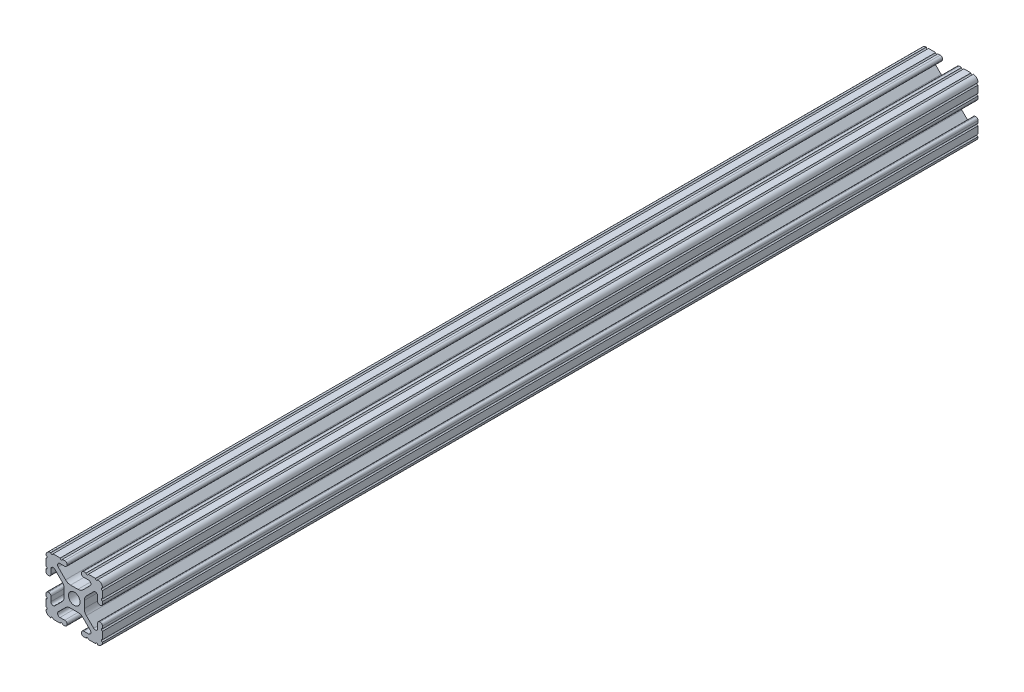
ISO-10303-21;
HEADER;
FILE_DESCRIPTION(('STEP AP214'),'2;1');
FILE_NAME('part.step','',(''),(''),'','','');
FILE_SCHEMA(('AUTOMOTIVE_DESIGN { 1 0 10303 214 1 1 1 1 }'));
ENDSEC;
DATA;
#1=APPLICATION_CONTEXT('core data for automotive mechanical design processes');
#2=APPLICATION_PROTOCOL_DEFINITION('international standard','automotive_design',2000,#1);
#3=PRODUCT_CONTEXT('',#1,'mechanical');
#4=PRODUCT('Part','Part','',(#3));
#5=PRODUCT_RELATED_PRODUCT_CATEGORY('part','',(#4));
#6=PRODUCT_DEFINITION_FORMATION('','',#4);
#7=PRODUCT_DEFINITION_CONTEXT('part definition',#1,'design');
#8=PRODUCT_DEFINITION('design','',#6,#7);
#9=PRODUCT_DEFINITION_SHAPE('','',#8);
#10=(LENGTH_UNIT() NAMED_UNIT(*) SI_UNIT(.MILLI.,.METRE.));
#11=(NAMED_UNIT(*) PLANE_ANGLE_UNIT() SI_UNIT($,.RADIAN.));
#12=(NAMED_UNIT(*) SI_UNIT($,.STERADIAN.) SOLID_ANGLE_UNIT());
#13=UNCERTAINTY_MEASURE_WITH_UNIT(LENGTH_MEASURE(1.E-05),#10,'distance_accuracy_value','');
#14=(GEOMETRIC_REPRESENTATION_CONTEXT(3) GLOBAL_UNCERTAINTY_ASSIGNED_CONTEXT((#13)) GLOBAL_UNIT_ASSIGNED_CONTEXT((#10,
#11,#12)) REPRESENTATION_CONTEXT('',''));
#15=CARTESIAN_POINT('',(0.,0.,0.));
#16=DIRECTION('',(0.,0.,1.));
#17=DIRECTION('',(1.,0.,0.));
#18=AXIS2_PLACEMENT_3D('',#15,#16,#17);
#19=CARTESIAN_POINT('',(-6.41640832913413,-9.40982735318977,196.85));
#20=DIRECTION('',(0.,0.,1.));
#21=DIRECTION('',(1.,0.,0.));
#22=AXIS2_PLACEMENT_3D('',#19,#20,#21);
#23=PLANE('',#22);
#24=CARTESIAN_POINT('',(-6.41640832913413,-9.40982735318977,196.85));
#25=DIRECTION('',(0.,0.,-1.));
#26=DIRECTION('',(1.,0.,0.));
#27=AXIS2_PLACEMENT_3D('',#24,#25,#26);
#28=CIRCLE('',#27,1.08037264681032);
#29=CARTESIAN_POINT('',(-6.41640832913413,-10.4902000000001,196.85));
#30=VERTEX_POINT('',#29);
#31=CARTESIAN_POINT('',(-7.17965049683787,-8.64519250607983,196.85));
#32=VERTEX_POINT('',#31);
#33=EDGE_CURVE('E849',#30,#32,#28,.T.);
#34=ORIENTED_EDGE('',*,*,#33,.T.);
#35=DIRECTION('',(0.707751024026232,0.706461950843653,0.));
#36=VECTOR('',#35,1.);
#37=CARTESIAN_POINT('',(-7.17965049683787,-8.64519250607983,196.85));
#38=LINE('',#37,#36);
#39=CARTESIAN_POINT('',(-3.95227025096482,-5.42369049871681,196.85));
#40=VERTEX_POINT('',#39);
#41=EDGE_CURVE('E357',#32,#40,#38,.T.);
#42=ORIENTED_EDGE('',*,*,#41,.T.);
#43=CARTESIAN_POINT('',(-1.70925355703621,-7.67080000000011,196.85));
#44=DIRECTION('',(0.,0.,-1.));
#45=DIRECTION('',(1.,0.,0.));
#46=AXIS2_PLACEMENT_3D('',#43,#44,#45);
#47=CIRCLE('',#46,3.17500000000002);
#48=CARTESIAN_POINT('',(-1.70925355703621,-4.49580000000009,196.85));
#49=VERTEX_POINT('',#48);
#50=EDGE_CURVE('E1128',#40,#49,#47,.T.);
#51=ORIENTED_EDGE('',*,*,#50,.T.);
#52=DIRECTION('',(1.,0.,0.));
#53=VECTOR('',#52,1.);
#54=CARTESIAN_POINT('',(-1.70925355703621,-4.49580000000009,196.85));
#55=LINE('',#54,#53);
#56=CARTESIAN_POINT('',(1.70925355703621,-4.49580000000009,196.85));
#57=VERTEX_POINT('',#56);
#58=EDGE_CURVE('E1147',#49,#57,#55,.T.);
#59=ORIENTED_EDGE('',*,*,#58,.T.);
#60=CARTESIAN_POINT('',(1.70925355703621,-7.67080000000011,196.85));
#61=DIRECTION('',(0.,0.,-1.));
#62=DIRECTION('',(1.,0.,0.));
#63=AXIS2_PLACEMENT_3D('',#60,#61,#62);
#64=CIRCLE('',#63,3.17500000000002);
#65=CARTESIAN_POINT('',(3.95227025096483,-5.42369049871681,196.85));
#66=VERTEX_POINT('',#65);
#67=EDGE_CURVE('E1144',#57,#66,#64,.T.);
#68=ORIENTED_EDGE('',*,*,#67,.T.);
#69=DIRECTION('',(0.707751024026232,-0.706461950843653,0.));
#70=VECTOR('',#69,1.);
#71=CARTESIAN_POINT('',(3.95227025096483,-5.42369049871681,196.85));
#72=LINE('',#71,#70);
#73=CARTESIAN_POINT('',(7.17965049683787,-8.64519250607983,196.85));
#74=VERTEX_POINT('',#73);
#75=EDGE_CURVE('E1146',#66,#74,#72,.T.);
#76=ORIENTED_EDGE('',*,*,#75,.T.);
#77=CARTESIAN_POINT('',(6.41640832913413,-9.40982735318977,196.85));
#78=DIRECTION('',(0.,0.,-1.));
#79=DIRECTION('',(1.,0.,0.));
#80=AXIS2_PLACEMENT_3D('',#77,#78,#79);
#81=CIRCLE('',#80,1.08037264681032);
#82=CARTESIAN_POINT('',(6.41640832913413,-10.4902000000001,196.85));
#83=VERTEX_POINT('',#82);
#84=EDGE_CURVE('E1149',#74,#83,#81,.T.);
#85=ORIENTED_EDGE('',*,*,#84,.T.);
#86=DIRECTION('',(-1.,0.,0.));
#87=VECTOR('',#86,1.);
#88=CARTESIAN_POINT('',(6.41640832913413,-10.4902000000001,196.85));
#89=LINE('',#88,#87);
#90=CARTESIAN_POINT('',(4.2875124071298,-10.4902000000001,196.85));
#91=VERTEX_POINT('',#90);
#92=EDGE_CURVE('E1155',#83,#91,#89,.T.);
#93=ORIENTED_EDGE('',*,*,#92,.T.);
#94=CARTESIAN_POINT('',(4.2875124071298,-11.5392124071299,196.85));
#95=DIRECTION('',(0.,0.,1.));
#96=DIRECTION('',(1.,0.,0.));
#97=AXIS2_PLACEMENT_3D('',#94,#95,#96);
#98=CIRCLE('',#97,1.04901240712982);
#99=CARTESIAN_POINT('',(3.23849999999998,-11.5392124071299,196.85));
#100=VERTEX_POINT('',#99);
#101=EDGE_CURVE('E1157',#91,#100,#98,.T.);
#102=ORIENTED_EDGE('',*,*,#101,.T.);
#103=DIRECTION('',(0.,-1.,0.));
#104=VECTOR('',#103,1.);
#105=CARTESIAN_POINT('',(3.23849999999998,-11.5392124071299,196.85));
#106=LINE('',#105,#104);
#107=CARTESIAN_POINT('',(3.23849999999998,-11.6509875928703,196.85));
#108=VERTEX_POINT('',#107);
#109=EDGE_CURVE('E1159',#100,#108,#106,.T.);
#110=ORIENTED_EDGE('',*,*,#109,.T.);
#111=CARTESIAN_POINT('',(4.2875124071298,-11.6509875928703,196.85));
#112=DIRECTION('',(0.,0.,1.));
#113=DIRECTION('',(1.,0.,0.));
#114=AXIS2_PLACEMENT_3D('',#111,#112,#113);
#115=CIRCLE('',#114,1.04901240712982);
#116=CARTESIAN_POINT('',(4.2875124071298,-12.7000000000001,196.85));
#117=VERTEX_POINT('',#116);
#118=EDGE_CURVE('E1161',#108,#117,#115,.T.);
#119=ORIENTED_EDGE('',*,*,#118,.T.);
#120=DIRECTION('',(1.,0.,0.));
#121=VECTOR('',#120,1.);
#122=CARTESIAN_POINT('',(4.2875124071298,-12.7000000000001,196.85));
#123=LINE('',#122,#121);
#124=CARTESIAN_POINT('',(5.31712671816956,-12.7000000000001,196.85));
#125=VERTEX_POINT('',#124);
#126=EDGE_CURVE('E1163',#117,#125,#123,.T.);
#127=ORIENTED_EDGE('',*,*,#126,.T.);
#128=CARTESIAN_POINT('',(5.82512671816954,-12.7000000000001,196.85));
#129=DIRECTION('',(0.,0.,-1.));
#130=DIRECTION('',(1.,0.,0.));
#131=AXIS2_PLACEMENT_3D('',#128,#129,#130);
#132=CIRCLE('',#131,0.507999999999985);
#133=CARTESIAN_POINT('',(6.33312671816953,-12.7000000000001,196.85));
#134=VERTEX_POINT('',#133);
#135=EDGE_CURVE('E1165',#125,#134,#132,.T.);
#136=ORIENTED_EDGE('',*,*,#135,.T.);
#137=DIRECTION('',(1.,0.,0.));
#138=VECTOR('',#137,1.);
#139=CARTESIAN_POINT('',(6.33312671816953,-12.7000000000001,196.85));
#140=LINE('',#139,#138);
#141=CARTESIAN_POINT('',(9.55044311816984,-12.7000000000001,196.85));
#142=VERTEX_POINT('',#141);
#143=EDGE_CURVE('E1167',#134,#142,#140,.T.);
#144=ORIENTED_EDGE('',*,*,#143,.T.);
#145=CARTESIAN_POINT('',(10.0584431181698,-12.7000000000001,196.85));
#146=DIRECTION('',(0.,0.,-1.));
#147=DIRECTION('',(1.,0.,0.));
#148=AXIS2_PLACEMENT_3D('',#145,#146,#147);
#149=CIRCLE('',#148,0.507999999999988);
#150=CARTESIAN_POINT('',(10.5664430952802,-12.6998475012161,196.85));
#151=VERTEX_POINT('',#150);
#152=EDGE_CURVE('E1169',#142,#151,#149,.T.);
#153=ORIENTED_EDGE('',*,*,#152,.T.);
#154=CARTESIAN_POINT('',(10.5918000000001,-10.5918000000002,196.85));
#155=DIRECTION('',(0.,0.,1.));
#156=DIRECTION('',(1.,0.,0.));
#157=AXIS2_PLACEMENT_3D('',#154,#155,#156);
#158=CIRCLE('',#157,2.1081999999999);
#159=CARTESIAN_POINT('',(12.699846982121,-10.5663999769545,196.85));
#160=VERTEX_POINT('',#159);
#161=EDGE_CURVE('E1171',#151,#160,#158,.T.);
#162=ORIENTED_EDGE('',*,*,#161,.T.);
#163=CARTESIAN_POINT('',(12.7,-10.0584000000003,196.85));
#164=DIRECTION('',(0.,0.,-1.));
#165=DIRECTION('',(1.,0.,0.));
#166=AXIS2_PLACEMENT_3D('',#163,#164,#165);
#167=CIRCLE('',#166,0.507999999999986);
#168=CARTESIAN_POINT('',(12.7,-9.5504000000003,196.85));
#169=VERTEX_POINT('',#168);
#170=EDGE_CURVE('E1173',#160,#169,#167,.T.);
#171=ORIENTED_EDGE('',*,*,#170,.T.);
#172=DIRECTION('',(0.,1.,0.));
#173=VECTOR('',#172,1.);
#174=CARTESIAN_POINT('',(12.7,-9.5504000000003,196.85));
#175=LINE('',#174,#173);
#176=CARTESIAN_POINT('',(12.7,-6.33308359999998,196.85));
#177=VERTEX_POINT('',#176);
#178=EDGE_CURVE('E1175',#169,#177,#175,.T.);
#179=ORIENTED_EDGE('',*,*,#178,.T.);
#180=CARTESIAN_POINT('',(12.7,-5.8250836,196.85));
#181=DIRECTION('',(0.,0.,-1.));
#182=DIRECTION('',(1.,0.,0.));
#183=AXIS2_PLACEMENT_3D('',#180,#181,#182);
#184=CIRCLE('',#183,0.507999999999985);
#185=CARTESIAN_POINT('',(12.7,-5.31708360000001,196.85));
#186=VERTEX_POINT('',#185);
#187=EDGE_CURVE('E1177',#177,#186,#184,.T.);
#188=ORIENTED_EDGE('',*,*,#187,.T.);
#189=DIRECTION('',(0.,1.,0.));
#190=VECTOR('',#189,1.);
#191=CARTESIAN_POINT('',(12.7,-5.31708360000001,196.85));
#192=LINE('',#191,#190);
#193=CARTESIAN_POINT('',(12.7,-4.28746928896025,196.85));
#194=VERTEX_POINT('',#193);
#195=EDGE_CURVE('E1179',#186,#194,#192,.T.);
#196=ORIENTED_EDGE('',*,*,#195,.T.);
#197=CARTESIAN_POINT('',(11.6509875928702,-4.28746928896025,196.85));
#198=DIRECTION('',(0.,0.,1.));
#199=DIRECTION('',(1.,0.,0.));
#200=AXIS2_PLACEMENT_3D('',#197,#198,#199);
#201=CIRCLE('',#200,1.04901240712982);
#202=CARTESIAN_POINT('',(11.6509875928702,-3.23845688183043,196.85));
#203=VERTEX_POINT('',#202);
#204=EDGE_CURVE('E1181',#194,#203,#201,.T.);
#205=ORIENTED_EDGE('',*,*,#204,.T.);
#206=DIRECTION('',(-1.,0.,0.));
#207=VECTOR('',#206,1.);
#208=CARTESIAN_POINT('',(11.6509875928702,-3.23845688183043,196.85));
#209=LINE('',#208,#207);
#210=CARTESIAN_POINT('',(11.5392124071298,-3.23845688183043,196.85));
#211=VERTEX_POINT('',#210);
#212=EDGE_CURVE('E1183',#203,#211,#209,.T.);
#213=ORIENTED_EDGE('',*,*,#212,.T.);
#214=CARTESIAN_POINT('',(11.5392124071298,-4.28746928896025,196.85));
#215=DIRECTION('',(0.,0.,1.));
#216=DIRECTION('',(1.,0.,0.));
#217=AXIS2_PLACEMENT_3D('',#214,#215,#216);
#218=CIRCLE('',#217,1.04901240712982);
#219=CARTESIAN_POINT('',(10.4902,-4.28746928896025,196.85));
#220=VERTEX_POINT('',#219);
#221=EDGE_CURVE('E1185',#211,#220,#218,.T.);
#222=ORIENTED_EDGE('',*,*,#221,.T.);
#223=DIRECTION('',(0.,-1.,0.));
#224=VECTOR('',#223,1.);
#225=CARTESIAN_POINT('',(10.4902,-4.28746928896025,196.85));
#226=LINE('',#225,#224);
#227=CARTESIAN_POINT('',(10.4902,-6.4020890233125,196.85));
#228=VERTEX_POINT('',#227);
#229=EDGE_CURVE('E1187',#220,#228,#226,.T.);
#230=ORIENTED_EDGE('',*,*,#229,.T.);
#231=CARTESIAN_POINT('',(9.4627890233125,-6.4020890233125,196.85));
#232=DIRECTION('',(0.,0.,-1.));
#233=DIRECTION('',(1.,0.,0.));
#234=AXIS2_PLACEMENT_3D('',#231,#232,#233);
#235=CIRCLE('',#234,1.0274109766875);
#236=CARTESIAN_POINT('',(8.7371313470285,-7.12940893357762,196.85));
#237=VERTEX_POINT('',#236);
#238=EDGE_CURVE('E1189',#228,#237,#235,.T.);
#239=ORIENTED_EDGE('',*,*,#238,.T.);
#240=DIRECTION('',(-0.70791526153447,0.706297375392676,0.));
#241=VECTOR('',#240,1.);
#242=CARTESIAN_POINT('',(8.7371313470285,-7.12940893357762,196.85));
#243=LINE('',#242,#241);
#244=CARTESIAN_POINT('',(5.44100583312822,-3.84081646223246,196.85));
#245=VERTEX_POINT('',#244);
#246=EDGE_CURVE('E1191',#237,#245,#243,.T.);
#247=ORIENTED_EDGE('',*,*,#246,.T.);
#248=CARTESIAN_POINT('',(7.68350000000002,-1.59318550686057,196.85));
#249=DIRECTION('',(0.,0.,-1.));
#250=DIRECTION('',(1.,0.,0.));
#251=AXIS2_PLACEMENT_3D('',#248,#249,#250);
#252=CIRCLE('',#251,3.17500000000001);
#253=CARTESIAN_POINT('',(4.50850000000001,-1.59318550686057,196.85));
#254=VERTEX_POINT('',#253);
#255=EDGE_CURVE('E1193',#245,#254,#252,.T.);
#256=ORIENTED_EDGE('',*,*,#255,.T.);
#257=DIRECTION('',(0.,1.,0.));
#258=VECTOR('',#257,1.);
#259=CARTESIAN_POINT('',(4.5085,-1.59318550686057,196.85));
#260=LINE('',#259,#258);
#261=CARTESIAN_POINT('',(4.50850000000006,1.59318550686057,196.85));
#262=VERTEX_POINT('',#261);
#263=EDGE_CURVE('E1195',#254,#262,#260,.T.);
#264=ORIENTED_EDGE('',*,*,#263,.T.);
#265=CARTESIAN_POINT('',(7.68350000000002,1.59318550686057,196.85));
#266=DIRECTION('',(0.,0.,-1.));
#267=DIRECTION('',(1.,0.,0.));
#268=AXIS2_PLACEMENT_3D('',#265,#266,#267);
#269=CIRCLE('',#268,3.17499999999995);
#270=CARTESIAN_POINT('',(5.44100583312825,3.84081646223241,196.85));
#271=VERTEX_POINT('',#270);
#272=EDGE_CURVE('E1197',#262,#271,#269,.T.);
#273=ORIENTED_EDGE('',*,*,#272,.T.);
#274=DIRECTION('',(0.70791526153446,0.706297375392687,0.));
#275=VECTOR('',#274,1.);
#276=CARTESIAN_POINT('',(5.44100583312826,3.8408164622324,196.85));
#277=LINE('',#276,#275);
#278=CARTESIAN_POINT('',(8.73713134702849,7.12940893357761,196.85));
#279=VERTEX_POINT('',#278);
#280=EDGE_CURVE('E1199',#271,#279,#277,.T.);
#281=ORIENTED_EDGE('',*,*,#280,.T.);
#282=CARTESIAN_POINT('',(9.4627890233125,6.4020890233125,196.85));
#283=DIRECTION('',(0.,0.,-1.));
#284=DIRECTION('',(1.,0.,0.));
#285=AXIS2_PLACEMENT_3D('',#282,#283,#284);
#286=CIRCLE('',#285,1.0274109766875);
#287=CARTESIAN_POINT('',(10.4902,6.4020890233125,196.85));
#288=VERTEX_POINT('',#287);
#289=EDGE_CURVE('E1201',#279,#288,#286,.T.);
#290=ORIENTED_EDGE('',*,*,#289,.T.);
#291=DIRECTION('',(0.,-1.,0.));
#292=VECTOR('',#291,1.);
#293=CARTESIAN_POINT('',(10.4902,6.4020890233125,196.85));
#294=LINE('',#293,#292);
#295=CARTESIAN_POINT('',(10.4902,4.28746928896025,196.85));
#296=VERTEX_POINT('',#295);
#297=EDGE_CURVE('E1203',#288,#296,#294,.T.);
#298=ORIENTED_EDGE('',*,*,#297,.T.);
#299=CARTESIAN_POINT('',(11.5392124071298,4.28746928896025,196.85));
#300=DIRECTION('',(0.,0.,1.));
#301=DIRECTION('',(1.,0.,0.));
#302=AXIS2_PLACEMENT_3D('',#299,#300,#301);
#303=CIRCLE('',#302,1.04901240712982);
#304=CARTESIAN_POINT('',(11.5392124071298,3.23845688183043,196.85));
#305=VERTEX_POINT('',#304);
#306=EDGE_CURVE('E1205',#296,#305,#303,.T.);
#307=ORIENTED_EDGE('',*,*,#306,.T.);
#308=DIRECTION('',(1.,0.,0.));
#309=VECTOR('',#308,1.);
#310=CARTESIAN_POINT('',(11.5392124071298,3.23845688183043,196.85));
#311=LINE('',#310,#309);
#312=CARTESIAN_POINT('',(11.6509875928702,3.23845688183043,196.85));
#313=VERTEX_POINT('',#312);
#314=EDGE_CURVE('E1207',#305,#313,#311,.T.);
#315=ORIENTED_EDGE('',*,*,#314,.T.);
#316=CARTESIAN_POINT('',(11.6509875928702,4.28746928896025,196.85));
#317=DIRECTION('',(0.,0.,1.));
#318=DIRECTION('',(1.,0.,0.));
#319=AXIS2_PLACEMENT_3D('',#316,#317,#318);
#320=CIRCLE('',#319,1.04901240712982);
#321=CARTESIAN_POINT('',(12.7,4.28746928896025,196.85));
#322=VERTEX_POINT('',#321);
#323=EDGE_CURVE('E1209',#313,#322,#320,.T.);
#324=ORIENTED_EDGE('',*,*,#323,.T.);
#325=DIRECTION('',(0.,1.,0.));
#326=VECTOR('',#325,1.);
#327=CARTESIAN_POINT('',(12.7,4.28746928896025,196.85));
#328=LINE('',#327,#326);
#329=CARTESIAN_POINT('',(12.7,5.31708360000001,196.85));
#330=VERTEX_POINT('',#329);
#331=EDGE_CURVE('E1211',#322,#330,#328,.T.);
#332=ORIENTED_EDGE('',*,*,#331,.T.);
#333=CARTESIAN_POINT('',(12.7,5.8250836,196.85));
#334=DIRECTION('',(0.,0.,-1.));
#335=DIRECTION('',(1.,0.,0.));
#336=AXIS2_PLACEMENT_3D('',#333,#334,#335);
#337=CIRCLE('',#336,0.507999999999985);
#338=CARTESIAN_POINT('',(12.7,6.33308359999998,196.85));
#339=VERTEX_POINT('',#338);
#340=EDGE_CURVE('E1213',#330,#339,#337,.T.);
#341=ORIENTED_EDGE('',*,*,#340,.T.);
#342=DIRECTION('',(0.,1.,0.));
#343=VECTOR('',#342,1.);
#344=CARTESIAN_POINT('',(12.7,6.33308359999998,196.85));
#345=LINE('',#344,#343);
#346=CARTESIAN_POINT('',(12.7,9.55040000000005,196.85));
#347=VERTEX_POINT('',#346);
#348=EDGE_CURVE('E1215',#339,#347,#345,.T.);
#349=ORIENTED_EDGE('',*,*,#348,.T.);
#350=CARTESIAN_POINT('',(12.7,10.0584000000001,196.85));
#351=DIRECTION('',(0.,0.,-1.));
#352=DIRECTION('',(1.,0.,0.));
#353=AXIS2_PLACEMENT_3D('',#350,#351,#352);
#354=CIRCLE('',#353,0.508000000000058);
#355=CARTESIAN_POINT('',(12.699846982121,10.5663999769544,196.85));
#356=VERTEX_POINT('',#355);
#357=EDGE_CURVE('E1217',#347,#356,#354,.T.);
#358=ORIENTED_EDGE('',*,*,#357,.T.);
#359=CARTESIAN_POINT('',(10.5918000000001,10.5918000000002,196.85));
#360=DIRECTION('',(0.,0.,1.));
#361=DIRECTION('',(1.,0.,0.));
#362=AXIS2_PLACEMENT_3D('',#359,#360,#361);
#363=CIRCLE('',#362,2.1081999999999);
#364=CARTESIAN_POINT('',(10.5664430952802,12.6998475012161,196.85));
#365=VERTEX_POINT('',#364);
#366=EDGE_CURVE('E1219',#356,#365,#363,.T.);
#367=ORIENTED_EDGE('',*,*,#366,.T.);
#368=CARTESIAN_POINT('',(10.0584431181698,12.7000000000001,196.85));
#369=DIRECTION('',(0.,0.,-1.));
#370=DIRECTION('',(1.,0.,0.));
#371=AXIS2_PLACEMENT_3D('',#368,#369,#370);
#372=CIRCLE('',#371,0.507999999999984);
#373=CARTESIAN_POINT('',(9.55044311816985,12.7000000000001,196.85));
#374=VERTEX_POINT('',#373);
#375=EDGE_CURVE('E1221',#365,#374,#372,.T.);
#376=ORIENTED_EDGE('',*,*,#375,.T.);
#377=DIRECTION('',(-1.,0.,0.));
#378=VECTOR('',#377,1.);
#379=CARTESIAN_POINT('',(9.55044311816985,12.7000000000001,196.85));
#380=LINE('',#379,#378);
#381=CARTESIAN_POINT('',(6.33312671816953,12.7000000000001,196.85));
#382=VERTEX_POINT('',#381);
#383=EDGE_CURVE('E1223',#374,#382,#380,.T.);
#384=ORIENTED_EDGE('',*,*,#383,.T.);
#385=CARTESIAN_POINT('',(5.82512671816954,12.7000000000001,196.85));
#386=DIRECTION('',(0.,0.,-1.));
#387=DIRECTION('',(1.,0.,0.));
#388=AXIS2_PLACEMENT_3D('',#385,#386,#387);
#389=CIRCLE('',#388,0.507999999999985);
#390=CARTESIAN_POINT('',(5.31712671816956,12.7000000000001,196.85));
#391=VERTEX_POINT('',#390);
#392=EDGE_CURVE('E1225',#382,#391,#389,.T.);
#393=ORIENTED_EDGE('',*,*,#392,.T.);
#394=DIRECTION('',(-1.,0.,0.));
#395=VECTOR('',#394,1.);
#396=CARTESIAN_POINT('',(5.31712671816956,12.7000000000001,196.85));
#397=LINE('',#396,#395);
#398=CARTESIAN_POINT('',(4.2875124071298,12.7000000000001,196.85));
#399=VERTEX_POINT('',#398);
#400=EDGE_CURVE('E1227',#391,#399,#397,.T.);
#401=ORIENTED_EDGE('',*,*,#400,.T.);
#402=CARTESIAN_POINT('',(4.2875124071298,11.6509875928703,196.85));
#403=DIRECTION('',(0.,0.,1.));
#404=DIRECTION('',(1.,0.,0.));
#405=AXIS2_PLACEMENT_3D('',#402,#403,#404);
#406=CIRCLE('',#405,1.04901240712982);
#407=CARTESIAN_POINT('',(3.23849999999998,11.6509875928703,196.85));
#408=VERTEX_POINT('',#407);
#409=EDGE_CURVE('E1229',#399,#408,#406,.T.);
#410=ORIENTED_EDGE('',*,*,#409,.T.);
#411=DIRECTION('',(0.,-1.,0.));
#412=VECTOR('',#411,1.);
#413=CARTESIAN_POINT('',(3.23849999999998,11.6509875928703,196.85));
#414=LINE('',#413,#412);
#415=CARTESIAN_POINT('',(3.23849999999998,11.5392124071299,196.85));
#416=VERTEX_POINT('',#415);
#417=EDGE_CURVE('E1231',#408,#416,#414,.T.);
#418=ORIENTED_EDGE('',*,*,#417,.T.);
#419=CARTESIAN_POINT('',(4.2875124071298,11.5392124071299,196.85));
#420=DIRECTION('',(0.,0.,1.));
#421=DIRECTION('',(1.,0.,0.));
#422=AXIS2_PLACEMENT_3D('',#419,#420,#421);
#423=CIRCLE('',#422,1.04901240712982);
#424=CARTESIAN_POINT('',(4.2875124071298,10.4902000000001,196.85));
#425=VERTEX_POINT('',#424);
#426=EDGE_CURVE('E1233',#416,#425,#423,.T.);
#427=ORIENTED_EDGE('',*,*,#426,.T.);
#428=DIRECTION('',(1.,0.,0.));
#429=VECTOR('',#428,1.);
#430=CARTESIAN_POINT('',(4.2875124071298,10.4902000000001,196.85));
#431=LINE('',#430,#429);
#432=CARTESIAN_POINT('',(6.47678859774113,10.4902000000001,196.85));
#433=VERTEX_POINT('',#432);
#434=EDGE_CURVE('E1235',#425,#433,#431,.T.);
#435=ORIENTED_EDGE('',*,*,#434,.T.);
#436=CARTESIAN_POINT('',(6.47678859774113,9.45629072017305,196.85));
#437=DIRECTION('',(0.,0.,-1.));
#438=DIRECTION('',(1.,0.,0.));
#439=AXIS2_PLACEMENT_3D('',#436,#437,#438);
#440=CIRCLE('',#439,1.03390927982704);
#441=CARTESIAN_POINT('',(7.2070360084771,8.72437056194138,196.85));
#442=VERTEX_POINT('',#441);
#443=EDGE_CURVE('E1237',#433,#442,#440,.T.);
#444=ORIENTED_EDGE('',*,*,#443,.T.);
#445=DIRECTION('',(-0.707915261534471,-0.706297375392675,0.));
#446=VECTOR('',#445,1.);
#447=CARTESIAN_POINT('',(7.2070360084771,8.72437056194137,196.85));
#448=LINE('',#447,#446);
#449=CARTESIAN_POINT('',(3.89827256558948,5.42316904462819,196.85));
#450=VERTEX_POINT('',#449);
#451=EDGE_CURVE('E1239',#442,#450,#448,.T.);
#452=ORIENTED_EDGE('',*,*,#451,.T.);
#453=CARTESIAN_POINT('',(1.65577839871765,7.67080000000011,196.85));
#454=DIRECTION('',(0.,0.,-1.));
#455=DIRECTION('',(1.,0.,0.));
#456=AXIS2_PLACEMENT_3D('',#453,#454,#455);
#457=CIRCLE('',#456,3.17500000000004);
#458=CARTESIAN_POINT('',(1.65577839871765,4.49580000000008,196.85));
#459=VERTEX_POINT('',#458);
#460=EDGE_CURVE('E1241',#450,#459,#457,.T.);
#461=ORIENTED_EDGE('',*,*,#460,.T.);
#462=DIRECTION('',(-1.,0.,0.));
#463=VECTOR('',#462,1.);
#464=CARTESIAN_POINT('',(1.65577839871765,4.49580000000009,196.85));
#465=LINE('',#464,#463);
#466=CARTESIAN_POINT('',(-1.65577839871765,4.49580000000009,196.85));
#467=VERTEX_POINT('',#466);
#468=EDGE_CURVE('E1243',#459,#467,#465,.T.);
#469=ORIENTED_EDGE('',*,*,#468,.T.);
#470=CARTESIAN_POINT('',(-1.65577839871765,7.67080000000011,196.85));
#471=DIRECTION('',(0.,0.,-1.));
#472=DIRECTION('',(1.,0.,0.));
#473=AXIS2_PLACEMENT_3D('',#470,#471,#472);
#474=CIRCLE('',#473,3.17500000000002);
#475=CARTESIAN_POINT('',(-3.89827256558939,5.42316904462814,196.85));
#476=VERTEX_POINT('',#475);
#477=EDGE_CURVE('E1245',#467,#476,#474,.T.);
#478=ORIENTED_EDGE('',*,*,#477,.T.);
#479=DIRECTION('',(-0.707915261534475,0.706297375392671,0.));
#480=VECTOR('',#479,1.);
#481=CARTESIAN_POINT('',(-3.89827256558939,5.42316904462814,196.85));
#482=LINE('',#481,#480);
#483=CARTESIAN_POINT('',(-7.20703600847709,8.72437056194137,196.85));
#484=VERTEX_POINT('',#483);
#485=EDGE_CURVE('E1247',#476,#484,#482,.T.);
#486=ORIENTED_EDGE('',*,*,#485,.T.);
#487=CARTESIAN_POINT('',(-6.47678859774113,9.45629072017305,196.85));
#488=DIRECTION('',(0.,0.,-1.));
#489=DIRECTION('',(1.,0.,0.));
#490=AXIS2_PLACEMENT_3D('',#487,#488,#489);
#491=CIRCLE('',#490,1.03390927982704);
#492=CARTESIAN_POINT('',(-6.47678859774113,10.4902000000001,196.85));
#493=VERTEX_POINT('',#492);
#494=EDGE_CURVE('E1249',#484,#493,#491,.T.);
#495=ORIENTED_EDGE('',*,*,#494,.T.);
#496=DIRECTION('',(1.,0.,0.));
#497=VECTOR('',#496,1.);
#498=CARTESIAN_POINT('',(-6.47678859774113,10.4902000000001,196.85));
#499=LINE('',#498,#497);
#500=CARTESIAN_POINT('',(-4.2875124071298,10.4902000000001,196.85));
#501=VERTEX_POINT('',#500);
#502=EDGE_CURVE('E1251',#493,#501,#499,.T.);
#503=ORIENTED_EDGE('',*,*,#502,.T.);
#504=CARTESIAN_POINT('',(-4.2875124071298,11.5392124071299,196.85));
#505=DIRECTION('',(0.,0.,1.));
#506=DIRECTION('',(1.,0.,0.));
#507=AXIS2_PLACEMENT_3D('',#504,#505,#506);
#508=CIRCLE('',#507,1.04901240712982);
#509=CARTESIAN_POINT('',(-3.23849999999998,11.5392124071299,196.85));
#510=VERTEX_POINT('',#509);
#511=EDGE_CURVE('E1253',#501,#510,#508,.T.);
#512=ORIENTED_EDGE('',*,*,#511,.T.);
#513=DIRECTION('',(0.,1.,0.));
#514=VECTOR('',#513,1.);
#515=CARTESIAN_POINT('',(-3.23849999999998,11.5392124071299,196.85));
#516=LINE('',#515,#514);
#517=CARTESIAN_POINT('',(-3.23849999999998,11.6509875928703,196.85));
#518=VERTEX_POINT('',#517);
#519=EDGE_CURVE('E1255',#510,#518,#516,.T.);
#520=ORIENTED_EDGE('',*,*,#519,.T.);
#521=CARTESIAN_POINT('',(-4.2875124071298,11.6509875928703,196.85));
#522=DIRECTION('',(0.,0.,1.));
#523=DIRECTION('',(1.,0.,0.));
#524=AXIS2_PLACEMENT_3D('',#521,#522,#523);
#525=CIRCLE('',#524,1.04901240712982);
#526=CARTESIAN_POINT('',(-4.2875124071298,12.7000000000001,196.85));
#527=VERTEX_POINT('',#526);
#528=EDGE_CURVE('E1257',#518,#527,#525,.T.);
#529=ORIENTED_EDGE('',*,*,#528,.T.);
#530=DIRECTION('',(-1.,0.,0.));
#531=VECTOR('',#530,1.);
#532=CARTESIAN_POINT('',(-4.2875124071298,12.7000000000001,196.85));
#533=LINE('',#532,#531);
#534=CARTESIAN_POINT('',(-5.31712671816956,12.7000000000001,196.85));
#535=VERTEX_POINT('',#534);
#536=EDGE_CURVE('E1259',#527,#535,#533,.T.);
#537=ORIENTED_EDGE('',*,*,#536,.T.);
#538=CARTESIAN_POINT('',(-5.82512671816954,12.7000000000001,196.85));
#539=DIRECTION('',(0.,0.,-1.));
#540=DIRECTION('',(1.,0.,0.));
#541=AXIS2_PLACEMENT_3D('',#538,#539,#540);
#542=CIRCLE('',#541,0.507999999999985);
#543=CARTESIAN_POINT('',(-6.33312671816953,12.7000000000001,196.85));
#544=VERTEX_POINT('',#543);
#545=EDGE_CURVE('E1261',#535,#544,#542,.T.);
#546=ORIENTED_EDGE('',*,*,#545,.T.);
#547=DIRECTION('',(-1.,0.,0.));
#548=VECTOR('',#547,1.);
#549=CARTESIAN_POINT('',(-6.33312671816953,12.7000000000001,196.85));
#550=LINE('',#549,#548);
#551=CARTESIAN_POINT('',(-9.55044311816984,12.7000000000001,196.85));
#552=VERTEX_POINT('',#551);
#553=EDGE_CURVE('E1263',#544,#552,#550,.T.);
#554=ORIENTED_EDGE('',*,*,#553,.T.);
#555=CARTESIAN_POINT('',(-10.0584431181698,12.7000000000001,196.85));
#556=DIRECTION('',(0.,0.,-1.));
#557=DIRECTION('',(1.,0.,0.));
#558=AXIS2_PLACEMENT_3D('',#555,#556,#557);
#559=CIRCLE('',#558,0.507999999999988);
#560=CARTESIAN_POINT('',(-10.5664430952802,12.6998475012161,196.85));
#561=VERTEX_POINT('',#560);
#562=EDGE_CURVE('E1265',#552,#561,#559,.T.);
#563=ORIENTED_EDGE('',*,*,#562,.T.);
#564=CARTESIAN_POINT('',(-10.5918000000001,10.5918000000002,196.85));
#565=DIRECTION('',(0.,0.,1.));
#566=DIRECTION('',(1.,0.,0.));
#567=AXIS2_PLACEMENT_3D('',#564,#565,#566);
#568=CIRCLE('',#567,2.1081999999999);
#569=CARTESIAN_POINT('',(-12.699846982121,10.5663999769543,196.85));
#570=VERTEX_POINT('',#569);
#571=EDGE_CURVE('E1267',#561,#570,#568,.T.);
#572=ORIENTED_EDGE('',*,*,#571,.T.);
#573=CARTESIAN_POINT('',(-12.7,10.0584000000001,196.85));
#574=DIRECTION('',(0.,0.,-1.));
#575=DIRECTION('',(1.,0.,0.));
#576=AXIS2_PLACEMENT_3D('',#573,#574,#575);
#577=CIRCLE('',#576,0.50799999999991);
#578=CARTESIAN_POINT('',(-12.7,9.55040000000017,196.85));
#579=VERTEX_POINT('',#578);
#580=EDGE_CURVE('E1269',#570,#579,#577,.T.);
#581=ORIENTED_EDGE('',*,*,#580,.T.);
#582=DIRECTION('',(0.,-1.,0.));
#583=VECTOR('',#582,1.);
#584=CARTESIAN_POINT('',(-12.7,9.5504000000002,196.85));
#585=LINE('',#584,#583);
#586=CARTESIAN_POINT('',(-12.7,6.33308359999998,196.85));
#587=VERTEX_POINT('',#586);
#588=EDGE_CURVE('E1271',#579,#587,#585,.T.);
#589=ORIENTED_EDGE('',*,*,#588,.T.);
#590=CARTESIAN_POINT('',(-12.7,5.8250836,196.85));
#591=DIRECTION('',(0.,0.,-1.));
#592=DIRECTION('',(1.,0.,0.));
#593=AXIS2_PLACEMENT_3D('',#590,#591,#592);
#594=CIRCLE('',#593,0.507999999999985);
#595=CARTESIAN_POINT('',(-12.7,5.31708360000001,196.85));
#596=VERTEX_POINT('',#595);
#597=EDGE_CURVE('E1273',#587,#596,#594,.T.);
#598=ORIENTED_EDGE('',*,*,#597,.T.);
#599=DIRECTION('',(0.,-1.,0.));
#600=VECTOR('',#599,1.);
#601=CARTESIAN_POINT('',(-12.7,5.31708360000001,196.85));
#602=LINE('',#601,#600);
#603=CARTESIAN_POINT('',(-12.7,4.28746928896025,196.85));
#604=VERTEX_POINT('',#603);
#605=EDGE_CURVE('E1275',#596,#604,#602,.T.);
#606=ORIENTED_EDGE('',*,*,#605,.T.);
#607=CARTESIAN_POINT('',(-11.6509875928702,4.28746928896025,196.85));
#608=DIRECTION('',(0.,0.,1.));
#609=DIRECTION('',(1.,0.,0.));
#610=AXIS2_PLACEMENT_3D('',#607,#608,#609);
#611=CIRCLE('',#610,1.04901240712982);
#612=CARTESIAN_POINT('',(-11.6509875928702,3.23845688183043,196.85));
#613=VERTEX_POINT('',#612);
#614=EDGE_CURVE('E1277',#604,#613,#611,.T.);
#615=ORIENTED_EDGE('',*,*,#614,.T.);
#616=DIRECTION('',(1.,0.,0.));
#617=VECTOR('',#616,1.);
#618=CARTESIAN_POINT('',(-11.6509875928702,3.23845688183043,196.85));
#619=LINE('',#618,#617);
#620=CARTESIAN_POINT('',(-11.5392124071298,3.23845688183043,196.85));
#621=VERTEX_POINT('',#620);
#622=EDGE_CURVE('E1279',#613,#621,#619,.T.);
#623=ORIENTED_EDGE('',*,*,#622,.T.);
#624=CARTESIAN_POINT('',(-11.5392124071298,4.28746928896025,196.85));
#625=DIRECTION('',(0.,0.,1.));
#626=DIRECTION('',(1.,0.,0.));
#627=AXIS2_PLACEMENT_3D('',#624,#625,#626);
#628=CIRCLE('',#627,1.04901240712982);
#629=CARTESIAN_POINT('',(-10.4902,4.28746928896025,196.85));
#630=VERTEX_POINT('',#629);
#631=EDGE_CURVE('E1281',#621,#630,#628,.T.);
#632=ORIENTED_EDGE('',*,*,#631,.T.);
#633=DIRECTION('',(0.,1.,0.));
#634=VECTOR('',#633,1.);
#635=CARTESIAN_POINT('',(-10.4902,4.28746928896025,196.85));
#636=LINE('',#635,#634);
#637=CARTESIAN_POINT('',(-10.4902,6.4020890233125,196.85));
#638=VERTEX_POINT('',#637);
#639=EDGE_CURVE('E1283',#630,#638,#636,.T.);
#640=ORIENTED_EDGE('',*,*,#639,.T.);
#641=CARTESIAN_POINT('',(-9.4627890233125,6.4020890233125,196.85));
#642=DIRECTION('',(0.,0.,-1.));
#643=DIRECTION('',(1.,0.,0.));
#644=AXIS2_PLACEMENT_3D('',#641,#642,#643);
#645=CIRCLE('',#644,1.0274109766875);
#646=CARTESIAN_POINT('',(-8.73713134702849,7.12940893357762,196.85));
#647=VERTEX_POINT('',#646);
#648=EDGE_CURVE('E1285',#638,#647,#645,.T.);
#649=ORIENTED_EDGE('',*,*,#648,.T.);
#650=DIRECTION('',(0.707915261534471,-0.706297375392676,0.));
#651=VECTOR('',#650,1.);
#652=CARTESIAN_POINT('',(-8.73713134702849,7.12940893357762,196.85));
#653=LINE('',#652,#651);
#654=CARTESIAN_POINT('',(-5.44100583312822,3.84081646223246,196.85));
#655=VERTEX_POINT('',#654);
#656=EDGE_CURVE('E1287',#647,#655,#653,.T.);
#657=ORIENTED_EDGE('',*,*,#656,.T.);
#658=CARTESIAN_POINT('',(-7.68350000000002,1.59318550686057,196.85));
#659=DIRECTION('',(0.,0.,-1.));
#660=DIRECTION('',(1.,0.,0.));
#661=AXIS2_PLACEMENT_3D('',#658,#659,#660);
#662=CIRCLE('',#661,3.17500000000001);
#663=CARTESIAN_POINT('',(-4.50850000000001,1.59318550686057,196.85));
#664=VERTEX_POINT('',#663);
#665=EDGE_CURVE('E1289',#655,#664,#662,.T.);
#666=ORIENTED_EDGE('',*,*,#665,.T.);
#667=DIRECTION('',(0.,-1.,0.));
#668=VECTOR('',#667,1.);
#669=CARTESIAN_POINT('',(-4.5085,1.59318550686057,196.85));
#670=LINE('',#669,#668);
#671=CARTESIAN_POINT('',(-4.5085,-1.59318550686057,196.85));
#672=VERTEX_POINT('',#671);
#673=EDGE_CURVE('E1291',#664,#672,#670,.T.);
#674=ORIENTED_EDGE('',*,*,#673,.T.);
#675=CARTESIAN_POINT('',(-7.68350000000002,-1.59318550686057,196.85));
#676=DIRECTION('',(0.,0.,-1.));
#677=DIRECTION('',(1.,0.,0.));
#678=AXIS2_PLACEMENT_3D('',#675,#676,#677);
#679=CIRCLE('',#678,3.17500000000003);
#680=CARTESIAN_POINT('',(-5.44100583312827,-3.84081646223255,196.85));
#681=VERTEX_POINT('',#680);
#682=EDGE_CURVE('E1293',#672,#681,#679,.T.);
#683=ORIENTED_EDGE('',*,*,#682,.T.);
#684=DIRECTION('',(-0.707915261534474,-0.706297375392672,0.));
#685=VECTOR('',#684,1.);
#686=CARTESIAN_POINT('',(-5.44100583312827,-3.84081646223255,196.85));
#687=LINE('',#686,#685);
#688=CARTESIAN_POINT('',(-8.7371313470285,-7.12940893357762,196.85));
#689=VERTEX_POINT('',#688);
#690=EDGE_CURVE('E1295',#681,#689,#687,.T.);
#691=ORIENTED_EDGE('',*,*,#690,.T.);
#692=CARTESIAN_POINT('',(-9.4627890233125,-6.4020890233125,196.85));
#693=DIRECTION('',(0.,0.,-1.));
#694=DIRECTION('',(1.,0.,0.));
#695=AXIS2_PLACEMENT_3D('',#692,#693,#694);
#696=CIRCLE('',#695,1.0274109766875);
#697=CARTESIAN_POINT('',(-10.4902,-6.4020890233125,196.85));
#698=VERTEX_POINT('',#697);
#699=EDGE_CURVE('E1297',#689,#698,#696,.T.);
#700=ORIENTED_EDGE('',*,*,#699,.T.);
#701=DIRECTION('',(0.,1.,0.));
#702=VECTOR('',#701,1.);
#703=CARTESIAN_POINT('',(-10.4902,-6.4020890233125,196.85));
#704=LINE('',#703,#702);
#705=CARTESIAN_POINT('',(-10.4902,-4.28746928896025,196.85));
#706=VERTEX_POINT('',#705);
#707=EDGE_CURVE('E1299',#698,#706,#704,.T.);
#708=ORIENTED_EDGE('',*,*,#707,.T.);
#709=CARTESIAN_POINT('',(-11.5392124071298,-4.28746928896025,196.85));
#710=DIRECTION('',(0.,0.,1.));
#711=DIRECTION('',(1.,0.,0.));
#712=AXIS2_PLACEMENT_3D('',#709,#710,#711);
#713=CIRCLE('',#712,1.04901240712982);
#714=CARTESIAN_POINT('',(-11.5392124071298,-3.23845688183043,196.85));
#715=VERTEX_POINT('',#714);
#716=EDGE_CURVE('E1301',#706,#715,#713,.T.);
#717=ORIENTED_EDGE('',*,*,#716,.T.);
#718=DIRECTION('',(-1.,0.,0.));
#719=VECTOR('',#718,1.);
#720=CARTESIAN_POINT('',(-11.5392124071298,-3.23845688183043,196.85));
#721=LINE('',#720,#719);
#722=CARTESIAN_POINT('',(-11.6509875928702,-3.23845688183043,196.85));
#723=VERTEX_POINT('',#722);
#724=EDGE_CURVE('E1303',#715,#723,#721,.T.);
#725=ORIENTED_EDGE('',*,*,#724,.T.);
#726=CARTESIAN_POINT('',(-11.6509875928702,-4.28746928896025,196.85));
#727=DIRECTION('',(0.,0.,1.));
#728=DIRECTION('',(1.,0.,0.));
#729=AXIS2_PLACEMENT_3D('',#726,#727,#728);
#730=CIRCLE('',#729,1.04901240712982);
#731=CARTESIAN_POINT('',(-12.7,-4.28746928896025,196.85));
#732=VERTEX_POINT('',#731);
#733=EDGE_CURVE('E1305',#723,#732,#730,.T.);
#734=ORIENTED_EDGE('',*,*,#733,.T.);
#735=DIRECTION('',(0.,-1.,0.));
#736=VECTOR('',#735,1.);
#737=CARTESIAN_POINT('',(-12.7,-4.28746928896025,196.85));
#738=LINE('',#737,#736);
#739=CARTESIAN_POINT('',(-12.7,-5.31708360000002,196.85));
#740=VERTEX_POINT('',#739);
#741=EDGE_CURVE('E1307',#732,#740,#738,.T.);
#742=ORIENTED_EDGE('',*,*,#741,.T.);
#743=CARTESIAN_POINT('',(-12.7,-5.8250836,196.85));
#744=DIRECTION('',(0.,0.,-1.));
#745=DIRECTION('',(1.,0.,0.));
#746=AXIS2_PLACEMENT_3D('',#743,#744,#745);
#747=CIRCLE('',#746,0.507999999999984);
#748=CARTESIAN_POINT('',(-12.7,-6.33308359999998,196.85));
#749=VERTEX_POINT('',#748);
#750=EDGE_CURVE('E1309',#740,#749,#747,.T.);
#751=ORIENTED_EDGE('',*,*,#750,.T.);
#752=DIRECTION('',(0.,-1.,0.));
#753=VECTOR('',#752,1.);
#754=CARTESIAN_POINT('',(-12.7,-6.33308359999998,196.85));
#755=LINE('',#754,#753);
#756=CARTESIAN_POINT('',(-12.7,-9.5504000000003,196.85));
#757=VERTEX_POINT('',#756);
#758=EDGE_CURVE('E1311',#749,#757,#755,.T.);
#759=ORIENTED_EDGE('',*,*,#758,.T.);
#760=CARTESIAN_POINT('',(-12.7,-10.0584000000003,196.85));
#761=DIRECTION('',(0.,0.,-1.));
#762=DIRECTION('',(1.,0.,0.));
#763=AXIS2_PLACEMENT_3D('',#760,#761,#762);
#764=CIRCLE('',#763,0.507999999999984);
#765=CARTESIAN_POINT('',(-12.699846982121,-10.5663999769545,196.85));
#766=VERTEX_POINT('',#765);
#767=EDGE_CURVE('E1313',#757,#766,#764,.T.);
#768=ORIENTED_EDGE('',*,*,#767,.T.);
#769=CARTESIAN_POINT('',(-10.5918000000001,-10.5918000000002,196.85));
#770=DIRECTION('',(0.,0.,1.));
#771=DIRECTION('',(1.,0.,0.));
#772=AXIS2_PLACEMENT_3D('',#769,#770,#771);
#773=CIRCLE('',#772,2.1081999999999);
#774=CARTESIAN_POINT('',(-10.5664430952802,-12.6998475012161,196.85));
#775=VERTEX_POINT('',#774);
#776=EDGE_CURVE('E1315',#766,#775,#773,.T.);
#777=ORIENTED_EDGE('',*,*,#776,.T.);
#778=CARTESIAN_POINT('',(-10.0584431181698,-12.7000000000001,196.85));
#779=DIRECTION('',(0.,0.,-1.));
#780=DIRECTION('',(1.,0.,0.));
#781=AXIS2_PLACEMENT_3D('',#778,#779,#780);
#782=CIRCLE('',#781,0.507999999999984);
#783=CARTESIAN_POINT('',(-9.55044311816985,-12.7000000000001,196.85));
#784=VERTEX_POINT('',#783);
#785=EDGE_CURVE('E1317',#775,#784,#782,.T.);
#786=ORIENTED_EDGE('',*,*,#785,.T.);
#787=DIRECTION('',(1.,0.,0.));
#788=VECTOR('',#787,1.);
#789=CARTESIAN_POINT('',(-9.55044311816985,-12.7000000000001,196.85));
#790=LINE('',#789,#788);
#791=CARTESIAN_POINT('',(-6.33312671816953,-12.7000000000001,196.85));
#792=VERTEX_POINT('',#791);
#793=EDGE_CURVE('E1319',#784,#792,#790,.T.);
#794=ORIENTED_EDGE('',*,*,#793,.T.);
#795=CARTESIAN_POINT('',(-5.82512671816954,-12.7000000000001,196.85));
#796=DIRECTION('',(0.,0.,-1.));
#797=DIRECTION('',(1.,0.,0.));
#798=AXIS2_PLACEMENT_3D('',#795,#796,#797);
#799=CIRCLE('',#798,0.507999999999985);
#800=CARTESIAN_POINT('',(-5.31712671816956,-12.7000000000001,196.85));
#801=VERTEX_POINT('',#800);
#802=EDGE_CURVE('E1321',#792,#801,#799,.T.);
#803=ORIENTED_EDGE('',*,*,#802,.T.);
#804=DIRECTION('',(1.,0.,0.));
#805=VECTOR('',#804,1.);
#806=CARTESIAN_POINT('',(-5.31712671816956,-12.7000000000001,196.85));
#807=LINE('',#806,#805);
#808=CARTESIAN_POINT('',(-4.2875124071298,-12.7000000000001,196.85));
#809=VERTEX_POINT('',#808);
#810=EDGE_CURVE('E1323',#801,#809,#807,.T.);
#811=ORIENTED_EDGE('',*,*,#810,.T.);
#812=CARTESIAN_POINT('',(-4.2875124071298,-11.6509875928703,196.85));
#813=DIRECTION('',(0.,0.,1.));
#814=DIRECTION('',(1.,0.,0.));
#815=AXIS2_PLACEMENT_3D('',#812,#813,#814);
#816=CIRCLE('',#815,1.04901240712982);
#817=CARTESIAN_POINT('',(-3.23849999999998,-11.6509875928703,196.85));
#818=VERTEX_POINT('',#817);
#819=EDGE_CURVE('E640',#809,#818,#816,.T.);
#820=ORIENTED_EDGE('',*,*,#819,.T.);
#821=DIRECTION('',(0.,1.,0.));
#822=VECTOR('',#821,1.);
#823=CARTESIAN_POINT('',(-3.23849999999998,-11.6509875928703,196.85));
#824=LINE('',#823,#822);
#825=CARTESIAN_POINT('',(-3.23849999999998,-11.5392124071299,196.85));
#826=VERTEX_POINT('',#825);
#827=EDGE_CURVE('E634',#818,#826,#824,.T.);
#828=ORIENTED_EDGE('',*,*,#827,.T.);
#829=CARTESIAN_POINT('',(-4.2875124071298,-11.5392124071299,196.85));
#830=DIRECTION('',(0.,0.,1.));
#831=DIRECTION('',(1.,0.,0.));
#832=AXIS2_PLACEMENT_3D('',#829,#830,#831);
#833=CIRCLE('',#832,1.04901240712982);
#834=CARTESIAN_POINT('',(-4.2875124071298,-10.4902000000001,196.85));
#835=VERTEX_POINT('',#834);
#836=EDGE_CURVE('E638',#826,#835,#833,.T.);
#837=ORIENTED_EDGE('',*,*,#836,.T.);
#838=DIRECTION('',(-1.,0.,0.));
#839=VECTOR('',#838,1.);
#840=CARTESIAN_POINT('',(-4.2875124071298,-10.4902000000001,196.85));
#841=LINE('',#840,#839);
#842=EDGE_CURVE('E50',#835,#30,#841,.T.);
#843=ORIENTED_EDGE('',*,*,#842,.T.);
#844=EDGE_LOOP('',(#34,#42,#51,#59,#68,#76,#85,#93,#102,#110,#119,#127,#136,#144,#153,#162,#171,
#179,#188,#196,#205,#213,#222,#230,#239,#247,#256,#264,#273,#281,#290,#298,#307,#315,#324,#332,
#341,#349,#358,#367,#376,#384,#393,#401,#410,#418,#427,#435,#444,#452,#461,#469,#478,#486,#495,
#503,#512,#520,#529,#537,#546,#554,#563,#572,#581,#589,#598,#606,#615,#623,#632,#640,#649,#657,
#666,#674,#683,#691,#700,#708,#717,#725,#734,#742,#751,#759,#768,#777,#786,#794,#803,#811,#820,
#828,#837,#843));
#845=FACE_BOUND('',#844,.T.);
#846=CARTESIAN_POINT('',(0.,0.,196.85));
#847=DIRECTION('',(0.,0.,1.));
#848=DIRECTION('',(1.,0.,0.));
#849=AXIS2_PLACEMENT_3D('',#846,#847,#848);
#850=CIRCLE('',#849,2.6035);
#851=CARTESIAN_POINT('',(2.6035,0.,196.85));
#852=VERTEX_POINT('',#851);
#853=EDGE_CURVE('E662',#852,#852,#850,.T.);
#854=ORIENTED_EDGE('',*,*,#853,.F.);
#855=EDGE_LOOP('',(#854));
#856=FACE_BOUND('',#855,.T.);
#857=ADVANCED_FACE('F33',(#845,#856),#23,.T.);
#858=CARTESIAN_POINT('',(-6.41640832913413,-9.40982735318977,-196.85));
#859=DIRECTION('',(0.,0.,1.));
#860=DIRECTION('',(1.,0.,0.));
#861=AXIS2_PLACEMENT_3D('',#858,#859,#860);
#862=PLANE('',#861);
#863=CARTESIAN_POINT('',(-6.41640832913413,-9.40982735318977,-196.85));
#864=DIRECTION('',(0.,0.,-1.));
#865=DIRECTION('',(1.,0.,0.));
#866=AXIS2_PLACEMENT_3D('',#863,#864,#865);
#867=CIRCLE('',#866,1.08037264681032);
#868=CARTESIAN_POINT('',(-6.41640832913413,-10.4902000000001,-196.85));
#869=VERTEX_POINT('',#868);
#870=CARTESIAN_POINT('',(-7.17965049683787,-8.64519250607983,-196.85));
#871=VERTEX_POINT('',#870);
#872=EDGE_CURVE('E658',#869,#871,#867,.T.);
#873=ORIENTED_EDGE('',*,*,#872,.F.);
#874=DIRECTION('',(-1.,0.,0.));
#875=VECTOR('',#874,1.);
#876=CARTESIAN_POINT('',(-4.2875124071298,-10.4902000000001,-196.85));
#877=LINE('',#876,#875);
#878=CARTESIAN_POINT('',(-4.2875124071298,-10.4902000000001,-196.85));
#879=VERTEX_POINT('',#878);
#880=EDGE_CURVE('E349',#879,#869,#877,.T.);
#881=ORIENTED_EDGE('',*,*,#880,.F.);
#882=CARTESIAN_POINT('',(-4.2875124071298,-11.5392124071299,-196.85));
#883=DIRECTION('',(0.,0.,1.));
#884=DIRECTION('',(1.,0.,0.));
#885=AXIS2_PLACEMENT_3D('',#882,#883,#884);
#886=CIRCLE('',#885,1.04901240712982);
#887=CARTESIAN_POINT('',(-3.23849999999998,-11.5392124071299,-196.85));
#888=VERTEX_POINT('',#887);
#889=EDGE_CURVE('E343',#888,#879,#886,.T.);
#890=ORIENTED_EDGE('',*,*,#889,.F.);
#891=DIRECTION('',(0.,1.,0.));
#892=VECTOR('',#891,1.);
#893=CARTESIAN_POINT('',(-3.23849999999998,-11.6509875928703,-196.85));
#894=LINE('',#893,#892);
#895=CARTESIAN_POINT('',(-3.23849999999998,-11.6509875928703,-196.85));
#896=VERTEX_POINT('',#895);
#897=EDGE_CURVE('E648',#896,#888,#894,.T.);
#898=ORIENTED_EDGE('',*,*,#897,.F.);
#899=CARTESIAN_POINT('',(-4.2875124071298,-11.6509875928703,-196.85));
#900=DIRECTION('',(0.,0.,1.));
#901=DIRECTION('',(1.,0.,0.));
#902=AXIS2_PLACEMENT_3D('',#899,#900,#901);
#903=CIRCLE('',#902,1.04901240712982);
#904=CARTESIAN_POINT('',(-4.2875124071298,-12.7000000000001,-196.85));
#905=VERTEX_POINT('',#904);
#906=EDGE_CURVE('E844',#905,#896,#903,.T.);
#907=ORIENTED_EDGE('',*,*,#906,.F.);
#908=DIRECTION('',(1.,0.,0.));
#909=VECTOR('',#908,1.);
#910=CARTESIAN_POINT('',(-5.31712671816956,-12.7000000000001,-196.85));
#911=LINE('',#910,#909);
#912=CARTESIAN_POINT('',(-5.31712671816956,-12.7000000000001,-196.85));
#913=VERTEX_POINT('',#912);
#914=EDGE_CURVE('E842',#913,#905,#911,.T.);
#915=ORIENTED_EDGE('',*,*,#914,.F.);
#916=CARTESIAN_POINT('',(-5.82512671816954,-12.7000000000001,-196.85));
#917=DIRECTION('',(0.,0.,-1.));
#918=DIRECTION('',(1.,0.,0.));
#919=AXIS2_PLACEMENT_3D('',#916,#917,#918);
#920=CIRCLE('',#919,0.507999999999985);
#921=CARTESIAN_POINT('',(-6.33312671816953,-12.7000000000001,-196.85));
#922=VERTEX_POINT('',#921);
#923=EDGE_CURVE('E840',#922,#913,#920,.T.);
#924=ORIENTED_EDGE('',*,*,#923,.F.);
#925=DIRECTION('',(1.,0.,0.));
#926=VECTOR('',#925,1.);
#927=CARTESIAN_POINT('',(-9.55044311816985,-12.7000000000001,-196.85));
#928=LINE('',#927,#926);
#929=CARTESIAN_POINT('',(-9.55044311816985,-12.7000000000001,-196.85));
#930=VERTEX_POINT('',#929);
#931=EDGE_CURVE('E838',#930,#922,#928,.T.);
#932=ORIENTED_EDGE('',*,*,#931,.F.);
#933=CARTESIAN_POINT('',(-10.0584431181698,-12.7000000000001,-196.85));
#934=DIRECTION('',(0.,0.,-1.));
#935=DIRECTION('',(1.,0.,0.));
#936=AXIS2_PLACEMENT_3D('',#933,#934,#935);
#937=CIRCLE('',#936,0.507999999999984);
#938=CARTESIAN_POINT('',(-10.5664430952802,-12.6998475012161,-196.85));
#939=VERTEX_POINT('',#938);
#940=EDGE_CURVE('E836',#939,#930,#937,.T.);
#941=ORIENTED_EDGE('',*,*,#940,.F.);
#942=CARTESIAN_POINT('',(-10.5918000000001,-10.5918000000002,-196.85));
#943=DIRECTION('',(0.,0.,1.));
#944=DIRECTION('',(1.,0.,0.));
#945=AXIS2_PLACEMENT_3D('',#942,#943,#944);
#946=CIRCLE('',#945,2.1081999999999);
#947=CARTESIAN_POINT('',(-12.699846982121,-10.5663999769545,-196.85));
#948=VERTEX_POINT('',#947);
#949=EDGE_CURVE('E834',#948,#939,#946,.T.);
#950=ORIENTED_EDGE('',*,*,#949,.F.);
#951=CARTESIAN_POINT('',(-12.7,-10.0584000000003,-196.85));
#952=DIRECTION('',(0.,0.,-1.));
#953=DIRECTION('',(1.,0.,0.));
#954=AXIS2_PLACEMENT_3D('',#951,#952,#953);
#955=CIRCLE('',#954,0.507999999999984);
#956=CARTESIAN_POINT('',(-12.7,-9.5504000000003,-196.85));
#957=VERTEX_POINT('',#956);
#958=EDGE_CURVE('E832',#957,#948,#955,.T.);
#959=ORIENTED_EDGE('',*,*,#958,.F.);
#960=DIRECTION('',(0.,-1.,0.));
#961=VECTOR('',#960,1.);
#962=CARTESIAN_POINT('',(-12.7,-6.33308359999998,-196.85));
#963=LINE('',#962,#961);
#964=CARTESIAN_POINT('',(-12.7,-6.33308359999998,-196.85));
#965=VERTEX_POINT('',#964);
#966=EDGE_CURVE('E830',#965,#957,#963,.T.);
#967=ORIENTED_EDGE('',*,*,#966,.F.);
#968=CARTESIAN_POINT('',(-12.7,-5.8250836,-196.85));
#969=DIRECTION('',(0.,0.,-1.));
#970=DIRECTION('',(1.,0.,0.));
#971=AXIS2_PLACEMENT_3D('',#968,#969,#970);
#972=CIRCLE('',#971,0.507999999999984);
#973=CARTESIAN_POINT('',(-12.7,-5.31708360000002,-196.85));
#974=VERTEX_POINT('',#973);
#975=EDGE_CURVE('E828',#974,#965,#972,.T.);
#976=ORIENTED_EDGE('',*,*,#975,.F.);
#977=DIRECTION('',(0.,-1.,0.));
#978=VECTOR('',#977,1.);
#979=CARTESIAN_POINT('',(-12.7,-4.28746928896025,-196.85));
#980=LINE('',#979,#978);
#981=CARTESIAN_POINT('',(-12.7,-4.28746928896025,-196.85));
#982=VERTEX_POINT('',#981);
#983=EDGE_CURVE('E826',#982,#974,#980,.T.);
#984=ORIENTED_EDGE('',*,*,#983,.F.);
#985=CARTESIAN_POINT('',(-11.6509875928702,-4.28746928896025,-196.85));
#986=DIRECTION('',(0.,0.,1.));
#987=DIRECTION('',(1.,0.,0.));
#988=AXIS2_PLACEMENT_3D('',#985,#986,#987);
#989=CIRCLE('',#988,1.04901240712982);
#990=CARTESIAN_POINT('',(-11.6509875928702,-3.23845688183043,-196.85));
#991=VERTEX_POINT('',#990);
#992=EDGE_CURVE('E824',#991,#982,#989,.T.);
#993=ORIENTED_EDGE('',*,*,#992,.F.);
#994=DIRECTION('',(-1.,0.,0.));
#995=VECTOR('',#994,1.);
#996=CARTESIAN_POINT('',(-11.5392124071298,-3.23845688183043,-196.85));
#997=LINE('',#996,#995);
#998=CARTESIAN_POINT('',(-11.5392124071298,-3.23845688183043,-196.85));
#999=VERTEX_POINT('',#998);
#1000=EDGE_CURVE('E822',#999,#991,#997,.T.);
#1001=ORIENTED_EDGE('',*,*,#1000,.F.);
#1002=CARTESIAN_POINT('',(-11.5392124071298,-4.28746928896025,-196.85));
#1003=DIRECTION('',(0.,0.,1.));
#1004=DIRECTION('',(1.,0.,0.));
#1005=AXIS2_PLACEMENT_3D('',#1002,#1003,#1004);
#1006=CIRCLE('',#1005,1.04901240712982);
#1007=CARTESIAN_POINT('',(-10.4902,-4.28746928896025,-196.85));
#1008=VERTEX_POINT('',#1007);
#1009=EDGE_CURVE('E820',#1008,#999,#1006,.T.);
#1010=ORIENTED_EDGE('',*,*,#1009,.F.);
#1011=DIRECTION('',(0.,1.,0.));
#1012=VECTOR('',#1011,1.);
#1013=CARTESIAN_POINT('',(-10.4902,-6.4020890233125,-196.85));
#1014=LINE('',#1013,#1012);
#1015=CARTESIAN_POINT('',(-10.4902,-6.4020890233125,-196.85));
#1016=VERTEX_POINT('',#1015);
#1017=EDGE_CURVE('E818',#1016,#1008,#1014,.T.);
#1018=ORIENTED_EDGE('',*,*,#1017,.F.);
#1019=CARTESIAN_POINT('',(-9.4627890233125,-6.4020890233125,-196.85));
#1020=DIRECTION('',(0.,0.,-1.));
#1021=DIRECTION('',(1.,0.,0.));
#1022=AXIS2_PLACEMENT_3D('',#1019,#1020,#1021);
#1023=CIRCLE('',#1022,1.0274109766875);
#1024=CARTESIAN_POINT('',(-8.7371313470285,-7.12940893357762,-196.85));
#1025=VERTEX_POINT('',#1024);
#1026=EDGE_CURVE('E816',#1025,#1016,#1023,.T.);
#1027=ORIENTED_EDGE('',*,*,#1026,.F.);
#1028=DIRECTION('',(-0.707915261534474,-0.706297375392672,0.));
#1029=VECTOR('',#1028,1.);
#1030=CARTESIAN_POINT('',(-5.44100583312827,-3.84081646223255,-196.85));
#1031=LINE('',#1030,#1029);
#1032=CARTESIAN_POINT('',(-5.44100583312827,-3.84081646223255,-196.85));
#1033=VERTEX_POINT('',#1032);
#1034=EDGE_CURVE('E814',#1033,#1025,#1031,.T.);
#1035=ORIENTED_EDGE('',*,*,#1034,.F.);
#1036=CARTESIAN_POINT('',(-7.68350000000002,-1.59318550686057,-196.85));
#1037=DIRECTION('',(0.,0.,-1.));
#1038=DIRECTION('',(1.,0.,0.));
#1039=AXIS2_PLACEMENT_3D('',#1036,#1037,#1038);
#1040=CIRCLE('',#1039,3.17500000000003);
#1041=CARTESIAN_POINT('',(-4.5085,-1.59318550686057,-196.85));
#1042=VERTEX_POINT('',#1041);
#1043=EDGE_CURVE('E812',#1042,#1033,#1040,.T.);
#1044=ORIENTED_EDGE('',*,*,#1043,.F.);
#1045=DIRECTION('',(0.,-1.,0.));
#1046=VECTOR('',#1045,1.);
#1047=CARTESIAN_POINT('',(-4.5085,1.59318550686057,-196.85));
#1048=LINE('',#1047,#1046);
#1049=CARTESIAN_POINT('',(-4.50850000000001,1.59318550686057,-196.85));
#1050=VERTEX_POINT('',#1049);
#1051=EDGE_CURVE('E810',#1050,#1042,#1048,.T.);
#1052=ORIENTED_EDGE('',*,*,#1051,.F.);
#1053=CARTESIAN_POINT('',(-7.68350000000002,1.59318550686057,-196.85));
#1054=DIRECTION('',(0.,0.,-1.));
#1055=DIRECTION('',(1.,0.,0.));
#1056=AXIS2_PLACEMENT_3D('',#1053,#1054,#1055);
#1057=CIRCLE('',#1056,3.17500000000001);
#1058=CARTESIAN_POINT('',(-5.44100583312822,3.84081646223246,-196.85));
#1059=VERTEX_POINT('',#1058);
#1060=EDGE_CURVE('E808',#1059,#1050,#1057,.T.);
#1061=ORIENTED_EDGE('',*,*,#1060,.F.);
#1062=DIRECTION('',(0.707915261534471,-0.706297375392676,0.));
#1063=VECTOR('',#1062,1.);
#1064=CARTESIAN_POINT('',(-8.73713134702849,7.12940893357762,-196.85));
#1065=LINE('',#1064,#1063);
#1066=CARTESIAN_POINT('',(-8.73713134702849,7.12940893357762,-196.85));
#1067=VERTEX_POINT('',#1066);
#1068=EDGE_CURVE('E806',#1067,#1059,#1065,.T.);
#1069=ORIENTED_EDGE('',*,*,#1068,.F.);
#1070=CARTESIAN_POINT('',(-9.4627890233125,6.4020890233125,-196.85));
#1071=DIRECTION('',(0.,0.,-1.));
#1072=DIRECTION('',(1.,0.,0.));
#1073=AXIS2_PLACEMENT_3D('',#1070,#1071,#1072);
#1074=CIRCLE('',#1073,1.0274109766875);
#1075=CARTESIAN_POINT('',(-10.4902,6.4020890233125,-196.85));
#1076=VERTEX_POINT('',#1075);
#1077=EDGE_CURVE('E804',#1076,#1067,#1074,.T.);
#1078=ORIENTED_EDGE('',*,*,#1077,.F.);
#1079=DIRECTION('',(0.,1.,0.));
#1080=VECTOR('',#1079,1.);
#1081=CARTESIAN_POINT('',(-10.4902,4.28746928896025,-196.85));
#1082=LINE('',#1081,#1080);
#1083=CARTESIAN_POINT('',(-10.4902,4.28746928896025,-196.85));
#1084=VERTEX_POINT('',#1083);
#1085=EDGE_CURVE('E802',#1084,#1076,#1082,.T.);
#1086=ORIENTED_EDGE('',*,*,#1085,.F.);
#1087=CARTESIAN_POINT('',(-11.5392124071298,4.28746928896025,-196.85));
#1088=DIRECTION('',(0.,0.,1.));
#1089=DIRECTION('',(1.,0.,0.));
#1090=AXIS2_PLACEMENT_3D('',#1087,#1088,#1089);
#1091=CIRCLE('',#1090,1.04901240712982);
#1092=CARTESIAN_POINT('',(-11.5392124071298,3.23845688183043,-196.85));
#1093=VERTEX_POINT('',#1092);
#1094=EDGE_CURVE('E800',#1093,#1084,#1091,.T.);
#1095=ORIENTED_EDGE('',*,*,#1094,.F.);
#1096=DIRECTION('',(1.,0.,0.));
#1097=VECTOR('',#1096,1.);
#1098=CARTESIAN_POINT('',(-11.6509875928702,3.23845688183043,-196.85));
#1099=LINE('',#1098,#1097);
#1100=CARTESIAN_POINT('',(-11.6509875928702,3.23845688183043,-196.85));
#1101=VERTEX_POINT('',#1100);
#1102=EDGE_CURVE('E798',#1101,#1093,#1099,.T.);
#1103=ORIENTED_EDGE('',*,*,#1102,.F.);
#1104=CARTESIAN_POINT('',(-11.6509875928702,4.28746928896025,-196.85));
#1105=DIRECTION('',(0.,0.,1.));
#1106=DIRECTION('',(1.,0.,0.));
#1107=AXIS2_PLACEMENT_3D('',#1104,#1105,#1106);
#1108=CIRCLE('',#1107,1.04901240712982);
#1109=CARTESIAN_POINT('',(-12.7,4.28746928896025,-196.85));
#1110=VERTEX_POINT('',#1109);
#1111=EDGE_CURVE('E796',#1110,#1101,#1108,.T.);
#1112=ORIENTED_EDGE('',*,*,#1111,.F.);
#1113=DIRECTION('',(0.,-1.,0.));
#1114=VECTOR('',#1113,1.);
#1115=CARTESIAN_POINT('',(-12.7,5.31708360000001,-196.85));
#1116=LINE('',#1115,#1114);
#1117=CARTESIAN_POINT('',(-12.7,5.31708360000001,-196.85));
#1118=VERTEX_POINT('',#1117);
#1119=EDGE_CURVE('E794',#1118,#1110,#1116,.T.);
#1120=ORIENTED_EDGE('',*,*,#1119,.F.);
#1121=CARTESIAN_POINT('',(-12.7,5.8250836,-196.85));
#1122=DIRECTION('',(0.,0.,-1.));
#1123=DIRECTION('',(1.,0.,0.));
#1124=AXIS2_PLACEMENT_3D('',#1121,#1122,#1123);
#1125=CIRCLE('',#1124,0.507999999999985);
#1126=CARTESIAN_POINT('',(-12.7,6.33308359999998,-196.85));
#1127=VERTEX_POINT('',#1126);
#1128=EDGE_CURVE('E792',#1127,#1118,#1125,.T.);
#1129=ORIENTED_EDGE('',*,*,#1128,.F.);
#1130=DIRECTION('',(0.,-1.,0.));
#1131=VECTOR('',#1130,1.);
#1132=CARTESIAN_POINT('',(-12.7,9.5504000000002,-196.85));
#1133=LINE('',#1132,#1131);
#1134=CARTESIAN_POINT('',(-12.7,9.55040000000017,-196.85));
#1135=VERTEX_POINT('',#1134);
#1136=EDGE_CURVE('E790',#1135,#1127,#1133,.T.);
#1137=ORIENTED_EDGE('',*,*,#1136,.F.);
#1138=CARTESIAN_POINT('',(-12.7,10.0584000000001,-196.85));
#1139=DIRECTION('',(0.,0.,-1.));
#1140=DIRECTION('',(1.,0.,0.));
#1141=AXIS2_PLACEMENT_3D('',#1138,#1139,#1140);
#1142=CIRCLE('',#1141,0.50799999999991);
#1143=CARTESIAN_POINT('',(-12.699846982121,10.5663999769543,-196.85));
#1144=VERTEX_POINT('',#1143);
#1145=EDGE_CURVE('E788',#1144,#1135,#1142,.T.);
#1146=ORIENTED_EDGE('',*,*,#1145,.F.);
#1147=CARTESIAN_POINT('',(-10.5918000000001,10.5918000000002,-196.85));
#1148=DIRECTION('',(0.,0.,1.));
#1149=DIRECTION('',(1.,0.,0.));
#1150=AXIS2_PLACEMENT_3D('',#1147,#1148,#1149);
#1151=CIRCLE('',#1150,2.1081999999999);
#1152=CARTESIAN_POINT('',(-10.5664430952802,12.6998475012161,-196.85));
#1153=VERTEX_POINT('',#1152);
#1154=EDGE_CURVE('E786',#1153,#1144,#1151,.T.);
#1155=ORIENTED_EDGE('',*,*,#1154,.F.);
#1156=CARTESIAN_POINT('',(-10.0584431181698,12.7000000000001,-196.85));
#1157=DIRECTION('',(0.,0.,-1.));
#1158=DIRECTION('',(1.,0.,0.));
#1159=AXIS2_PLACEMENT_3D('',#1156,#1157,#1158);
#1160=CIRCLE('',#1159,0.507999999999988);
#1161=CARTESIAN_POINT('',(-9.55044311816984,12.7000000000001,-196.85));
#1162=VERTEX_POINT('',#1161);
#1163=EDGE_CURVE('E784',#1162,#1153,#1160,.T.);
#1164=ORIENTED_EDGE('',*,*,#1163,.F.);
#1165=DIRECTION('',(-1.,0.,0.));
#1166=VECTOR('',#1165,1.);
#1167=CARTESIAN_POINT('',(-6.33312671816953,12.7000000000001,-196.85));
#1168=LINE('',#1167,#1166);
#1169=CARTESIAN_POINT('',(-6.33312671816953,12.7000000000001,-196.85));
#1170=VERTEX_POINT('',#1169);
#1171=EDGE_CURVE('E782',#1170,#1162,#1168,.T.);
#1172=ORIENTED_EDGE('',*,*,#1171,.F.);
#1173=CARTESIAN_POINT('',(-5.82512671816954,12.7000000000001,-196.85));
#1174=DIRECTION('',(0.,0.,-1.));
#1175=DIRECTION('',(1.,0.,0.));
#1176=AXIS2_PLACEMENT_3D('',#1173,#1174,#1175);
#1177=CIRCLE('',#1176,0.507999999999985);
#1178=CARTESIAN_POINT('',(-5.31712671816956,12.7000000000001,-196.85));
#1179=VERTEX_POINT('',#1178);
#1180=EDGE_CURVE('E780',#1179,#1170,#1177,.T.);
#1181=ORIENTED_EDGE('',*,*,#1180,.F.);
#1182=DIRECTION('',(-1.,0.,0.));
#1183=VECTOR('',#1182,1.);
#1184=CARTESIAN_POINT('',(-4.2875124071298,12.7000000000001,-196.85));
#1185=LINE('',#1184,#1183);
#1186=CARTESIAN_POINT('',(-4.2875124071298,12.7000000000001,-196.85));
#1187=VERTEX_POINT('',#1186);
#1188=EDGE_CURVE('E778',#1187,#1179,#1185,.T.);
#1189=ORIENTED_EDGE('',*,*,#1188,.F.);
#1190=CARTESIAN_POINT('',(-4.2875124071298,11.6509875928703,-196.85));
#1191=DIRECTION('',(0.,0.,1.));
#1192=DIRECTION('',(1.,0.,0.));
#1193=AXIS2_PLACEMENT_3D('',#1190,#1191,#1192);
#1194=CIRCLE('',#1193,1.04901240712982);
#1195=CARTESIAN_POINT('',(-3.23849999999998,11.6509875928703,-196.85));
#1196=VERTEX_POINT('',#1195);
#1197=EDGE_CURVE('E776',#1196,#1187,#1194,.T.);
#1198=ORIENTED_EDGE('',*,*,#1197,.F.);
#1199=DIRECTION('',(0.,1.,0.));
#1200=VECTOR('',#1199,1.);
#1201=CARTESIAN_POINT('',(-3.23849999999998,11.5392124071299,-196.85));
#1202=LINE('',#1201,#1200);
#1203=CARTESIAN_POINT('',(-3.23849999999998,11.5392124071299,-196.85));
#1204=VERTEX_POINT('',#1203);
#1205=EDGE_CURVE('E774',#1204,#1196,#1202,.T.);
#1206=ORIENTED_EDGE('',*,*,#1205,.F.);
#1207=CARTESIAN_POINT('',(-4.2875124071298,11.5392124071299,-196.85));
#1208=DIRECTION('',(0.,0.,1.));
#1209=DIRECTION('',(1.,0.,0.));
#1210=AXIS2_PLACEMENT_3D('',#1207,#1208,#1209);
#1211=CIRCLE('',#1210,1.04901240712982);
#1212=CARTESIAN_POINT('',(-4.2875124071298,10.4902000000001,-196.85));
#1213=VERTEX_POINT('',#1212);
#1214=EDGE_CURVE('E772',#1213,#1204,#1211,.T.);
#1215=ORIENTED_EDGE('',*,*,#1214,.F.);
#1216=DIRECTION('',(1.,0.,0.));
#1217=VECTOR('',#1216,1.);
#1218=CARTESIAN_POINT('',(-6.47678859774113,10.4902000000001,-196.85));
#1219=LINE('',#1218,#1217);
#1220=CARTESIAN_POINT('',(-6.47678859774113,10.4902000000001,-196.85));
#1221=VERTEX_POINT('',#1220);
#1222=EDGE_CURVE('E770',#1221,#1213,#1219,.T.);
#1223=ORIENTED_EDGE('',*,*,#1222,.F.);
#1224=CARTESIAN_POINT('',(-6.47678859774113,9.45629072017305,-196.85));
#1225=DIRECTION('',(0.,0.,-1.));
#1226=DIRECTION('',(1.,0.,0.));
#1227=AXIS2_PLACEMENT_3D('',#1224,#1225,#1226);
#1228=CIRCLE('',#1227,1.03390927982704);
#1229=CARTESIAN_POINT('',(-7.20703600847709,8.72437056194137,-196.85));
#1230=VERTEX_POINT('',#1229);
#1231=EDGE_CURVE('E768',#1230,#1221,#1228,.T.);
#1232=ORIENTED_EDGE('',*,*,#1231,.F.);
#1233=DIRECTION('',(-0.707915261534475,0.706297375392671,0.));
#1234=VECTOR('',#1233,1.);
#1235=CARTESIAN_POINT('',(-3.89827256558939,5.42316904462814,-196.85));
#1236=LINE('',#1235,#1234);
#1237=CARTESIAN_POINT('',(-3.89827256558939,5.42316904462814,-196.85));
#1238=VERTEX_POINT('',#1237);
#1239=EDGE_CURVE('E766',#1238,#1230,#1236,.T.);
#1240=ORIENTED_EDGE('',*,*,#1239,.F.);
#1241=CARTESIAN_POINT('',(-1.65577839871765,7.67080000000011,-196.85));
#1242=DIRECTION('',(0.,0.,-1.));
#1243=DIRECTION('',(1.,0.,0.));
#1244=AXIS2_PLACEMENT_3D('',#1241,#1242,#1243);
#1245=CIRCLE('',#1244,3.17500000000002);
#1246=CARTESIAN_POINT('',(-1.65577839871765,4.49580000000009,-196.85));
#1247=VERTEX_POINT('',#1246);
#1248=EDGE_CURVE('E764',#1247,#1238,#1245,.T.);
#1249=ORIENTED_EDGE('',*,*,#1248,.F.);
#1250=DIRECTION('',(-1.,0.,0.));
#1251=VECTOR('',#1250,1.);
#1252=CARTESIAN_POINT('',(1.65577839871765,4.49580000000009,-196.85));
#1253=LINE('',#1252,#1251);
#1254=CARTESIAN_POINT('',(1.65577839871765,4.49580000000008,-196.85));
#1255=VERTEX_POINT('',#1254);
#1256=EDGE_CURVE('E762',#1255,#1247,#1253,.T.);
#1257=ORIENTED_EDGE('',*,*,#1256,.F.);
#1258=CARTESIAN_POINT('',(1.65577839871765,7.67080000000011,-196.85));
#1259=DIRECTION('',(0.,0.,-1.));
#1260=DIRECTION('',(1.,0.,0.));
#1261=AXIS2_PLACEMENT_3D('',#1258,#1259,#1260);
#1262=CIRCLE('',#1261,3.17500000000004);
#1263=CARTESIAN_POINT('',(3.89827256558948,5.42316904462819,-196.85));
#1264=VERTEX_POINT('',#1263);
#1265=EDGE_CURVE('E760',#1264,#1255,#1262,.T.);
#1266=ORIENTED_EDGE('',*,*,#1265,.F.);
#1267=DIRECTION('',(-0.707915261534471,-0.706297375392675,0.));
#1268=VECTOR('',#1267,1.);
#1269=CARTESIAN_POINT('',(7.2070360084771,8.72437056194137,-196.85));
#1270=LINE('',#1269,#1268);
#1271=CARTESIAN_POINT('',(7.2070360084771,8.72437056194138,-196.85));
#1272=VERTEX_POINT('',#1271);
#1273=EDGE_CURVE('E758',#1272,#1264,#1270,.T.);
#1274=ORIENTED_EDGE('',*,*,#1273,.F.);
#1275=CARTESIAN_POINT('',(6.47678859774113,9.45629072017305,-196.85));
#1276=DIRECTION('',(0.,0.,-1.));
#1277=DIRECTION('',(1.,0.,0.));
#1278=AXIS2_PLACEMENT_3D('',#1275,#1276,#1277);
#1279=CIRCLE('',#1278,1.03390927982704);
#1280=CARTESIAN_POINT('',(6.47678859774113,10.4902000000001,-196.85));
#1281=VERTEX_POINT('',#1280);
#1282=EDGE_CURVE('E756',#1281,#1272,#1279,.T.);
#1283=ORIENTED_EDGE('',*,*,#1282,.F.);
#1284=DIRECTION('',(1.,0.,0.));
#1285=VECTOR('',#1284,1.);
#1286=CARTESIAN_POINT('',(4.2875124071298,10.4902000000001,-196.85));
#1287=LINE('',#1286,#1285);
#1288=CARTESIAN_POINT('',(4.2875124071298,10.4902000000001,-196.85));
#1289=VERTEX_POINT('',#1288);
#1290=EDGE_CURVE('E754',#1289,#1281,#1287,.T.);
#1291=ORIENTED_EDGE('',*,*,#1290,.F.);
#1292=CARTESIAN_POINT('',(4.2875124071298,11.5392124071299,-196.85));
#1293=DIRECTION('',(0.,0.,1.));
#1294=DIRECTION('',(1.,0.,0.));
#1295=AXIS2_PLACEMENT_3D('',#1292,#1293,#1294);
#1296=CIRCLE('',#1295,1.04901240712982);
#1297=CARTESIAN_POINT('',(3.23849999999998,11.5392124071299,-196.85));
#1298=VERTEX_POINT('',#1297);
#1299=EDGE_CURVE('E752',#1298,#1289,#1296,.T.);
#1300=ORIENTED_EDGE('',*,*,#1299,.F.);
#1301=DIRECTION('',(0.,-1.,0.));
#1302=VECTOR('',#1301,1.);
#1303=CARTESIAN_POINT('',(3.23849999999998,11.6509875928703,-196.85));
#1304=LINE('',#1303,#1302);
#1305=CARTESIAN_POINT('',(3.23849999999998,11.6509875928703,-196.85));
#1306=VERTEX_POINT('',#1305);
#1307=EDGE_CURVE('E750',#1306,#1298,#1304,.T.);
#1308=ORIENTED_EDGE('',*,*,#1307,.F.);
#1309=CARTESIAN_POINT('',(4.2875124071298,11.6509875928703,-196.85));
#1310=DIRECTION('',(0.,0.,1.));
#1311=DIRECTION('',(1.,0.,0.));
#1312=AXIS2_PLACEMENT_3D('',#1309,#1310,#1311);
#1313=CIRCLE('',#1312,1.04901240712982);
#1314=CARTESIAN_POINT('',(4.2875124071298,12.7000000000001,-196.85));
#1315=VERTEX_POINT('',#1314);
#1316=EDGE_CURVE('E748',#1315,#1306,#1313,.T.);
#1317=ORIENTED_EDGE('',*,*,#1316,.F.);
#1318=DIRECTION('',(-1.,0.,0.));
#1319=VECTOR('',#1318,1.);
#1320=CARTESIAN_POINT('',(5.31712671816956,12.7000000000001,-196.85));
#1321=LINE('',#1320,#1319);
#1322=CARTESIAN_POINT('',(5.31712671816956,12.7000000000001,-196.85));
#1323=VERTEX_POINT('',#1322);
#1324=EDGE_CURVE('E746',#1323,#1315,#1321,.T.);
#1325=ORIENTED_EDGE('',*,*,#1324,.F.);
#1326=CARTESIAN_POINT('',(5.82512671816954,12.7000000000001,-196.85));
#1327=DIRECTION('',(0.,0.,-1.));
#1328=DIRECTION('',(1.,0.,0.));
#1329=AXIS2_PLACEMENT_3D('',#1326,#1327,#1328);
#1330=CIRCLE('',#1329,0.507999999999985);
#1331=CARTESIAN_POINT('',(6.33312671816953,12.7000000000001,-196.85));
#1332=VERTEX_POINT('',#1331);
#1333=EDGE_CURVE('E744',#1332,#1323,#1330,.T.);
#1334=ORIENTED_EDGE('',*,*,#1333,.F.);
#1335=DIRECTION('',(-1.,0.,0.));
#1336=VECTOR('',#1335,1.);
#1337=CARTESIAN_POINT('',(9.55044311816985,12.7000000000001,-196.85));
#1338=LINE('',#1337,#1336);
#1339=CARTESIAN_POINT('',(9.55044311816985,12.7000000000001,-196.85));
#1340=VERTEX_POINT('',#1339);
#1341=EDGE_CURVE('E742',#1340,#1332,#1338,.T.);
#1342=ORIENTED_EDGE('',*,*,#1341,.F.);
#1343=CARTESIAN_POINT('',(10.0584431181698,12.7000000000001,-196.85));
#1344=DIRECTION('',(0.,0.,-1.));
#1345=DIRECTION('',(1.,0.,0.));
#1346=AXIS2_PLACEMENT_3D('',#1343,#1344,#1345);
#1347=CIRCLE('',#1346,0.507999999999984);
#1348=CARTESIAN_POINT('',(10.5664430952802,12.6998475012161,-196.85));
#1349=VERTEX_POINT('',#1348);
#1350=EDGE_CURVE('E740',#1349,#1340,#1347,.T.);
#1351=ORIENTED_EDGE('',*,*,#1350,.F.);
#1352=CARTESIAN_POINT('',(10.5918000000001,10.5918000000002,-196.85));
#1353=DIRECTION('',(0.,0.,1.));
#1354=DIRECTION('',(1.,0.,0.));
#1355=AXIS2_PLACEMENT_3D('',#1352,#1353,#1354);
#1356=CIRCLE('',#1355,2.1081999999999);
#1357=CARTESIAN_POINT('',(12.699846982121,10.5663999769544,-196.85));
#1358=VERTEX_POINT('',#1357);
#1359=EDGE_CURVE('E738',#1358,#1349,#1356,.T.);
#1360=ORIENTED_EDGE('',*,*,#1359,.F.);
#1361=CARTESIAN_POINT('',(12.7,10.0584000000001,-196.85));
#1362=DIRECTION('',(0.,0.,-1.));
#1363=DIRECTION('',(1.,0.,0.));
#1364=AXIS2_PLACEMENT_3D('',#1361,#1362,#1363);
#1365=CIRCLE('',#1364,0.508000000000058);
#1366=CARTESIAN_POINT('',(12.7,9.55040000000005,-196.85));
#1367=VERTEX_POINT('',#1366);
#1368=EDGE_CURVE('E736',#1367,#1358,#1365,.T.);
#1369=ORIENTED_EDGE('',*,*,#1368,.F.);
#1370=DIRECTION('',(0.,1.,0.));
#1371=VECTOR('',#1370,1.);
#1372=CARTESIAN_POINT('',(12.7,6.33308359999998,-196.85));
#1373=LINE('',#1372,#1371);
#1374=CARTESIAN_POINT('',(12.7,6.33308359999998,-196.85));
#1375=VERTEX_POINT('',#1374);
#1376=EDGE_CURVE('E734',#1375,#1367,#1373,.T.);
#1377=ORIENTED_EDGE('',*,*,#1376,.F.);
#1378=CARTESIAN_POINT('',(12.7,5.8250836,-196.85));
#1379=DIRECTION('',(0.,0.,-1.));
#1380=DIRECTION('',(1.,0.,0.));
#1381=AXIS2_PLACEMENT_3D('',#1378,#1379,#1380);
#1382=CIRCLE('',#1381,0.507999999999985);
#1383=CARTESIAN_POINT('',(12.7,5.31708360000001,-196.85));
#1384=VERTEX_POINT('',#1383);
#1385=EDGE_CURVE('E732',#1384,#1375,#1382,.T.);
#1386=ORIENTED_EDGE('',*,*,#1385,.F.);
#1387=DIRECTION('',(0.,1.,0.));
#1388=VECTOR('',#1387,1.);
#1389=CARTESIAN_POINT('',(12.7,4.28746928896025,-196.85));
#1390=LINE('',#1389,#1388);
#1391=CARTESIAN_POINT('',(12.7,4.28746928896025,-196.85));
#1392=VERTEX_POINT('',#1391);
#1393=EDGE_CURVE('E730',#1392,#1384,#1390,.T.);
#1394=ORIENTED_EDGE('',*,*,#1393,.F.);
#1395=CARTESIAN_POINT('',(11.6509875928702,4.28746928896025,-196.85));
#1396=DIRECTION('',(0.,0.,1.));
#1397=DIRECTION('',(1.,0.,0.));
#1398=AXIS2_PLACEMENT_3D('',#1395,#1396,#1397);
#1399=CIRCLE('',#1398,1.04901240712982);
#1400=CARTESIAN_POINT('',(11.6509875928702,3.23845688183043,-196.85));
#1401=VERTEX_POINT('',#1400);
#1402=EDGE_CURVE('E728',#1401,#1392,#1399,.T.);
#1403=ORIENTED_EDGE('',*,*,#1402,.F.);
#1404=DIRECTION('',(1.,0.,0.));
#1405=VECTOR('',#1404,1.);
#1406=CARTESIAN_POINT('',(11.5392124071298,3.23845688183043,-196.85));
#1407=LINE('',#1406,#1405);
#1408=CARTESIAN_POINT('',(11.5392124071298,3.23845688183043,-196.85));
#1409=VERTEX_POINT('',#1408);
#1410=EDGE_CURVE('E726',#1409,#1401,#1407,.T.);
#1411=ORIENTED_EDGE('',*,*,#1410,.F.);
#1412=CARTESIAN_POINT('',(11.5392124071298,4.28746928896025,-196.85));
#1413=DIRECTION('',(0.,0.,1.));
#1414=DIRECTION('',(1.,0.,0.));
#1415=AXIS2_PLACEMENT_3D('',#1412,#1413,#1414);
#1416=CIRCLE('',#1415,1.04901240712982);
#1417=CARTESIAN_POINT('',(10.4902,4.28746928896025,-196.85));
#1418=VERTEX_POINT('',#1417);
#1419=EDGE_CURVE('E724',#1418,#1409,#1416,.T.);
#1420=ORIENTED_EDGE('',*,*,#1419,.F.);
#1421=DIRECTION('',(0.,-1.,0.));
#1422=VECTOR('',#1421,1.);
#1423=CARTESIAN_POINT('',(10.4902,6.4020890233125,-196.85));
#1424=LINE('',#1423,#1422);
#1425=CARTESIAN_POINT('',(10.4902,6.4020890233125,-196.85));
#1426=VERTEX_POINT('',#1425);
#1427=EDGE_CURVE('E722',#1426,#1418,#1424,.T.);
#1428=ORIENTED_EDGE('',*,*,#1427,.F.);
#1429=CARTESIAN_POINT('',(9.4627890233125,6.4020890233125,-196.85));
#1430=DIRECTION('',(0.,0.,-1.));
#1431=DIRECTION('',(1.,0.,0.));
#1432=AXIS2_PLACEMENT_3D('',#1429,#1430,#1431);
#1433=CIRCLE('',#1432,1.0274109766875);
#1434=CARTESIAN_POINT('',(8.73713134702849,7.12940893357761,-196.85));
#1435=VERTEX_POINT('',#1434);
#1436=EDGE_CURVE('E720',#1435,#1426,#1433,.T.);
#1437=ORIENTED_EDGE('',*,*,#1436,.F.);
#1438=DIRECTION('',(0.70791526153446,0.706297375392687,0.));
#1439=VECTOR('',#1438,1.);
#1440=CARTESIAN_POINT('',(5.44100583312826,3.8408164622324,-196.85));
#1441=LINE('',#1440,#1439);
#1442=CARTESIAN_POINT('',(5.44100583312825,3.84081646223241,-196.85));
#1443=VERTEX_POINT('',#1442);
#1444=EDGE_CURVE('E718',#1443,#1435,#1441,.T.);
#1445=ORIENTED_EDGE('',*,*,#1444,.F.);
#1446=CARTESIAN_POINT('',(7.68350000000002,1.59318550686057,-196.85));
#1447=DIRECTION('',(0.,0.,-1.));
#1448=DIRECTION('',(1.,0.,0.));
#1449=AXIS2_PLACEMENT_3D('',#1446,#1447,#1448);
#1450=CIRCLE('',#1449,3.17499999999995);
#1451=CARTESIAN_POINT('',(4.50850000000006,1.59318550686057,-196.85));
#1452=VERTEX_POINT('',#1451);
#1453=EDGE_CURVE('E716',#1452,#1443,#1450,.T.);
#1454=ORIENTED_EDGE('',*,*,#1453,.F.);
#1455=DIRECTION('',(0.,1.,0.));
#1456=VECTOR('',#1455,1.);
#1457=CARTESIAN_POINT('',(4.5085,-1.59318550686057,-196.85));
#1458=LINE('',#1457,#1456);
#1459=CARTESIAN_POINT('',(4.50850000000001,-1.59318550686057,-196.85));
#1460=VERTEX_POINT('',#1459);
#1461=EDGE_CURVE('E714',#1460,#1452,#1458,.T.);
#1462=ORIENTED_EDGE('',*,*,#1461,.F.);
#1463=CARTESIAN_POINT('',(7.68350000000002,-1.59318550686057,-196.85));
#1464=DIRECTION('',(0.,0.,-1.));
#1465=DIRECTION('',(1.,0.,0.));
#1466=AXIS2_PLACEMENT_3D('',#1463,#1464,#1465);
#1467=CIRCLE('',#1466,3.17500000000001);
#1468=CARTESIAN_POINT('',(5.44100583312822,-3.84081646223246,-196.85));
#1469=VERTEX_POINT('',#1468);
#1470=EDGE_CURVE('E712',#1469,#1460,#1467,.T.);
#1471=ORIENTED_EDGE('',*,*,#1470,.F.);
#1472=DIRECTION('',(-0.70791526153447,0.706297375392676,0.));
#1473=VECTOR('',#1472,1.);
#1474=CARTESIAN_POINT('',(8.7371313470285,-7.12940893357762,-196.85));
#1475=LINE('',#1474,#1473);
#1476=CARTESIAN_POINT('',(8.7371313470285,-7.12940893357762,-196.85));
#1477=VERTEX_POINT('',#1476);
#1478=EDGE_CURVE('E710',#1477,#1469,#1475,.T.);
#1479=ORIENTED_EDGE('',*,*,#1478,.F.);
#1480=CARTESIAN_POINT('',(9.4627890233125,-6.4020890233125,-196.85));
#1481=DIRECTION('',(0.,0.,-1.));
#1482=DIRECTION('',(1.,0.,0.));
#1483=AXIS2_PLACEMENT_3D('',#1480,#1481,#1482);
#1484=CIRCLE('',#1483,1.0274109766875);
#1485=CARTESIAN_POINT('',(10.4902,-6.4020890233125,-196.85));
#1486=VERTEX_POINT('',#1485);
#1487=EDGE_CURVE('E708',#1486,#1477,#1484,.T.);
#1488=ORIENTED_EDGE('',*,*,#1487,.F.);
#1489=DIRECTION('',(0.,-1.,0.));
#1490=VECTOR('',#1489,1.);
#1491=CARTESIAN_POINT('',(10.4902,-4.28746928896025,-196.85));
#1492=LINE('',#1491,#1490);
#1493=CARTESIAN_POINT('',(10.4902,-4.28746928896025,-196.85));
#1494=VERTEX_POINT('',#1493);
#1495=EDGE_CURVE('E706',#1494,#1486,#1492,.T.);
#1496=ORIENTED_EDGE('',*,*,#1495,.F.);
#1497=CARTESIAN_POINT('',(11.5392124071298,-4.28746928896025,-196.85));
#1498=DIRECTION('',(0.,0.,1.));
#1499=DIRECTION('',(1.,0.,0.));
#1500=AXIS2_PLACEMENT_3D('',#1497,#1498,#1499);
#1501=CIRCLE('',#1500,1.04901240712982);
#1502=CARTESIAN_POINT('',(11.5392124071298,-3.23845688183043,-196.85));
#1503=VERTEX_POINT('',#1502);
#1504=EDGE_CURVE('E704',#1503,#1494,#1501,.T.);
#1505=ORIENTED_EDGE('',*,*,#1504,.F.);
#1506=DIRECTION('',(-1.,0.,0.));
#1507=VECTOR('',#1506,1.);
#1508=CARTESIAN_POINT('',(11.6509875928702,-3.23845688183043,-196.85));
#1509=LINE('',#1508,#1507);
#1510=CARTESIAN_POINT('',(11.6509875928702,-3.23845688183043,-196.85));
#1511=VERTEX_POINT('',#1510);
#1512=EDGE_CURVE('E702',#1511,#1503,#1509,.T.);
#1513=ORIENTED_EDGE('',*,*,#1512,.F.);
#1514=CARTESIAN_POINT('',(11.6509875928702,-4.28746928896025,-196.85));
#1515=DIRECTION('',(0.,0.,1.));
#1516=DIRECTION('',(1.,0.,0.));
#1517=AXIS2_PLACEMENT_3D('',#1514,#1515,#1516);
#1518=CIRCLE('',#1517,1.04901240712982);
#1519=CARTESIAN_POINT('',(12.7,-4.28746928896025,-196.85));
#1520=VERTEX_POINT('',#1519);
#1521=EDGE_CURVE('E700',#1520,#1511,#1518,.T.);
#1522=ORIENTED_EDGE('',*,*,#1521,.F.);
#1523=DIRECTION('',(0.,1.,0.));
#1524=VECTOR('',#1523,1.);
#1525=CARTESIAN_POINT('',(12.7,-5.31708360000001,-196.85));
#1526=LINE('',#1525,#1524);
#1527=CARTESIAN_POINT('',(12.7,-5.31708360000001,-196.85));
#1528=VERTEX_POINT('',#1527);
#1529=EDGE_CURVE('E698',#1528,#1520,#1526,.T.);
#1530=ORIENTED_EDGE('',*,*,#1529,.F.);
#1531=CARTESIAN_POINT('',(12.7,-5.8250836,-196.85));
#1532=DIRECTION('',(0.,0.,-1.));
#1533=DIRECTION('',(1.,0.,0.));
#1534=AXIS2_PLACEMENT_3D('',#1531,#1532,#1533);
#1535=CIRCLE('',#1534,0.507999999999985);
#1536=CARTESIAN_POINT('',(12.7,-6.33308359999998,-196.85));
#1537=VERTEX_POINT('',#1536);
#1538=EDGE_CURVE('E696',#1537,#1528,#1535,.T.);
#1539=ORIENTED_EDGE('',*,*,#1538,.F.);
#1540=DIRECTION('',(0.,1.,0.));
#1541=VECTOR('',#1540,1.);
#1542=CARTESIAN_POINT('',(12.7,-9.5504000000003,-196.85));
#1543=LINE('',#1542,#1541);
#1544=CARTESIAN_POINT('',(12.7,-9.5504000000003,-196.85));
#1545=VERTEX_POINT('',#1544);
#1546=EDGE_CURVE('E694',#1545,#1537,#1543,.T.);
#1547=ORIENTED_EDGE('',*,*,#1546,.F.);
#1548=CARTESIAN_POINT('',(12.7,-10.0584000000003,-196.85));
#1549=DIRECTION('',(0.,0.,-1.));
#1550=DIRECTION('',(1.,0.,0.));
#1551=AXIS2_PLACEMENT_3D('',#1548,#1549,#1550);
#1552=CIRCLE('',#1551,0.507999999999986);
#1553=CARTESIAN_POINT('',(12.699846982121,-10.5663999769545,-196.85));
#1554=VERTEX_POINT('',#1553);
#1555=EDGE_CURVE('E692',#1554,#1545,#1552,.T.);
#1556=ORIENTED_EDGE('',*,*,#1555,.F.);
#1557=CARTESIAN_POINT('',(10.5918000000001,-10.5918000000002,-196.85));
#1558=DIRECTION('',(0.,0.,1.));
#1559=DIRECTION('',(1.,0.,0.));
#1560=AXIS2_PLACEMENT_3D('',#1557,#1558,#1559);
#1561=CIRCLE('',#1560,2.1081999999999);
#1562=CARTESIAN_POINT('',(10.5664430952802,-12.6998475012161,-196.85));
#1563=VERTEX_POINT('',#1562);
#1564=EDGE_CURVE('E690',#1563,#1554,#1561,.T.);
#1565=ORIENTED_EDGE('',*,*,#1564,.F.);
#1566=CARTESIAN_POINT('',(10.0584431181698,-12.7000000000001,-196.85));
#1567=DIRECTION('',(0.,0.,-1.));
#1568=DIRECTION('',(1.,0.,0.));
#1569=AXIS2_PLACEMENT_3D('',#1566,#1567,#1568);
#1570=CIRCLE('',#1569,0.507999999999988);
#1571=CARTESIAN_POINT('',(9.55044311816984,-12.7000000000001,-196.85));
#1572=VERTEX_POINT('',#1571);
#1573=EDGE_CURVE('E688',#1572,#1563,#1570,.T.);
#1574=ORIENTED_EDGE('',*,*,#1573,.F.);
#1575=DIRECTION('',(1.,0.,0.));
#1576=VECTOR('',#1575,1.);
#1577=CARTESIAN_POINT('',(6.33312671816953,-12.7000000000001,-196.85));
#1578=LINE('',#1577,#1576);
#1579=CARTESIAN_POINT('',(6.33312671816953,-12.7000000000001,-196.85));
#1580=VERTEX_POINT('',#1579);
#1581=EDGE_CURVE('E686',#1580,#1572,#1578,.T.);
#1582=ORIENTED_EDGE('',*,*,#1581,.F.);
#1583=CARTESIAN_POINT('',(5.82512671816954,-12.7000000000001,-196.85));
#1584=DIRECTION('',(0.,0.,-1.));
#1585=DIRECTION('',(1.,0.,0.));
#1586=AXIS2_PLACEMENT_3D('',#1583,#1584,#1585);
#1587=CIRCLE('',#1586,0.507999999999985);
#1588=CARTESIAN_POINT('',(5.31712671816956,-12.7000000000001,-196.85));
#1589=VERTEX_POINT('',#1588);
#1590=EDGE_CURVE('E684',#1589,#1580,#1587,.T.);
#1591=ORIENTED_EDGE('',*,*,#1590,.F.);
#1592=DIRECTION('',(1.,0.,0.));
#1593=VECTOR('',#1592,1.);
#1594=CARTESIAN_POINT('',(4.2875124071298,-12.7000000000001,-196.85));
#1595=LINE('',#1594,#1593);
#1596=CARTESIAN_POINT('',(4.2875124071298,-12.7000000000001,-196.85));
#1597=VERTEX_POINT('',#1596);
#1598=EDGE_CURVE('E682',#1597,#1589,#1595,.T.);
#1599=ORIENTED_EDGE('',*,*,#1598,.F.);
#1600=CARTESIAN_POINT('',(4.2875124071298,-11.6509875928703,-196.85));
#1601=DIRECTION('',(0.,0.,1.));
#1602=DIRECTION('',(1.,0.,0.));
#1603=AXIS2_PLACEMENT_3D('',#1600,#1601,#1602);
#1604=CIRCLE('',#1603,1.04901240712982);
#1605=CARTESIAN_POINT('',(3.23849999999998,-11.6509875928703,-196.85));
#1606=VERTEX_POINT('',#1605);
#1607=EDGE_CURVE('E680',#1606,#1597,#1604,.T.);
#1608=ORIENTED_EDGE('',*,*,#1607,.F.);
#1609=DIRECTION('',(0.,-1.,0.));
#1610=VECTOR('',#1609,1.);
#1611=CARTESIAN_POINT('',(3.23849999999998,-11.5392124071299,-196.85));
#1612=LINE('',#1611,#1610);
#1613=CARTESIAN_POINT('',(3.23849999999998,-11.5392124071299,-196.85));
#1614=VERTEX_POINT('',#1613);
#1615=EDGE_CURVE('E678',#1614,#1606,#1612,.T.);
#1616=ORIENTED_EDGE('',*,*,#1615,.F.);
#1617=CARTESIAN_POINT('',(4.2875124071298,-11.5392124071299,-196.85));
#1618=DIRECTION('',(0.,0.,1.));
#1619=DIRECTION('',(1.,0.,0.));
#1620=AXIS2_PLACEMENT_3D('',#1617,#1618,#1619);
#1621=CIRCLE('',#1620,1.04901240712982);
#1622=CARTESIAN_POINT('',(4.2875124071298,-10.4902000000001,-196.85));
#1623=VERTEX_POINT('',#1622);
#1624=EDGE_CURVE('E676',#1623,#1614,#1621,.T.);
#1625=ORIENTED_EDGE('',*,*,#1624,.F.);
#1626=DIRECTION('',(-1.,0.,0.));
#1627=VECTOR('',#1626,1.);
#1628=CARTESIAN_POINT('',(6.41640832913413,-10.4902000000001,-196.85));
#1629=LINE('',#1628,#1627);
#1630=CARTESIAN_POINT('',(6.41640832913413,-10.4902000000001,-196.85));
#1631=VERTEX_POINT('',#1630);
#1632=EDGE_CURVE('E674',#1631,#1623,#1629,.T.);
#1633=ORIENTED_EDGE('',*,*,#1632,.F.);
#1634=CARTESIAN_POINT('',(6.41640832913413,-9.40982735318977,-196.85));
#1635=DIRECTION('',(0.,0.,-1.));
#1636=DIRECTION('',(1.,0.,0.));
#1637=AXIS2_PLACEMENT_3D('',#1634,#1635,#1636);
#1638=CIRCLE('',#1637,1.08037264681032);
#1639=CARTESIAN_POINT('',(7.17965049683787,-8.64519250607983,-196.85));
#1640=VERTEX_POINT('',#1639);
#1641=EDGE_CURVE('E672',#1640,#1631,#1638,.T.);
#1642=ORIENTED_EDGE('',*,*,#1641,.F.);
#1643=DIRECTION('',(0.707751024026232,-0.706461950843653,0.));
#1644=VECTOR('',#1643,1.);
#1645=CARTESIAN_POINT('',(3.95227025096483,-5.42369049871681,-196.85));
#1646=LINE('',#1645,#1644);
#1647=CARTESIAN_POINT('',(3.95227025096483,-5.42369049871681,-196.85));
#1648=VERTEX_POINT('',#1647);
#1649=EDGE_CURVE('E670',#1648,#1640,#1646,.T.);
#1650=ORIENTED_EDGE('',*,*,#1649,.F.);
#1651=CARTESIAN_POINT('',(1.70925355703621,-7.67080000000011,-196.85));
#1652=DIRECTION('',(0.,0.,-1.));
#1653=DIRECTION('',(1.,0.,0.));
#1654=AXIS2_PLACEMENT_3D('',#1651,#1652,#1653);
#1655=CIRCLE('',#1654,3.17500000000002);
#1656=CARTESIAN_POINT('',(1.70925355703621,-4.49580000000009,-196.85));
#1657=VERTEX_POINT('',#1656);
#1658=EDGE_CURVE('E668',#1657,#1648,#1655,.T.);
#1659=ORIENTED_EDGE('',*,*,#1658,.F.);
#1660=DIRECTION('',(1.,0.,0.));
#1661=VECTOR('',#1660,1.);
#1662=CARTESIAN_POINT('',(-1.70925355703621,-4.49580000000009,-196.85));
#1663=LINE('',#1662,#1661);
#1664=CARTESIAN_POINT('',(-1.70925355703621,-4.49580000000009,-196.85));
#1665=VERTEX_POINT('',#1664);
#1666=EDGE_CURVE('E666',#1665,#1657,#1663,.T.);
#1667=ORIENTED_EDGE('',*,*,#1666,.F.);
#1668=CARTESIAN_POINT('',(-1.70925355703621,-7.67080000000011,-196.85));
#1669=DIRECTION('',(0.,0.,-1.));
#1670=DIRECTION('',(1.,0.,0.));
#1671=AXIS2_PLACEMENT_3D('',#1668,#1669,#1670);
#1672=CIRCLE('',#1671,3.17500000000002);
#1673=CARTESIAN_POINT('',(-3.95227025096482,-5.42369049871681,-196.85));
#1674=VERTEX_POINT('',#1673);
#1675=EDGE_CURVE('E664',#1674,#1665,#1672,.T.);
#1676=ORIENTED_EDGE('',*,*,#1675,.F.);
#1677=DIRECTION('',(0.707751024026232,0.706461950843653,0.));
#1678=VECTOR('',#1677,1.);
#1679=CARTESIAN_POINT('',(-7.17965049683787,-8.64519250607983,-196.85));
#1680=LINE('',#1679,#1678);
#1681=EDGE_CURVE('E661',#871,#1674,#1680,.T.);
#1682=ORIENTED_EDGE('',*,*,#1681,.F.);
#1683=EDGE_LOOP('',(#873,#881,#890,#898,#907,#915,#924,#932,#941,#950,#959,#967,#976,#984,#993,
#1001,#1010,#1018,#1027,#1035,#1044,#1052,#1061,#1069,#1078,#1086,#1095,#1103,#1112,#1120,#1129,
#1137,#1146,#1155,#1164,#1172,#1181,#1189,#1198,#1206,#1215,#1223,#1232,#1240,#1249,#1257,#1266,
#1274,#1283,#1291,#1300,#1308,#1317,#1325,#1334,#1342,#1351,#1360,#1369,#1377,#1386,#1394,#1403,
#1411,#1420,#1428,#1437,#1445,#1454,#1462,#1471,#1479,#1488,#1496,#1505,#1513,#1522,#1530,#1539,
#1547,#1556,#1565,#1574,#1582,#1591,#1599,#1608,#1616,#1625,#1633,#1642,#1650,#1659,#1667,#1676,#1682));
#1684=FACE_BOUND('',#1683,.T.);
#1685=CARTESIAN_POINT('',(0.,0.,-196.85));
#1686=DIRECTION('',(0.,0.,1.));
#1687=DIRECTION('',(1.,0.,0.));
#1688=AXIS2_PLACEMENT_3D('',#1685,#1686,#1687);
#1689=CIRCLE('',#1688,2.6035);
#1690=CARTESIAN_POINT('',(2.6035,0.,-196.85));
#1691=VERTEX_POINT('',#1690);
#1692=EDGE_CURVE('E2562',#1691,#1691,#1689,.T.);
#1693=ORIENTED_EDGE('',*,*,#1692,.T.);
#1694=EDGE_LOOP('',(#1693));
#1695=FACE_BOUND('',#1694,.T.);
#1696=ADVANCED_FACE('F1132',(#1684,#1695),#862,.F.);
#1697=CARTESIAN_POINT('',(-6.41640832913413,-9.40982735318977,196.85));
#1698=DIRECTION('',(0.,0.,-1.));
#1699=DIRECTION('',(-1.,0.,0.));
#1700=AXIS2_PLACEMENT_3D('',#1697,#1698,#1699);
#1701=CYLINDRICAL_SURFACE('',#1700,1.08037264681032);
#1702=ORIENTED_EDGE('',*,*,#872,.T.);
#1703=DIRECTION('',(0.,0.,-1.));
#1704=VECTOR('',#1703,1.);
#1705=CARTESIAN_POINT('',(-7.17965049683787,-8.64519250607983,196.85));
#1706=LINE('',#1705,#1704);
#1707=EDGE_CURVE('E11',#32,#871,#1706,.T.);
#1708=ORIENTED_EDGE('',*,*,#1707,.F.);
#1709=ORIENTED_EDGE('',*,*,#33,.F.);
#1710=DIRECTION('',(0.,0.,-1.));
#1711=VECTOR('',#1710,1.);
#1712=CARTESIAN_POINT('',(-6.41640832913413,-10.4902000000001,196.85));
#1713=LINE('',#1712,#1711);
#1714=EDGE_CURVE('E654',#30,#869,#1713,.T.);
#1715=ORIENTED_EDGE('',*,*,#1714,.T.);
#1716=EDGE_LOOP('',(#1702,#1708,#1709,#1715));
#1717=FACE_BOUND('',#1716,.T.);
#1718=ADVANCED_FACE('F35',(#1717),#1701,.F.);
#1719=CARTESIAN_POINT('',(-7.17965049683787,-8.64519250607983,196.85));
#1720=DIRECTION('',(-0.706461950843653,0.707751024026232,0.));
#1721=DIRECTION('',(-0.707751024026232,-0.706461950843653,0.));
#1722=AXIS2_PLACEMENT_3D('',#1719,#1720,#1721);
#1723=PLANE('',#1722);
#1724=ORIENTED_EDGE('',*,*,#1681,.T.);
#1725=DIRECTION('',(0.,0.,-1.));
#1726=VECTOR('',#1725,1.);
#1727=CARTESIAN_POINT('',(-3.95227025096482,-5.42369049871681,196.85));
#1728=LINE('',#1727,#1726);
#1729=EDGE_CURVE('E42',#40,#1674,#1728,.T.);
#1730=ORIENTED_EDGE('',*,*,#1729,.F.);
#1731=ORIENTED_EDGE('',*,*,#41,.F.);
#1732=ORIENTED_EDGE('',*,*,#1707,.T.);
#1733=EDGE_LOOP('',(#1724,#1730,#1731,#1732));
#1734=FACE_BOUND('',#1733,.T.);
#1735=ADVANCED_FACE('F1357',(#1734),#1723,.F.);
#1736=CARTESIAN_POINT('',(-1.70925355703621,-7.67080000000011,196.85));
#1737=DIRECTION('',(0.,0.,-1.));
#1738=DIRECTION('',(-1.,0.,0.));
#1739=AXIS2_PLACEMENT_3D('',#1736,#1737,#1738);
#1740=CYLINDRICAL_SURFACE('',#1739,3.17500000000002);
#1741=ORIENTED_EDGE('',*,*,#1675,.T.);
#1742=DIRECTION('',(0.,0.,-1.));
#1743=VECTOR('',#1742,1.);
#1744=CARTESIAN_POINT('',(-1.70925355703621,-4.49580000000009,196.85));
#1745=LINE('',#1744,#1743);
#1746=EDGE_CURVE('E1120',#49,#1665,#1745,.T.);
#1747=ORIENTED_EDGE('',*,*,#1746,.F.);
#1748=ORIENTED_EDGE('',*,*,#50,.F.);
#1749=ORIENTED_EDGE('',*,*,#1729,.T.);
#1750=EDGE_LOOP('',(#1741,#1747,#1748,#1749));
#1751=FACE_BOUND('',#1750,.T.);
#1752=ADVANCED_FACE('F1126',(#1751),#1740,.F.);
#1753=CARTESIAN_POINT('',(-1.70925355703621,-4.49580000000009,196.85));
#1754=DIRECTION('',(0.,1.,0.));
#1755=DIRECTION('',(-1.,0.,0.));
#1756=AXIS2_PLACEMENT_3D('',#1753,#1754,#1755);
#1757=PLANE('',#1756);
#1758=ORIENTED_EDGE('',*,*,#1666,.T.);
#1759=DIRECTION('',(0.,0.,-1.));
#1760=VECTOR('',#1759,1.);
#1761=CARTESIAN_POINT('',(1.70925355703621,-4.49580000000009,196.85));
#1762=LINE('',#1761,#1760);
#1763=EDGE_CURVE('E1117',#57,#1657,#1762,.T.);
#1764=ORIENTED_EDGE('',*,*,#1763,.F.);
#1765=ORIENTED_EDGE('',*,*,#58,.F.);
#1766=ORIENTED_EDGE('',*,*,#1746,.T.);
#1767=EDGE_LOOP('',(#1758,#1764,#1765,#1766));
#1768=FACE_BOUND('',#1767,.T.);
#1769=ADVANCED_FACE('F1138',(#1768),#1757,.F.);
#1770=CARTESIAN_POINT('',(1.70925355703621,-7.67080000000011,196.85));
#1771=DIRECTION('',(0.,0.,-1.));
#1772=DIRECTION('',(-1.,0.,0.));
#1773=AXIS2_PLACEMENT_3D('',#1770,#1771,#1772);
#1774=CYLINDRICAL_SURFACE('',#1773,3.17500000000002);
#1775=ORIENTED_EDGE('',*,*,#1658,.T.);
#1776=DIRECTION('',(0.,0.,-1.));
#1777=VECTOR('',#1776,1.);
#1778=CARTESIAN_POINT('',(3.95227025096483,-5.42369049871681,196.85));
#1779=LINE('',#1778,#1777);
#1780=EDGE_CURVE('E1114',#66,#1648,#1779,.T.);
#1781=ORIENTED_EDGE('',*,*,#1780,.F.);
#1782=ORIENTED_EDGE('',*,*,#67,.F.);
#1783=ORIENTED_EDGE('',*,*,#1763,.T.);
#1784=EDGE_LOOP('',(#1775,#1781,#1782,#1783));
#1785=FACE_BOUND('',#1784,.T.);
#1786=ADVANCED_FACE('F1142',(#1785),#1774,.F.);
#1787=CARTESIAN_POINT('',(3.95227025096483,-5.42369049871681,196.85));
#1788=DIRECTION('',(0.706461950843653,0.707751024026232,0.));
#1789=DIRECTION('',(-0.707751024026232,0.706461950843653,0.));
#1790=AXIS2_PLACEMENT_3D('',#1787,#1788,#1789);
#1791=PLANE('',#1790);
#1792=ORIENTED_EDGE('',*,*,#1649,.T.);
#1793=DIRECTION('',(0.,0.,-1.));
#1794=VECTOR('',#1793,1.);
#1795=CARTESIAN_POINT('',(7.17965049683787,-8.64519250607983,196.85));
#1796=LINE('',#1795,#1794);
#1797=EDGE_CURVE('E1111',#74,#1640,#1796,.T.);
#1798=ORIENTED_EDGE('',*,*,#1797,.F.);
#1799=ORIENTED_EDGE('',*,*,#75,.F.);
#1800=ORIENTED_EDGE('',*,*,#1780,.T.);
#1801=EDGE_LOOP('',(#1792,#1798,#1799,#1800));
#1802=FACE_BOUND('',#1801,.T.);
#1803=ADVANCED_FACE('F1370',(#1802),#1791,.F.);
#1804=CARTESIAN_POINT('',(6.41640832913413,-9.40982735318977,196.85));
#1805=DIRECTION('',(0.,0.,-1.));
#1806=DIRECTION('',(-1.,0.,0.));
#1807=AXIS2_PLACEMENT_3D('',#1804,#1805,#1806);
#1808=CYLINDRICAL_SURFACE('',#1807,1.08037264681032);
#1809=ORIENTED_EDGE('',*,*,#1641,.T.);
#1810=DIRECTION('',(0.,0.,-1.));
#1811=VECTOR('',#1810,1.);
#1812=CARTESIAN_POINT('',(6.41640832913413,-10.4902000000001,196.85));
#1813=LINE('',#1812,#1811);
#1814=EDGE_CURVE('E1108',#83,#1631,#1813,.T.);
#1815=ORIENTED_EDGE('',*,*,#1814,.F.);
#1816=ORIENTED_EDGE('',*,*,#84,.F.);
#1817=ORIENTED_EDGE('',*,*,#1797,.T.);
#1818=EDGE_LOOP('',(#1809,#1815,#1816,#1817));
#1819=FACE_BOUND('',#1818,.T.);
#1820=ADVANCED_FACE('F1373',(#1819),#1808,.F.);
#1821=CARTESIAN_POINT('',(6.41640832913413,-10.4902000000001,196.85));
#1822=DIRECTION('',(0.,-1.,0.));
#1823=DIRECTION('',(0.,0.,-1.));
#1824=AXIS2_PLACEMENT_3D('',#1821,#1822,#1823);
#1825=PLANE('',#1824);
#1826=ORIENTED_EDGE('',*,*,#1632,.T.);
#1827=DIRECTION('',(0.,0.,-1.));
#1828=VECTOR('',#1827,1.);
#1829=CARTESIAN_POINT('',(4.2875124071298,-10.4902000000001,196.85));
#1830=LINE('',#1829,#1828);
#1831=EDGE_CURVE('E1105',#91,#1623,#1830,.T.);
#1832=ORIENTED_EDGE('',*,*,#1831,.F.);
#1833=ORIENTED_EDGE('',*,*,#92,.F.);
#1834=ORIENTED_EDGE('',*,*,#1814,.T.);
#1835=EDGE_LOOP('',(#1826,#1832,#1833,#1834));
#1836=FACE_BOUND('',#1835,.T.);
#1837=ADVANCED_FACE('F1377',(#1836),#1825,.F.);
#1838=CARTESIAN_POINT('',(4.2875124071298,-11.5392124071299,196.85));
#1839=DIRECTION('',(0.,0.,-1.));
#1840=DIRECTION('',(-1.,0.,0.));
#1841=AXIS2_PLACEMENT_3D('',#1838,#1839,#1840);
#1842=CYLINDRICAL_SURFACE('',#1841,1.04901240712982);
#1843=ORIENTED_EDGE('',*,*,#1624,.T.);
#1844=DIRECTION('',(0.,0.,-1.));
#1845=VECTOR('',#1844,1.);
#1846=CARTESIAN_POINT('',(3.23849999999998,-11.5392124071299,196.85));
#1847=LINE('',#1846,#1845);
#1848=EDGE_CURVE('E1102',#100,#1614,#1847,.T.);
#1849=ORIENTED_EDGE('',*,*,#1848,.F.);
#1850=ORIENTED_EDGE('',*,*,#101,.F.);
#1851=ORIENTED_EDGE('',*,*,#1831,.T.);
#1852=EDGE_LOOP('',(#1843,#1849,#1850,#1851));
#1853=FACE_BOUND('',#1852,.T.);
#1854=ADVANCED_FACE('F1381',(#1853),#1842,.T.);
#1855=CARTESIAN_POINT('',(3.23849999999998,-11.5392124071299,196.85));
#1856=DIRECTION('',(1.,0.,0.));
#1857=DIRECTION('',(0.,0.,-1.));
#1858=AXIS2_PLACEMENT_3D('',#1855,#1856,#1857);
#1859=PLANE('',#1858);
#1860=ORIENTED_EDGE('',*,*,#1615,.T.);
#1861=DIRECTION('',(0.,0.,-1.));
#1862=VECTOR('',#1861,1.);
#1863=CARTESIAN_POINT('',(3.23849999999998,-11.6509875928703,196.85));
#1864=LINE('',#1863,#1862);
#1865=EDGE_CURVE('E1099',#108,#1606,#1864,.T.);
#1866=ORIENTED_EDGE('',*,*,#1865,.F.);
#1867=ORIENTED_EDGE('',*,*,#109,.F.);
#1868=ORIENTED_EDGE('',*,*,#1848,.T.);
#1869=EDGE_LOOP('',(#1860,#1866,#1867,#1868));
#1870=FACE_BOUND('',#1869,.T.);
#1871=ADVANCED_FACE('F1385',(#1870),#1859,.F.);
#1872=CARTESIAN_POINT('',(4.2875124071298,-11.6509875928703,196.85));
#1873=DIRECTION('',(0.,0.,-1.));
#1874=DIRECTION('',(-1.,0.,0.));
#1875=AXIS2_PLACEMENT_3D('',#1872,#1873,#1874);
#1876=CYLINDRICAL_SURFACE('',#1875,1.04901240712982);
#1877=ORIENTED_EDGE('',*,*,#1607,.T.);
#1878=DIRECTION('',(0.,0.,-1.));
#1879=VECTOR('',#1878,1.);
#1880=CARTESIAN_POINT('',(4.2875124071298,-12.7000000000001,196.85));
#1881=LINE('',#1880,#1879);
#1882=EDGE_CURVE('E1096',#117,#1597,#1881,.T.);
#1883=ORIENTED_EDGE('',*,*,#1882,.F.);
#1884=ORIENTED_EDGE('',*,*,#118,.F.);
#1885=ORIENTED_EDGE('',*,*,#1865,.T.);
#1886=EDGE_LOOP('',(#1877,#1883,#1884,#1885));
#1887=FACE_BOUND('',#1886,.T.);
#1888=ADVANCED_FACE('F1389',(#1887),#1876,.T.);
#1889=CARTESIAN_POINT('',(4.2875124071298,-12.7000000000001,196.85));
#1890=DIRECTION('',(0.,1.,0.));
#1891=DIRECTION('',(-1.,0.,0.));
#1892=AXIS2_PLACEMENT_3D('',#1889,#1890,#1891);
#1893=PLANE('',#1892);
#1894=ORIENTED_EDGE('',*,*,#1598,.T.);
#1895=DIRECTION('',(0.,0.,-1.));
#1896=VECTOR('',#1895,1.);
#1897=CARTESIAN_POINT('',(5.31712671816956,-12.7000000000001,196.85));
#1898=LINE('',#1897,#1896);
#1899=EDGE_CURVE('E1093',#125,#1589,#1898,.T.);
#1900=ORIENTED_EDGE('',*,*,#1899,.F.);
#1901=ORIENTED_EDGE('',*,*,#126,.F.);
#1902=ORIENTED_EDGE('',*,*,#1882,.T.);
#1903=EDGE_LOOP('',(#1894,#1900,#1901,#1902));
#1904=FACE_BOUND('',#1903,.T.);
#1905=ADVANCED_FACE('F1393',(#1904),#1893,.F.);
#1906=CARTESIAN_POINT('',(5.82512671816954,-12.7000000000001,196.85));
#1907=DIRECTION('',(0.,0.,-1.));
#1908=DIRECTION('',(-1.,0.,0.));
#1909=AXIS2_PLACEMENT_3D('',#1906,#1907,#1908);
#1910=CYLINDRICAL_SURFACE('',#1909,0.507999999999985);
#1911=ORIENTED_EDGE('',*,*,#1590,.T.);
#1912=DIRECTION('',(0.,0.,-1.));
#1913=VECTOR('',#1912,1.);
#1914=CARTESIAN_POINT('',(6.33312671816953,-12.7000000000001,196.85));
#1915=LINE('',#1914,#1913);
#1916=EDGE_CURVE('E1090',#134,#1580,#1915,.T.);
#1917=ORIENTED_EDGE('',*,*,#1916,.F.);
#1918=ORIENTED_EDGE('',*,*,#135,.F.);
#1919=ORIENTED_EDGE('',*,*,#1899,.T.);
#1920=EDGE_LOOP('',(#1911,#1917,#1918,#1919));
#1921=FACE_BOUND('',#1920,.T.);
#1922=ADVANCED_FACE('F1397',(#1921),#1910,.F.);
#1923=CARTESIAN_POINT('',(6.33312671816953,-12.7000000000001,196.85));
#1924=DIRECTION('',(0.,1.,0.));
#1925=DIRECTION('',(0.,0.,1.));
#1926=AXIS2_PLACEMENT_3D('',#1923,#1924,#1925);
#1927=PLANE('',#1926);
#1928=ORIENTED_EDGE('',*,*,#1581,.T.);
#1929=DIRECTION('',(0.,0.,-1.));
#1930=VECTOR('',#1929,1.);
#1931=CARTESIAN_POINT('',(9.55044311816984,-12.7000000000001,196.85));
#1932=LINE('',#1931,#1930);
#1933=EDGE_CURVE('E1087',#142,#1572,#1932,.T.);
#1934=ORIENTED_EDGE('',*,*,#1933,.F.);
#1935=ORIENTED_EDGE('',*,*,#143,.F.);
#1936=ORIENTED_EDGE('',*,*,#1916,.T.);
#1937=EDGE_LOOP('',(#1928,#1934,#1935,#1936));
#1938=FACE_BOUND('',#1937,.T.);
#1939=ADVANCED_FACE('F1401',(#1938),#1927,.F.);
#1940=CARTESIAN_POINT('',(10.0584431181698,-12.7000000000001,196.85));
#1941=DIRECTION('',(0.,0.,-1.));
#1942=DIRECTION('',(-1.,0.,0.));
#1943=AXIS2_PLACEMENT_3D('',#1940,#1941,#1942);
#1944=CYLINDRICAL_SURFACE('',#1943,0.507999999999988);
#1945=ORIENTED_EDGE('',*,*,#1573,.T.);
#1946=DIRECTION('',(0.,0.,-1.));
#1947=VECTOR('',#1946,1.);
#1948=CARTESIAN_POINT('',(10.5664430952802,-12.6998475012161,196.85));
#1949=LINE('',#1948,#1947);
#1950=EDGE_CURVE('E1084',#151,#1563,#1949,.T.);
#1951=ORIENTED_EDGE('',*,*,#1950,.F.);
#1952=ORIENTED_EDGE('',*,*,#152,.F.);
#1953=ORIENTED_EDGE('',*,*,#1933,.T.);
#1954=EDGE_LOOP('',(#1945,#1951,#1952,#1953));
#1955=FACE_BOUND('',#1954,.T.);
#1956=ADVANCED_FACE('F1405',(#1955),#1944,.F.);
#1957=CARTESIAN_POINT('',(10.5918000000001,-10.5918000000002,196.85));
#1958=DIRECTION('',(0.,0.,-1.));
#1959=DIRECTION('',(-1.,0.,0.));
#1960=AXIS2_PLACEMENT_3D('',#1957,#1958,#1959);
#1961=CYLINDRICAL_SURFACE('',#1960,2.1081999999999);
#1962=ORIENTED_EDGE('',*,*,#1564,.T.);
#1963=DIRECTION('',(0.,0.,-1.));
#1964=VECTOR('',#1963,1.);
#1965=CARTESIAN_POINT('',(12.699846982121,-10.5663999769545,196.85));
#1966=LINE('',#1965,#1964);
#1967=EDGE_CURVE('E1081',#160,#1554,#1966,.T.);
#1968=ORIENTED_EDGE('',*,*,#1967,.F.);
#1969=ORIENTED_EDGE('',*,*,#161,.F.);
#1970=ORIENTED_EDGE('',*,*,#1950,.T.);
#1971=EDGE_LOOP('',(#1962,#1968,#1969,#1970));
#1972=FACE_BOUND('',#1971,.T.);
#1973=ADVANCED_FACE('F1409',(#1972),#1961,.T.);
#1974=CARTESIAN_POINT('',(12.7,-10.0584000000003,196.85));
#1975=DIRECTION('',(0.,0.,-1.));
#1976=DIRECTION('',(-1.,0.,0.));
#1977=AXIS2_PLACEMENT_3D('',#1974,#1975,#1976);
#1978=CYLINDRICAL_SURFACE('',#1977,0.507999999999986);
#1979=ORIENTED_EDGE('',*,*,#1555,.T.);
#1980=DIRECTION('',(0.,0.,-1.));
#1981=VECTOR('',#1980,1.);
#1982=CARTESIAN_POINT('',(12.7,-9.5504000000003,196.85));
#1983=LINE('',#1982,#1981);
#1984=EDGE_CURVE('E1078',#169,#1545,#1983,.T.);
#1985=ORIENTED_EDGE('',*,*,#1984,.F.);
#1986=ORIENTED_EDGE('',*,*,#170,.F.);
#1987=ORIENTED_EDGE('',*,*,#1967,.T.);
#1988=EDGE_LOOP('',(#1979,#1985,#1986,#1987));
#1989=FACE_BOUND('',#1988,.T.);
#1990=ADVANCED_FACE('F1413',(#1989),#1978,.F.);
#1991=CARTESIAN_POINT('',(12.7,-9.5504000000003,196.85));
#1992=DIRECTION('',(-1.,0.,0.));
#1993=DIRECTION('',(0.,-1.,0.));
#1994=AXIS2_PLACEMENT_3D('',#1991,#1992,#1993);
#1995=PLANE('',#1994);
#1996=ORIENTED_EDGE('',*,*,#1546,.T.);
#1997=DIRECTION('',(0.,0.,-1.));
#1998=VECTOR('',#1997,1.);
#1999=CARTESIAN_POINT('',(12.7,-6.33308359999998,196.85));
#2000=LINE('',#1999,#1998);
#2001=EDGE_CURVE('E1075',#177,#1537,#2000,.T.);
#2002=ORIENTED_EDGE('',*,*,#2001,.F.);
#2003=ORIENTED_EDGE('',*,*,#178,.F.);
#2004=ORIENTED_EDGE('',*,*,#1984,.T.);
#2005=EDGE_LOOP('',(#1996,#2002,#2003,#2004));
#2006=FACE_BOUND('',#2005,.T.);
#2007=ADVANCED_FACE('F1417',(#2006),#1995,.F.);
#2008=CARTESIAN_POINT('',(12.7,-5.8250836,196.85));
#2009=DIRECTION('',(0.,0.,-1.));
#2010=DIRECTION('',(-1.,0.,0.));
#2011=AXIS2_PLACEMENT_3D('',#2008,#2009,#2010);
#2012=CYLINDRICAL_SURFACE('',#2011,0.507999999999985);
#2013=ORIENTED_EDGE('',*,*,#1538,.T.);
#2014=DIRECTION('',(0.,0.,-1.));
#2015=VECTOR('',#2014,1.);
#2016=CARTESIAN_POINT('',(12.7,-5.31708360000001,196.85));
#2017=LINE('',#2016,#2015);
#2018=EDGE_CURVE('E1072',#186,#1528,#2017,.T.);
#2019=ORIENTED_EDGE('',*,*,#2018,.F.);
#2020=ORIENTED_EDGE('',*,*,#187,.F.);
#2021=ORIENTED_EDGE('',*,*,#2001,.T.);
#2022=EDGE_LOOP('',(#2013,#2019,#2020,#2021));
#2023=FACE_BOUND('',#2022,.T.);
#2024=ADVANCED_FACE('F1421',(#2023),#2012,.F.);
#2025=CARTESIAN_POINT('',(12.7,-5.31708360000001,196.85));
#2026=DIRECTION('',(-1.,0.,0.));
#2027=DIRECTION('',(0.,-1.,0.));
#2028=AXIS2_PLACEMENT_3D('',#2025,#2026,#2027);
#2029=PLANE('',#2028);
#2030=ORIENTED_EDGE('',*,*,#1529,.T.);
#2031=DIRECTION('',(0.,0.,-1.));
#2032=VECTOR('',#2031,1.);
#2033=CARTESIAN_POINT('',(12.7,-4.28746928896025,196.85));
#2034=LINE('',#2033,#2032);
#2035=EDGE_CURVE('E1069',#194,#1520,#2034,.T.);
#2036=ORIENTED_EDGE('',*,*,#2035,.F.);
#2037=ORIENTED_EDGE('',*,*,#195,.F.);
#2038=ORIENTED_EDGE('',*,*,#2018,.T.);
#2039=EDGE_LOOP('',(#2030,#2036,#2037,#2038));
#2040=FACE_BOUND('',#2039,.T.);
#2041=ADVANCED_FACE('F1425',(#2040),#2029,.F.);
#2042=CARTESIAN_POINT('',(11.6509875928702,-4.28746928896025,196.85));
#2043=DIRECTION('',(0.,0.,-1.));
#2044=DIRECTION('',(-1.,0.,0.));
#2045=AXIS2_PLACEMENT_3D('',#2042,#2043,#2044);
#2046=CYLINDRICAL_SURFACE('',#2045,1.04901240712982);
#2047=ORIENTED_EDGE('',*,*,#1521,.T.);
#2048=DIRECTION('',(0.,0.,-1.));
#2049=VECTOR('',#2048,1.);
#2050=CARTESIAN_POINT('',(11.6509875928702,-3.23845688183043,196.85));
#2051=LINE('',#2050,#2049);
#2052=EDGE_CURVE('E1066',#203,#1511,#2051,.T.);
#2053=ORIENTED_EDGE('',*,*,#2052,.F.);
#2054=ORIENTED_EDGE('',*,*,#204,.F.);
#2055=ORIENTED_EDGE('',*,*,#2035,.T.);
#2056=EDGE_LOOP('',(#2047,#2053,#2054,#2055));
#2057=FACE_BOUND('',#2056,.T.);
#2058=ADVANCED_FACE('F1429',(#2057),#2046,.T.);
#2059=CARTESIAN_POINT('',(11.6509875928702,-3.23845688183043,196.85));
#2060=DIRECTION('',(0.,-1.,0.));
#2061=DIRECTION('',(1.,0.,0.));
#2062=AXIS2_PLACEMENT_3D('',#2059,#2060,#2061);
#2063=PLANE('',#2062);
#2064=ORIENTED_EDGE('',*,*,#1512,.T.);
#2065=DIRECTION('',(0.,0.,-1.));
#2066=VECTOR('',#2065,1.);
#2067=CARTESIAN_POINT('',(11.5392124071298,-3.23845688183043,196.85));
#2068=LINE('',#2067,#2066);
#2069=EDGE_CURVE('E1063',#211,#1503,#2068,.T.);
#2070=ORIENTED_EDGE('',*,*,#2069,.F.);
#2071=ORIENTED_EDGE('',*,*,#212,.F.);
#2072=ORIENTED_EDGE('',*,*,#2052,.T.);
#2073=EDGE_LOOP('',(#2064,#2070,#2071,#2072));
#2074=FACE_BOUND('',#2073,.T.);
#2075=ADVANCED_FACE('F1433',(#2074),#2063,.F.);
#2076=CARTESIAN_POINT('',(11.5392124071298,-4.28746928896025,196.85));
#2077=DIRECTION('',(0.,0.,-1.));
#2078=DIRECTION('',(-1.,0.,0.));
#2079=AXIS2_PLACEMENT_3D('',#2076,#2077,#2078);
#2080=CYLINDRICAL_SURFACE('',#2079,1.04901240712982);
#2081=ORIENTED_EDGE('',*,*,#1504,.T.);
#2082=DIRECTION('',(0.,0.,-1.));
#2083=VECTOR('',#2082,1.);
#2084=CARTESIAN_POINT('',(10.4902,-4.28746928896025,196.85));
#2085=LINE('',#2084,#2083);
#2086=EDGE_CURVE('E1060',#220,#1494,#2085,.T.);
#2087=ORIENTED_EDGE('',*,*,#2086,.F.);
#2088=ORIENTED_EDGE('',*,*,#221,.F.);
#2089=ORIENTED_EDGE('',*,*,#2069,.T.);
#2090=EDGE_LOOP('',(#2081,#2087,#2088,#2089));
#2091=FACE_BOUND('',#2090,.T.);
#2092=ADVANCED_FACE('F1437',(#2091),#2080,.T.);
#2093=CARTESIAN_POINT('',(10.4902,-4.28746928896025,196.85));
#2094=DIRECTION('',(1.,0.,0.));
#2095=DIRECTION('',(0.,1.,0.));
#2096=AXIS2_PLACEMENT_3D('',#2093,#2094,#2095);
#2097=PLANE('',#2096);
#2098=ORIENTED_EDGE('',*,*,#1495,.T.);
#2099=DIRECTION('',(0.,0.,-1.));
#2100=VECTOR('',#2099,1.);
#2101=CARTESIAN_POINT('',(10.4902,-6.4020890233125,196.85));
#2102=LINE('',#2101,#2100);
#2103=EDGE_CURVE('E1057',#228,#1486,#2102,.T.);
#2104=ORIENTED_EDGE('',*,*,#2103,.F.);
#2105=ORIENTED_EDGE('',*,*,#229,.F.);
#2106=ORIENTED_EDGE('',*,*,#2086,.T.);
#2107=EDGE_LOOP('',(#2098,#2104,#2105,#2106));
#2108=FACE_BOUND('',#2107,.T.);
#2109=ADVANCED_FACE('F1441',(#2108),#2097,.F.);
#2110=CARTESIAN_POINT('',(9.4627890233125,-6.4020890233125,196.85));
#2111=DIRECTION('',(0.,0.,-1.));
#2112=DIRECTION('',(-1.,0.,0.));
#2113=AXIS2_PLACEMENT_3D('',#2110,#2111,#2112);
#2114=CYLINDRICAL_SURFACE('',#2113,1.0274109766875);
#2115=ORIENTED_EDGE('',*,*,#1487,.T.);
#2116=DIRECTION('',(0.,0.,-1.));
#2117=VECTOR('',#2116,1.);
#2118=CARTESIAN_POINT('',(8.7371313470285,-7.12940893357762,196.85));
#2119=LINE('',#2118,#2117);
#2120=EDGE_CURVE('E1054',#237,#1477,#2119,.T.);
#2121=ORIENTED_EDGE('',*,*,#2120,.F.);
#2122=ORIENTED_EDGE('',*,*,#238,.F.);
#2123=ORIENTED_EDGE('',*,*,#2103,.T.);
#2124=EDGE_LOOP('',(#2115,#2121,#2122,#2123));
#2125=FACE_BOUND('',#2124,.T.);
#2126=ADVANCED_FACE('F1445',(#2125),#2114,.F.);
#2127=CARTESIAN_POINT('',(8.7371313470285,-7.12940893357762,196.85));
#2128=DIRECTION('',(-0.706297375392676,-0.70791526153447,0.));
#2129=DIRECTION('',(0.70791526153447,-0.706297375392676,0.));
#2130=AXIS2_PLACEMENT_3D('',#2127,#2128,#2129);
#2131=PLANE('',#2130);
#2132=ORIENTED_EDGE('',*,*,#1478,.T.);
#2133=DIRECTION('',(0.,0.,-1.));
#2134=VECTOR('',#2133,1.);
#2135=CARTESIAN_POINT('',(5.44100583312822,-3.84081646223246,196.85));
#2136=LINE('',#2135,#2134);
#2137=EDGE_CURVE('E1051',#245,#1469,#2136,.T.);
#2138=ORIENTED_EDGE('',*,*,#2137,.F.);
#2139=ORIENTED_EDGE('',*,*,#246,.F.);
#2140=ORIENTED_EDGE('',*,*,#2120,.T.);
#2141=EDGE_LOOP('',(#2132,#2138,#2139,#2140));
#2142=FACE_BOUND('',#2141,.T.);
#2143=ADVANCED_FACE('F1449',(#2142),#2131,.F.);
#2144=CARTESIAN_POINT('',(7.68350000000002,-1.59318550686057,196.85));
#2145=DIRECTION('',(0.,0.,-1.));
#2146=DIRECTION('',(-1.,0.,0.));
#2147=AXIS2_PLACEMENT_3D('',#2144,#2145,#2146);
#2148=CYLINDRICAL_SURFACE('',#2147,3.17500000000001);
#2149=ORIENTED_EDGE('',*,*,#1470,.T.);
#2150=DIRECTION('',(0.,0.,-1.));
#2151=VECTOR('',#2150,1.);
#2152=CARTESIAN_POINT('',(4.50850000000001,-1.59318550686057,196.85));
#2153=LINE('',#2152,#2151);
#2154=EDGE_CURVE('E1048',#254,#1460,#2153,.T.);
#2155=ORIENTED_EDGE('',*,*,#2154,.F.);
#2156=ORIENTED_EDGE('',*,*,#255,.F.);
#2157=ORIENTED_EDGE('',*,*,#2137,.T.);
#2158=EDGE_LOOP('',(#2149,#2155,#2156,#2157));
#2159=FACE_BOUND('',#2158,.T.);
#2160=ADVANCED_FACE('F1453',(#2159),#2148,.F.);
#2161=CARTESIAN_POINT('',(4.5085,-1.59318550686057,196.85));
#2162=DIRECTION('',(-1.,0.,0.));
#2163=DIRECTION('',(0.,-1.,0.));
#2164=AXIS2_PLACEMENT_3D('',#2161,#2162,#2163);
#2165=PLANE('',#2164);
#2166=ORIENTED_EDGE('',*,*,#1461,.T.);
#2167=DIRECTION('',(0.,0.,-1.));
#2168=VECTOR('',#2167,1.);
#2169=CARTESIAN_POINT('',(4.50850000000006,1.59318550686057,196.85));
#2170=LINE('',#2169,#2168);
#2171=EDGE_CURVE('E1045',#262,#1452,#2170,.T.);
#2172=ORIENTED_EDGE('',*,*,#2171,.F.);
#2173=ORIENTED_EDGE('',*,*,#263,.F.);
#2174=ORIENTED_EDGE('',*,*,#2154,.T.);
#2175=EDGE_LOOP('',(#2166,#2172,#2173,#2174));
#2176=FACE_BOUND('',#2175,.T.);
#2177=ADVANCED_FACE('F1457',(#2176),#2165,.F.);
#2178=CARTESIAN_POINT('',(7.68350000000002,1.59318550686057,196.85));
#2179=DIRECTION('',(0.,0.,-1.));
#2180=DIRECTION('',(-1.,0.,0.));
#2181=AXIS2_PLACEMENT_3D('',#2178,#2179,#2180);
#2182=CYLINDRICAL_SURFACE('',#2181,3.17499999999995);
#2183=ORIENTED_EDGE('',*,*,#1453,.T.);
#2184=DIRECTION('',(0.,0.,-1.));
#2185=VECTOR('',#2184,1.);
#2186=CARTESIAN_POINT('',(5.44100583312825,3.84081646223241,196.85));
#2187=LINE('',#2186,#2185);
#2188=EDGE_CURVE('E1042',#271,#1443,#2187,.T.);
#2189=ORIENTED_EDGE('',*,*,#2188,.F.);
#2190=ORIENTED_EDGE('',*,*,#272,.F.);
#2191=ORIENTED_EDGE('',*,*,#2171,.T.);
#2192=EDGE_LOOP('',(#2183,#2189,#2190,#2191));
#2193=FACE_BOUND('',#2192,.T.);
#2194=ADVANCED_FACE('F1461',(#2193),#2182,.F.);
#2195=CARTESIAN_POINT('',(5.44100583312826,3.8408164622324,196.85));
#2196=DIRECTION('',(-0.706297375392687,0.707915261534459,0.));
#2197=DIRECTION('',(-0.70791526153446,-0.706297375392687,0.));
#2198=AXIS2_PLACEMENT_3D('',#2195,#2196,#2197);
#2199=PLANE('',#2198);
#2200=ORIENTED_EDGE('',*,*,#1444,.T.);
#2201=DIRECTION('',(0.,0.,-1.));
#2202=VECTOR('',#2201,1.);
#2203=CARTESIAN_POINT('',(8.73713134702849,7.12940893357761,196.85));
#2204=LINE('',#2203,#2202);
#2205=EDGE_CURVE('E1039',#279,#1435,#2204,.T.);
#2206=ORIENTED_EDGE('',*,*,#2205,.F.);
#2207=ORIENTED_EDGE('',*,*,#280,.F.);
#2208=ORIENTED_EDGE('',*,*,#2188,.T.);
#2209=EDGE_LOOP('',(#2200,#2206,#2207,#2208));
#2210=FACE_BOUND('',#2209,.T.);
#2211=ADVANCED_FACE('F1465',(#2210),#2199,.F.);
#2212=CARTESIAN_POINT('',(9.4627890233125,6.4020890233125,196.85));
#2213=DIRECTION('',(0.,0.,-1.));
#2214=DIRECTION('',(-1.,0.,0.));
#2215=AXIS2_PLACEMENT_3D('',#2212,#2213,#2214);
#2216=CYLINDRICAL_SURFACE('',#2215,1.0274109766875);
#2217=ORIENTED_EDGE('',*,*,#1436,.T.);
#2218=DIRECTION('',(0.,0.,-1.));
#2219=VECTOR('',#2218,1.);
#2220=CARTESIAN_POINT('',(10.4902,6.4020890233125,196.85));
#2221=LINE('',#2220,#2219);
#2222=EDGE_CURVE('E1036',#288,#1426,#2221,.T.);
#2223=ORIENTED_EDGE('',*,*,#2222,.F.);
#2224=ORIENTED_EDGE('',*,*,#289,.F.);
#2225=ORIENTED_EDGE('',*,*,#2205,.T.);
#2226=EDGE_LOOP('',(#2217,#2223,#2224,#2225));
#2227=FACE_BOUND('',#2226,.T.);
#2228=ADVANCED_FACE('F1469',(#2227),#2216,.F.);
#2229=CARTESIAN_POINT('',(10.4902,6.4020890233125,196.85));
#2230=DIRECTION('',(1.,0.,0.));
#2231=DIRECTION('',(0.,0.,-1.));
#2232=AXIS2_PLACEMENT_3D('',#2229,#2230,#2231);
#2233=PLANE('',#2232);
#2234=ORIENTED_EDGE('',*,*,#1427,.T.);
#2235=DIRECTION('',(0.,0.,-1.));
#2236=VECTOR('',#2235,1.);
#2237=CARTESIAN_POINT('',(10.4902,4.28746928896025,196.85));
#2238=LINE('',#2237,#2236);
#2239=EDGE_CURVE('E1033',#296,#1418,#2238,.T.);
#2240=ORIENTED_EDGE('',*,*,#2239,.F.);
#2241=ORIENTED_EDGE('',*,*,#297,.F.);
#2242=ORIENTED_EDGE('',*,*,#2222,.T.);
#2243=EDGE_LOOP('',(#2234,#2240,#2241,#2242));
#2244=FACE_BOUND('',#2243,.T.);
#2245=ADVANCED_FACE('F1473',(#2244),#2233,.F.);
#2246=CARTESIAN_POINT('',(11.5392124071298,4.28746928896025,196.85));
#2247=DIRECTION('',(0.,0.,-1.));
#2248=DIRECTION('',(-1.,0.,0.));
#2249=AXIS2_PLACEMENT_3D('',#2246,#2247,#2248);
#2250=CYLINDRICAL_SURFACE('',#2249,1.04901240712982);
#2251=ORIENTED_EDGE('',*,*,#1419,.T.);
#2252=DIRECTION('',(0.,0.,-1.));
#2253=VECTOR('',#2252,1.);
#2254=CARTESIAN_POINT('',(11.5392124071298,3.23845688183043,196.85));
#2255=LINE('',#2254,#2253);
#2256=EDGE_CURVE('E1030',#305,#1409,#2255,.T.);
#2257=ORIENTED_EDGE('',*,*,#2256,.F.);
#2258=ORIENTED_EDGE('',*,*,#306,.F.);
#2259=ORIENTED_EDGE('',*,*,#2239,.T.);
#2260=EDGE_LOOP('',(#2251,#2257,#2258,#2259));
#2261=FACE_BOUND('',#2260,.T.);
#2262=ADVANCED_FACE('F1477',(#2261),#2250,.T.);
#2263=CARTESIAN_POINT('',(11.5392124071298,3.23845688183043,196.85));
#2264=DIRECTION('',(0.,1.,0.));
#2265=DIRECTION('',(-1.,0.,0.));
#2266=AXIS2_PLACEMENT_3D('',#2263,#2264,#2265);
#2267=PLANE('',#2266);
#2268=ORIENTED_EDGE('',*,*,#1410,.T.);
#2269=DIRECTION('',(0.,0.,-1.));
#2270=VECTOR('',#2269,1.);
#2271=CARTESIAN_POINT('',(11.6509875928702,3.23845688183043,196.85));
#2272=LINE('',#2271,#2270);
#2273=EDGE_CURVE('E1027',#313,#1401,#2272,.T.);
#2274=ORIENTED_EDGE('',*,*,#2273,.F.);
#2275=ORIENTED_EDGE('',*,*,#314,.F.);
#2276=ORIENTED_EDGE('',*,*,#2256,.T.);
#2277=EDGE_LOOP('',(#2268,#2274,#2275,#2276));
#2278=FACE_BOUND('',#2277,.T.);
#2279=ADVANCED_FACE('F1481',(#2278),#2267,.F.);
#2280=CARTESIAN_POINT('',(11.6509875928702,4.28746928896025,196.85));
#2281=DIRECTION('',(0.,0.,-1.));
#2282=DIRECTION('',(-1.,0.,0.));
#2283=AXIS2_PLACEMENT_3D('',#2280,#2281,#2282);
#2284=CYLINDRICAL_SURFACE('',#2283,1.04901240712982);
#2285=ORIENTED_EDGE('',*,*,#1402,.T.);
#2286=DIRECTION('',(0.,0.,-1.));
#2287=VECTOR('',#2286,1.);
#2288=CARTESIAN_POINT('',(12.7,4.28746928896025,196.85));
#2289=LINE('',#2288,#2287);
#2290=EDGE_CURVE('E1024',#322,#1392,#2289,.T.);
#2291=ORIENTED_EDGE('',*,*,#2290,.F.);
#2292=ORIENTED_EDGE('',*,*,#323,.F.);
#2293=ORIENTED_EDGE('',*,*,#2273,.T.);
#2294=EDGE_LOOP('',(#2285,#2291,#2292,#2293));
#2295=FACE_BOUND('',#2294,.T.);
#2296=ADVANCED_FACE('F1485',(#2295),#2284,.T.);
#2297=CARTESIAN_POINT('',(12.7,4.28746928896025,196.85));
#2298=DIRECTION('',(-1.,0.,0.));
#2299=DIRECTION('',(0.,-1.,0.));
#2300=AXIS2_PLACEMENT_3D('',#2297,#2298,#2299);
#2301=PLANE('',#2300);
#2302=ORIENTED_EDGE('',*,*,#1393,.T.);
#2303=DIRECTION('',(0.,0.,-1.));
#2304=VECTOR('',#2303,1.);
#2305=CARTESIAN_POINT('',(12.7,5.31708360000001,196.85));
#2306=LINE('',#2305,#2304);
#2307=EDGE_CURVE('E1021',#330,#1384,#2306,.T.);
#2308=ORIENTED_EDGE('',*,*,#2307,.F.);
#2309=ORIENTED_EDGE('',*,*,#331,.F.);
#2310=ORIENTED_EDGE('',*,*,#2290,.T.);
#2311=EDGE_LOOP('',(#2302,#2308,#2309,#2310));
#2312=FACE_BOUND('',#2311,.T.);
#2313=ADVANCED_FACE('F1489',(#2312),#2301,.F.);
#2314=CARTESIAN_POINT('',(12.7,5.8250836,196.85));
#2315=DIRECTION('',(0.,0.,-1.));
#2316=DIRECTION('',(-1.,0.,0.));
#2317=AXIS2_PLACEMENT_3D('',#2314,#2315,#2316);
#2318=CYLINDRICAL_SURFACE('',#2317,0.507999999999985);
#2319=ORIENTED_EDGE('',*,*,#1385,.T.);
#2320=DIRECTION('',(0.,0.,-1.));
#2321=VECTOR('',#2320,1.);
#2322=CARTESIAN_POINT('',(12.7,6.33308359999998,196.85));
#2323=LINE('',#2322,#2321);
#2324=EDGE_CURVE('E1018',#339,#1375,#2323,.T.);
#2325=ORIENTED_EDGE('',*,*,#2324,.F.);
#2326=ORIENTED_EDGE('',*,*,#340,.F.);
#2327=ORIENTED_EDGE('',*,*,#2307,.T.);
#2328=EDGE_LOOP('',(#2319,#2325,#2326,#2327));
#2329=FACE_BOUND('',#2328,.T.);
#2330=ADVANCED_FACE('F1493',(#2329),#2318,.F.);
#2331=CARTESIAN_POINT('',(12.7,6.33308359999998,196.85));
#2332=DIRECTION('',(-1.,0.,0.));
#2333=DIRECTION('',(0.,0.,1.));
#2334=AXIS2_PLACEMENT_3D('',#2331,#2332,#2333);
#2335=PLANE('',#2334);
#2336=ORIENTED_EDGE('',*,*,#1376,.T.);
#2337=DIRECTION('',(0.,0.,-1.));
#2338=VECTOR('',#2337,1.);
#2339=CARTESIAN_POINT('',(12.7,9.55040000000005,196.85));
#2340=LINE('',#2339,#2338);
#2341=EDGE_CURVE('E1015',#347,#1367,#2340,.T.);
#2342=ORIENTED_EDGE('',*,*,#2341,.F.);
#2343=ORIENTED_EDGE('',*,*,#348,.F.);
#2344=ORIENTED_EDGE('',*,*,#2324,.T.);
#2345=EDGE_LOOP('',(#2336,#2342,#2343,#2344));
#2346=FACE_BOUND('',#2345,.T.);
#2347=ADVANCED_FACE('F1497',(#2346),#2335,.F.);
#2348=CARTESIAN_POINT('',(12.7,10.0584000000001,196.85));
#2349=DIRECTION('',(0.,0.,-1.));
#2350=DIRECTION('',(-1.,0.,0.));
#2351=AXIS2_PLACEMENT_3D('',#2348,#2349,#2350);
#2352=CYLINDRICAL_SURFACE('',#2351,0.508000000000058);
#2353=ORIENTED_EDGE('',*,*,#1368,.T.);
#2354=DIRECTION('',(0.,0.,-1.));
#2355=VECTOR('',#2354,1.);
#2356=CARTESIAN_POINT('',(12.699846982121,10.5663999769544,196.85));
#2357=LINE('',#2356,#2355);
#2358=EDGE_CURVE('E1012',#356,#1358,#2357,.T.);
#2359=ORIENTED_EDGE('',*,*,#2358,.F.);
#2360=ORIENTED_EDGE('',*,*,#357,.F.);
#2361=ORIENTED_EDGE('',*,*,#2341,.T.);
#2362=EDGE_LOOP('',(#2353,#2359,#2360,#2361));
#2363=FACE_BOUND('',#2362,.T.);
#2364=ADVANCED_FACE('F1501',(#2363),#2352,.F.);
#2365=CARTESIAN_POINT('',(10.5918000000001,10.5918000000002,196.85));
#2366=DIRECTION('',(0.,0.,-1.));
#2367=DIRECTION('',(-1.,0.,0.));
#2368=AXIS2_PLACEMENT_3D('',#2365,#2366,#2367);
#2369=CYLINDRICAL_SURFACE('',#2368,2.1081999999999);
#2370=ORIENTED_EDGE('',*,*,#1359,.T.);
#2371=DIRECTION('',(0.,0.,-1.));
#2372=VECTOR('',#2371,1.);
#2373=CARTESIAN_POINT('',(10.5664430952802,12.6998475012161,196.85));
#2374=LINE('',#2373,#2372);
#2375=EDGE_CURVE('E1009',#365,#1349,#2374,.T.);
#2376=ORIENTED_EDGE('',*,*,#2375,.F.);
#2377=ORIENTED_EDGE('',*,*,#366,.F.);
#2378=ORIENTED_EDGE('',*,*,#2358,.T.);
#2379=EDGE_LOOP('',(#2370,#2376,#2377,#2378));
#2380=FACE_BOUND('',#2379,.T.);
#2381=ADVANCED_FACE('F1505',(#2380),#2369,.T.);
#2382=CARTESIAN_POINT('',(10.0584431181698,12.7000000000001,196.85));
#2383=DIRECTION('',(0.,0.,-1.));
#2384=DIRECTION('',(-1.,0.,0.));
#2385=AXIS2_PLACEMENT_3D('',#2382,#2383,#2384);
#2386=CYLINDRICAL_SURFACE('',#2385,0.507999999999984);
#2387=ORIENTED_EDGE('',*,*,#1350,.T.);
#2388=DIRECTION('',(0.,0.,-1.));
#2389=VECTOR('',#2388,1.);
#2390=CARTESIAN_POINT('',(9.55044311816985,12.7000000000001,196.85));
#2391=LINE('',#2390,#2389);
#2392=EDGE_CURVE('E1006',#374,#1340,#2391,.T.);
#2393=ORIENTED_EDGE('',*,*,#2392,.F.);
#2394=ORIENTED_EDGE('',*,*,#375,.F.);
#2395=ORIENTED_EDGE('',*,*,#2375,.T.);
#2396=EDGE_LOOP('',(#2387,#2393,#2394,#2395));
#2397=FACE_BOUND('',#2396,.T.);
#2398=ADVANCED_FACE('F1509',(#2397),#2386,.F.);
#2399=CARTESIAN_POINT('',(9.55044311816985,12.7000000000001,196.85));
#2400=DIRECTION('',(0.,-1.,0.));
#2401=DIRECTION('',(0.,0.,-1.));
#2402=AXIS2_PLACEMENT_3D('',#2399,#2400,#2401);
#2403=PLANE('',#2402);
#2404=ORIENTED_EDGE('',*,*,#1341,.T.);
#2405=DIRECTION('',(0.,0.,-1.));
#2406=VECTOR('',#2405,1.);
#2407=CARTESIAN_POINT('',(6.33312671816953,12.7000000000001,196.85));
#2408=LINE('',#2407,#2406);
#2409=EDGE_CURVE('E1003',#382,#1332,#2408,.T.);
#2410=ORIENTED_EDGE('',*,*,#2409,.F.);
#2411=ORIENTED_EDGE('',*,*,#383,.F.);
#2412=ORIENTED_EDGE('',*,*,#2392,.T.);
#2413=EDGE_LOOP('',(#2404,#2410,#2411,#2412));
#2414=FACE_BOUND('',#2413,.T.);
#2415=ADVANCED_FACE('F1513',(#2414),#2403,.F.);
#2416=CARTESIAN_POINT('',(5.82512671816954,12.7000000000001,196.85));
#2417=DIRECTION('',(0.,0.,-1.));
#2418=DIRECTION('',(-1.,0.,0.));
#2419=AXIS2_PLACEMENT_3D('',#2416,#2417,#2418);
#2420=CYLINDRICAL_SURFACE('',#2419,0.507999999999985);
#2421=ORIENTED_EDGE('',*,*,#1333,.T.);
#2422=DIRECTION('',(0.,0.,-1.));
#2423=VECTOR('',#2422,1.);
#2424=CARTESIAN_POINT('',(5.31712671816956,12.7000000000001,196.85));
#2425=LINE('',#2424,#2423);
#2426=EDGE_CURVE('E1000',#391,#1323,#2425,.T.);
#2427=ORIENTED_EDGE('',*,*,#2426,.F.);
#2428=ORIENTED_EDGE('',*,*,#392,.F.);
#2429=ORIENTED_EDGE('',*,*,#2409,.T.);
#2430=EDGE_LOOP('',(#2421,#2427,#2428,#2429));
#2431=FACE_BOUND('',#2430,.T.);
#2432=ADVANCED_FACE('F1517',(#2431),#2420,.F.);
#2433=CARTESIAN_POINT('',(5.31712671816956,12.7000000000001,196.85));
#2434=DIRECTION('',(0.,-1.,0.));
#2435=DIRECTION('',(1.,0.,0.));
#2436=AXIS2_PLACEMENT_3D('',#2433,#2434,#2435);
#2437=PLANE('',#2436);
#2438=ORIENTED_EDGE('',*,*,#1324,.T.);
#2439=DIRECTION('',(0.,0.,-1.));
#2440=VECTOR('',#2439,1.);
#2441=CARTESIAN_POINT('',(4.2875124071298,12.7000000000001,196.85));
#2442=LINE('',#2441,#2440);
#2443=EDGE_CURVE('E997',#399,#1315,#2442,.T.);
#2444=ORIENTED_EDGE('',*,*,#2443,.F.);
#2445=ORIENTED_EDGE('',*,*,#400,.F.);
#2446=ORIENTED_EDGE('',*,*,#2426,.T.);
#2447=EDGE_LOOP('',(#2438,#2444,#2445,#2446));
#2448=FACE_BOUND('',#2447,.T.);
#2449=ADVANCED_FACE('F1521',(#2448),#2437,.F.);
#2450=CARTESIAN_POINT('',(4.2875124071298,11.6509875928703,196.85));
#2451=DIRECTION('',(0.,0.,-1.));
#2452=DIRECTION('',(-1.,0.,0.));
#2453=AXIS2_PLACEMENT_3D('',#2450,#2451,#2452);
#2454=CYLINDRICAL_SURFACE('',#2453,1.04901240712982);
#2455=ORIENTED_EDGE('',*,*,#1316,.T.);
#2456=DIRECTION('',(0.,0.,-1.));
#2457=VECTOR('',#2456,1.);
#2458=CARTESIAN_POINT('',(3.23849999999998,11.6509875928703,196.85));
#2459=LINE('',#2458,#2457);
#2460=EDGE_CURVE('E994',#408,#1306,#2459,.T.);
#2461=ORIENTED_EDGE('',*,*,#2460,.F.);
#2462=ORIENTED_EDGE('',*,*,#409,.F.);
#2463=ORIENTED_EDGE('',*,*,#2443,.T.);
#2464=EDGE_LOOP('',(#2455,#2461,#2462,#2463));
#2465=FACE_BOUND('',#2464,.T.);
#2466=ADVANCED_FACE('F1525',(#2465),#2454,.T.);
#2467=CARTESIAN_POINT('',(3.23849999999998,11.6509875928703,196.85));
#2468=DIRECTION('',(1.,0.,0.));
#2469=DIRECTION('',(0.,1.,0.));
#2470=AXIS2_PLACEMENT_3D('',#2467,#2468,#2469);
#2471=PLANE('',#2470);
#2472=ORIENTED_EDGE('',*,*,#1307,.T.);
#2473=DIRECTION('',(0.,0.,-1.));
#2474=VECTOR('',#2473,1.);
#2475=CARTESIAN_POINT('',(3.23849999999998,11.5392124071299,196.85));
#2476=LINE('',#2475,#2474);
#2477=EDGE_CURVE('E991',#416,#1298,#2476,.T.);
#2478=ORIENTED_EDGE('',*,*,#2477,.F.);
#2479=ORIENTED_EDGE('',*,*,#417,.F.);
#2480=ORIENTED_EDGE('',*,*,#2460,.T.);
#2481=EDGE_LOOP('',(#2472,#2478,#2479,#2480));
#2482=FACE_BOUND('',#2481,.T.);
#2483=ADVANCED_FACE('F1529',(#2482),#2471,.F.);
#2484=CARTESIAN_POINT('',(4.2875124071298,11.5392124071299,196.85));
#2485=DIRECTION('',(0.,0.,-1.));
#2486=DIRECTION('',(-1.,0.,0.));
#2487=AXIS2_PLACEMENT_3D('',#2484,#2485,#2486);
#2488=CYLINDRICAL_SURFACE('',#2487,1.04901240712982);
#2489=ORIENTED_EDGE('',*,*,#1299,.T.);
#2490=DIRECTION('',(0.,0.,-1.));
#2491=VECTOR('',#2490,1.);
#2492=CARTESIAN_POINT('',(4.2875124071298,10.4902000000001,196.85));
#2493=LINE('',#2492,#2491);
#2494=EDGE_CURVE('E988',#425,#1289,#2493,.T.);
#2495=ORIENTED_EDGE('',*,*,#2494,.F.);
#2496=ORIENTED_EDGE('',*,*,#426,.F.);
#2497=ORIENTED_EDGE('',*,*,#2477,.T.);
#2498=EDGE_LOOP('',(#2489,#2495,#2496,#2497));
#2499=FACE_BOUND('',#2498,.T.);
#2500=ADVANCED_FACE('F1533',(#2499),#2488,.T.);
#2501=CARTESIAN_POINT('',(4.2875124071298,10.4902000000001,196.85));
#2502=DIRECTION('',(0.,1.,0.));
#2503=DIRECTION('',(-1.,0.,0.));
#2504=AXIS2_PLACEMENT_3D('',#2501,#2502,#2503);
#2505=PLANE('',#2504);
#2506=ORIENTED_EDGE('',*,*,#1290,.T.);
#2507=DIRECTION('',(0.,0.,-1.));
#2508=VECTOR('',#2507,1.);
#2509=CARTESIAN_POINT('',(6.47678859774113,10.4902000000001,196.85));
#2510=LINE('',#2509,#2508);
#2511=EDGE_CURVE('E985',#433,#1281,#2510,.T.);
#2512=ORIENTED_EDGE('',*,*,#2511,.F.);
#2513=ORIENTED_EDGE('',*,*,#434,.F.);
#2514=ORIENTED_EDGE('',*,*,#2494,.T.);
#2515=EDGE_LOOP('',(#2506,#2512,#2513,#2514));
#2516=FACE_BOUND('',#2515,.T.);
#2517=ADVANCED_FACE('F1537',(#2516),#2505,.F.);
#2518=CARTESIAN_POINT('',(6.47678859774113,9.45629072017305,196.85));
#2519=DIRECTION('',(0.,0.,-1.));
#2520=DIRECTION('',(-1.,0.,0.));
#2521=AXIS2_PLACEMENT_3D('',#2518,#2519,#2520);
#2522=CYLINDRICAL_SURFACE('',#2521,1.03390927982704);
#2523=ORIENTED_EDGE('',*,*,#1282,.T.);
#2524=DIRECTION('',(0.,0.,-1.));
#2525=VECTOR('',#2524,1.);
#2526=CARTESIAN_POINT('',(7.2070360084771,8.72437056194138,196.85));
#2527=LINE('',#2526,#2525);
#2528=EDGE_CURVE('E982',#442,#1272,#2527,.T.);
#2529=ORIENTED_EDGE('',*,*,#2528,.F.);
#2530=ORIENTED_EDGE('',*,*,#443,.F.);
#2531=ORIENTED_EDGE('',*,*,#2511,.T.);
#2532=EDGE_LOOP('',(#2523,#2529,#2530,#2531));
#2533=FACE_BOUND('',#2532,.T.);
#2534=ADVANCED_FACE('F1541',(#2533),#2522,.F.);
#2535=CARTESIAN_POINT('',(7.2070360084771,8.72437056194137,196.85));
#2536=DIRECTION('',(0.706297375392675,-0.707915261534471,0.));
#2537=DIRECTION('',(0.707915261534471,0.706297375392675,0.));
#2538=AXIS2_PLACEMENT_3D('',#2535,#2536,#2537);
#2539=PLANE('',#2538);
#2540=ORIENTED_EDGE('',*,*,#1273,.T.);
#2541=DIRECTION('',(0.,0.,-1.));
#2542=VECTOR('',#2541,1.);
#2543=CARTESIAN_POINT('',(3.89827256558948,5.42316904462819,196.85));
#2544=LINE('',#2543,#2542);
#2545=EDGE_CURVE('E979',#450,#1264,#2544,.T.);
#2546=ORIENTED_EDGE('',*,*,#2545,.F.);
#2547=ORIENTED_EDGE('',*,*,#451,.F.);
#2548=ORIENTED_EDGE('',*,*,#2528,.T.);
#2549=EDGE_LOOP('',(#2540,#2546,#2547,#2548));
#2550=FACE_BOUND('',#2549,.T.);
#2551=ADVANCED_FACE('F1545',(#2550),#2539,.F.);
#2552=CARTESIAN_POINT('',(1.65577839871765,7.67080000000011,196.85));
#2553=DIRECTION('',(0.,0.,-1.));
#2554=DIRECTION('',(-1.,0.,0.));
#2555=AXIS2_PLACEMENT_3D('',#2552,#2553,#2554);
#2556=CYLINDRICAL_SURFACE('',#2555,3.17500000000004);
#2557=ORIENTED_EDGE('',*,*,#1265,.T.);
#2558=DIRECTION('',(0.,0.,-1.));
#2559=VECTOR('',#2558,1.);
#2560=CARTESIAN_POINT('',(1.65577839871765,4.49580000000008,196.85));
#2561=LINE('',#2560,#2559);
#2562=EDGE_CURVE('E976',#459,#1255,#2561,.T.);
#2563=ORIENTED_EDGE('',*,*,#2562,.F.);
#2564=ORIENTED_EDGE('',*,*,#460,.F.);
#2565=ORIENTED_EDGE('',*,*,#2545,.T.);
#2566=EDGE_LOOP('',(#2557,#2563,#2564,#2565));
#2567=FACE_BOUND('',#2566,.T.);
#2568=ADVANCED_FACE('F1549',(#2567),#2556,.F.);
#2569=CARTESIAN_POINT('',(1.65577839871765,4.49580000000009,196.85));
#2570=DIRECTION('',(0.,-1.,0.));
#2571=DIRECTION('',(1.,0.,0.));
#2572=AXIS2_PLACEMENT_3D('',#2569,#2570,#2571);
#2573=PLANE('',#2572);
#2574=ORIENTED_EDGE('',*,*,#1256,.T.);
#2575=DIRECTION('',(0.,0.,-1.));
#2576=VECTOR('',#2575,1.);
#2577=CARTESIAN_POINT('',(-1.65577839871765,4.49580000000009,196.85));
#2578=LINE('',#2577,#2576);
#2579=EDGE_CURVE('E973',#467,#1247,#2578,.T.);
#2580=ORIENTED_EDGE('',*,*,#2579,.F.);
#2581=ORIENTED_EDGE('',*,*,#468,.F.);
#2582=ORIENTED_EDGE('',*,*,#2562,.T.);
#2583=EDGE_LOOP('',(#2574,#2580,#2581,#2582));
#2584=FACE_BOUND('',#2583,.T.);
#2585=ADVANCED_FACE('F1553',(#2584),#2573,.F.);
#2586=CARTESIAN_POINT('',(-1.65577839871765,7.67080000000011,196.85));
#2587=DIRECTION('',(0.,0.,-1.));
#2588=DIRECTION('',(-1.,0.,0.));
#2589=AXIS2_PLACEMENT_3D('',#2586,#2587,#2588);
#2590=CYLINDRICAL_SURFACE('',#2589,3.17500000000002);
#2591=ORIENTED_EDGE('',*,*,#1248,.T.);
#2592=DIRECTION('',(0.,0.,-1.));
#2593=VECTOR('',#2592,1.);
#2594=CARTESIAN_POINT('',(-3.89827256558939,5.42316904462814,196.85));
#2595=LINE('',#2594,#2593);
#2596=EDGE_CURVE('E970',#476,#1238,#2595,.T.);
#2597=ORIENTED_EDGE('',*,*,#2596,.F.);
#2598=ORIENTED_EDGE('',*,*,#477,.F.);
#2599=ORIENTED_EDGE('',*,*,#2579,.T.);
#2600=EDGE_LOOP('',(#2591,#2597,#2598,#2599));
#2601=FACE_BOUND('',#2600,.T.);
#2602=ADVANCED_FACE('F1557',(#2601),#2590,.F.);
#2603=CARTESIAN_POINT('',(-3.89827256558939,5.42316904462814,196.85));
#2604=DIRECTION('',(-0.706297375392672,-0.707915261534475,0.));
#2605=DIRECTION('',(0.707915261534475,-0.706297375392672,0.));
#2606=AXIS2_PLACEMENT_3D('',#2603,#2604,#2605);
#2607=PLANE('',#2606);
#2608=ORIENTED_EDGE('',*,*,#1239,.T.);
#2609=DIRECTION('',(0.,0.,-1.));
#2610=VECTOR('',#2609,1.);
#2611=CARTESIAN_POINT('',(-7.20703600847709,8.72437056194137,196.85));
#2612=LINE('',#2611,#2610);
#2613=EDGE_CURVE('E967',#484,#1230,#2612,.T.);
#2614=ORIENTED_EDGE('',*,*,#2613,.F.);
#2615=ORIENTED_EDGE('',*,*,#485,.F.);
#2616=ORIENTED_EDGE('',*,*,#2596,.T.);
#2617=EDGE_LOOP('',(#2608,#2614,#2615,#2616));
#2618=FACE_BOUND('',#2617,.T.);
#2619=ADVANCED_FACE('F1561',(#2618),#2607,.F.);
#2620=CARTESIAN_POINT('',(-6.47678859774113,9.45629072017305,196.85));
#2621=DIRECTION('',(0.,0.,-1.));
#2622=DIRECTION('',(-1.,0.,0.));
#2623=AXIS2_PLACEMENT_3D('',#2620,#2621,#2622);
#2624=CYLINDRICAL_SURFACE('',#2623,1.03390927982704);
#2625=ORIENTED_EDGE('',*,*,#1231,.T.);
#2626=DIRECTION('',(0.,0.,-1.));
#2627=VECTOR('',#2626,1.);
#2628=CARTESIAN_POINT('',(-6.47678859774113,10.4902000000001,196.85));
#2629=LINE('',#2628,#2627);
#2630=EDGE_CURVE('E964',#493,#1221,#2629,.T.);
#2631=ORIENTED_EDGE('',*,*,#2630,.F.);
#2632=ORIENTED_EDGE('',*,*,#494,.F.);
#2633=ORIENTED_EDGE('',*,*,#2613,.T.);
#2634=EDGE_LOOP('',(#2625,#2631,#2632,#2633));
#2635=FACE_BOUND('',#2634,.T.);
#2636=ADVANCED_FACE('F1565',(#2635),#2624,.F.);
#2637=CARTESIAN_POINT('',(-6.47678859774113,10.4902000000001,196.85));
#2638=DIRECTION('',(0.,1.,0.));
#2639=DIRECTION('',(0.,0.,1.));
#2640=AXIS2_PLACEMENT_3D('',#2637,#2638,#2639);
#2641=PLANE('',#2640);
#2642=ORIENTED_EDGE('',*,*,#1222,.T.);
#2643=DIRECTION('',(0.,0.,-1.));
#2644=VECTOR('',#2643,1.);
#2645=CARTESIAN_POINT('',(-4.2875124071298,10.4902000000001,196.85));
#2646=LINE('',#2645,#2644);
#2647=EDGE_CURVE('E961',#501,#1213,#2646,.T.);
#2648=ORIENTED_EDGE('',*,*,#2647,.F.);
#2649=ORIENTED_EDGE('',*,*,#502,.F.);
#2650=ORIENTED_EDGE('',*,*,#2630,.T.);
#2651=EDGE_LOOP('',(#2642,#2648,#2649,#2650));
#2652=FACE_BOUND('',#2651,.T.);
#2653=ADVANCED_FACE('F1569',(#2652),#2641,.F.);
#2654=CARTESIAN_POINT('',(-4.2875124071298,11.5392124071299,196.85));
#2655=DIRECTION('',(0.,0.,-1.));
#2656=DIRECTION('',(-1.,0.,0.));
#2657=AXIS2_PLACEMENT_3D('',#2654,#2655,#2656);
#2658=CYLINDRICAL_SURFACE('',#2657,1.04901240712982);
#2659=ORIENTED_EDGE('',*,*,#1214,.T.);
#2660=DIRECTION('',(0.,0.,-1.));
#2661=VECTOR('',#2660,1.);
#2662=CARTESIAN_POINT('',(-3.23849999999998,11.5392124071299,196.85));
#2663=LINE('',#2662,#2661);
#2664=EDGE_CURVE('E958',#510,#1204,#2663,.T.);
#2665=ORIENTED_EDGE('',*,*,#2664,.F.);
#2666=ORIENTED_EDGE('',*,*,#511,.F.);
#2667=ORIENTED_EDGE('',*,*,#2647,.T.);
#2668=EDGE_LOOP('',(#2659,#2665,#2666,#2667));
#2669=FACE_BOUND('',#2668,.T.);
#2670=ADVANCED_FACE('F1573',(#2669),#2658,.T.);
#2671=CARTESIAN_POINT('',(-3.23849999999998,11.5392124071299,196.85));
#2672=DIRECTION('',(-1.,0.,0.));
#2673=DIRECTION('',(0.,-1.,0.));
#2674=AXIS2_PLACEMENT_3D('',#2671,#2672,#2673);
#2675=PLANE('',#2674);
#2676=ORIENTED_EDGE('',*,*,#1205,.T.);
#2677=DIRECTION('',(0.,0.,-1.));
#2678=VECTOR('',#2677,1.);
#2679=CARTESIAN_POINT('',(-3.23849999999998,11.6509875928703,196.85));
#2680=LINE('',#2679,#2678);
#2681=EDGE_CURVE('E955',#518,#1196,#2680,.T.);
#2682=ORIENTED_EDGE('',*,*,#2681,.F.);
#2683=ORIENTED_EDGE('',*,*,#519,.F.);
#2684=ORIENTED_EDGE('',*,*,#2664,.T.);
#2685=EDGE_LOOP('',(#2676,#2682,#2683,#2684));
#2686=FACE_BOUND('',#2685,.T.);
#2687=ADVANCED_FACE('F1577',(#2686),#2675,.F.);
#2688=CARTESIAN_POINT('',(-4.2875124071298,11.6509875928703,196.85));
#2689=DIRECTION('',(0.,0.,-1.));
#2690=DIRECTION('',(-1.,0.,0.));
#2691=AXIS2_PLACEMENT_3D('',#2688,#2689,#2690);
#2692=CYLINDRICAL_SURFACE('',#2691,1.04901240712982);
#2693=ORIENTED_EDGE('',*,*,#1197,.T.);
#2694=DIRECTION('',(0.,0.,-1.));
#2695=VECTOR('',#2694,1.);
#2696=CARTESIAN_POINT('',(-4.2875124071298,12.7000000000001,196.85));
#2697=LINE('',#2696,#2695);
#2698=EDGE_CURVE('E952',#527,#1187,#2697,.T.);
#2699=ORIENTED_EDGE('',*,*,#2698,.F.);
#2700=ORIENTED_EDGE('',*,*,#528,.F.);
#2701=ORIENTED_EDGE('',*,*,#2681,.T.);
#2702=EDGE_LOOP('',(#2693,#2699,#2700,#2701));
#2703=FACE_BOUND('',#2702,.T.);
#2704=ADVANCED_FACE('F1581',(#2703),#2692,.T.);
#2705=CARTESIAN_POINT('',(-4.2875124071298,12.7000000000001,196.85));
#2706=DIRECTION('',(0.,-1.,0.));
#2707=DIRECTION('',(1.,0.,0.));
#2708=AXIS2_PLACEMENT_3D('',#2705,#2706,#2707);
#2709=PLANE('',#2708);
#2710=ORIENTED_EDGE('',*,*,#1188,.T.);
#2711=DIRECTION('',(0.,0.,-1.));
#2712=VECTOR('',#2711,1.);
#2713=CARTESIAN_POINT('',(-5.31712671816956,12.7000000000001,196.85));
#2714=LINE('',#2713,#2712);
#2715=EDGE_CURVE('E949',#535,#1179,#2714,.T.);
#2716=ORIENTED_EDGE('',*,*,#2715,.F.);
#2717=ORIENTED_EDGE('',*,*,#536,.F.);
#2718=ORIENTED_EDGE('',*,*,#2698,.T.);
#2719=EDGE_LOOP('',(#2710,#2716,#2717,#2718));
#2720=FACE_BOUND('',#2719,.T.);
#2721=ADVANCED_FACE('F1585',(#2720),#2709,.F.);
#2722=CARTESIAN_POINT('',(-5.82512671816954,12.7000000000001,196.85));
#2723=DIRECTION('',(0.,0.,-1.));
#2724=DIRECTION('',(-1.,0.,0.));
#2725=AXIS2_PLACEMENT_3D('',#2722,#2723,#2724);
#2726=CYLINDRICAL_SURFACE('',#2725,0.507999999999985);
#2727=ORIENTED_EDGE('',*,*,#1180,.T.);
#2728=DIRECTION('',(0.,0.,-1.));
#2729=VECTOR('',#2728,1.);
#2730=CARTESIAN_POINT('',(-6.33312671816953,12.7000000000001,196.85));
#2731=LINE('',#2730,#2729);
#2732=EDGE_CURVE('E946',#544,#1170,#2731,.T.);
#2733=ORIENTED_EDGE('',*,*,#2732,.F.);
#2734=ORIENTED_EDGE('',*,*,#545,.F.);
#2735=ORIENTED_EDGE('',*,*,#2715,.T.);
#2736=EDGE_LOOP('',(#2727,#2733,#2734,#2735));
#2737=FACE_BOUND('',#2736,.T.);
#2738=ADVANCED_FACE('F1589',(#2737),#2726,.F.);
#2739=CARTESIAN_POINT('',(-6.33312671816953,12.7000000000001,196.85));
#2740=DIRECTION('',(0.,-1.,0.));
#2741=DIRECTION('',(0.,0.,-1.));
#2742=AXIS2_PLACEMENT_3D('',#2739,#2740,#2741);
#2743=PLANE('',#2742);
#2744=ORIENTED_EDGE('',*,*,#1171,.T.);
#2745=DIRECTION('',(0.,0.,-1.));
#2746=VECTOR('',#2745,1.);
#2747=CARTESIAN_POINT('',(-9.55044311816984,12.7000000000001,196.85));
#2748=LINE('',#2747,#2746);
#2749=EDGE_CURVE('E943',#552,#1162,#2748,.T.);
#2750=ORIENTED_EDGE('',*,*,#2749,.F.);
#2751=ORIENTED_EDGE('',*,*,#553,.F.);
#2752=ORIENTED_EDGE('',*,*,#2732,.T.);
#2753=EDGE_LOOP('',(#2744,#2750,#2751,#2752));
#2754=FACE_BOUND('',#2753,.T.);
#2755=ADVANCED_FACE('F1593',(#2754),#2743,.F.);
#2756=CARTESIAN_POINT('',(-10.0584431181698,12.7000000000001,196.85));
#2757=DIRECTION('',(0.,0.,-1.));
#2758=DIRECTION('',(-1.,0.,0.));
#2759=AXIS2_PLACEMENT_3D('',#2756,#2757,#2758);
#2760=CYLINDRICAL_SURFACE('',#2759,0.507999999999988);
#2761=ORIENTED_EDGE('',*,*,#1163,.T.);
#2762=DIRECTION('',(0.,0.,-1.));
#2763=VECTOR('',#2762,1.);
#2764=CARTESIAN_POINT('',(-10.5664430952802,12.6998475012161,196.85));
#2765=LINE('',#2764,#2763);
#2766=EDGE_CURVE('E940',#561,#1153,#2765,.T.);
#2767=ORIENTED_EDGE('',*,*,#2766,.F.);
#2768=ORIENTED_EDGE('',*,*,#562,.F.);
#2769=ORIENTED_EDGE('',*,*,#2749,.T.);
#2770=EDGE_LOOP('',(#2761,#2767,#2768,#2769));
#2771=FACE_BOUND('',#2770,.T.);
#2772=ADVANCED_FACE('F1597',(#2771),#2760,.F.);
#2773=CARTESIAN_POINT('',(-10.5918000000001,10.5918000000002,196.85));
#2774=DIRECTION('',(0.,0.,-1.));
#2775=DIRECTION('',(-1.,0.,0.));
#2776=AXIS2_PLACEMENT_3D('',#2773,#2774,#2775);
#2777=CYLINDRICAL_SURFACE('',#2776,2.1081999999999);
#2778=ORIENTED_EDGE('',*,*,#1154,.T.);
#2779=DIRECTION('',(0.,0.,-1.));
#2780=VECTOR('',#2779,1.);
#2781=CARTESIAN_POINT('',(-12.699846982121,10.5663999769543,196.85));
#2782=LINE('',#2781,#2780);
#2783=EDGE_CURVE('E937',#570,#1144,#2782,.T.);
#2784=ORIENTED_EDGE('',*,*,#2783,.F.);
#2785=ORIENTED_EDGE('',*,*,#571,.F.);
#2786=ORIENTED_EDGE('',*,*,#2766,.T.);
#2787=EDGE_LOOP('',(#2778,#2784,#2785,#2786));
#2788=FACE_BOUND('',#2787,.T.);
#2789=ADVANCED_FACE('F1601',(#2788),#2777,.T.);
#2790=CARTESIAN_POINT('',(-12.7,10.0584000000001,196.85));
#2791=DIRECTION('',(0.,0.,-1.));
#2792=DIRECTION('',(-1.,0.,0.));
#2793=AXIS2_PLACEMENT_3D('',#2790,#2791,#2792);
#2794=CYLINDRICAL_SURFACE('',#2793,0.50799999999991);
#2795=ORIENTED_EDGE('',*,*,#1145,.T.);
#2796=DIRECTION('',(0.,0.,-1.));
#2797=VECTOR('',#2796,1.);
#2798=CARTESIAN_POINT('',(-12.7,9.55040000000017,196.85));
#2799=LINE('',#2798,#2797);
#2800=EDGE_CURVE('E934',#579,#1135,#2799,.T.);
#2801=ORIENTED_EDGE('',*,*,#2800,.F.);
#2802=ORIENTED_EDGE('',*,*,#580,.F.);
#2803=ORIENTED_EDGE('',*,*,#2783,.T.);
#2804=EDGE_LOOP('',(#2795,#2801,#2802,#2803));
#2805=FACE_BOUND('',#2804,.T.);
#2806=ADVANCED_FACE('F1605',(#2805),#2794,.F.);
#2807=CARTESIAN_POINT('',(-12.7,9.5504000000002,196.85));
#2808=DIRECTION('',(1.,0.,0.));
#2809=DIRECTION('',(0.,0.,-1.));
#2810=AXIS2_PLACEMENT_3D('',#2807,#2808,#2809);
#2811=PLANE('',#2810);
#2812=ORIENTED_EDGE('',*,*,#1136,.T.);
#2813=DIRECTION('',(0.,0.,-1.));
#2814=VECTOR('',#2813,1.);
#2815=CARTESIAN_POINT('',(-12.7,6.33308359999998,196.85));
#2816=LINE('',#2815,#2814);
#2817=EDGE_CURVE('E931',#587,#1127,#2816,.T.);
#2818=ORIENTED_EDGE('',*,*,#2817,.F.);
#2819=ORIENTED_EDGE('',*,*,#588,.F.);
#2820=ORIENTED_EDGE('',*,*,#2800,.T.);
#2821=EDGE_LOOP('',(#2812,#2818,#2819,#2820));
#2822=FACE_BOUND('',#2821,.T.);
#2823=ADVANCED_FACE('F1609',(#2822),#2811,.F.);
#2824=CARTESIAN_POINT('',(-12.7,5.8250836,196.85));
#2825=DIRECTION('',(0.,0.,-1.));
#2826=DIRECTION('',(-1.,0.,0.));
#2827=AXIS2_PLACEMENT_3D('',#2824,#2825,#2826);
#2828=CYLINDRICAL_SURFACE('',#2827,0.507999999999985);
#2829=ORIENTED_EDGE('',*,*,#1128,.T.);
#2830=DIRECTION('',(0.,0.,-1.));
#2831=VECTOR('',#2830,1.);
#2832=CARTESIAN_POINT('',(-12.7,5.31708360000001,196.85));
#2833=LINE('',#2832,#2831);
#2834=EDGE_CURVE('E928',#596,#1118,#2833,.T.);
#2835=ORIENTED_EDGE('',*,*,#2834,.F.);
#2836=ORIENTED_EDGE('',*,*,#597,.F.);
#2837=ORIENTED_EDGE('',*,*,#2817,.T.);
#2838=EDGE_LOOP('',(#2829,#2835,#2836,#2837));
#2839=FACE_BOUND('',#2838,.T.);
#2840=ADVANCED_FACE('F1613',(#2839),#2828,.F.);
#2841=CARTESIAN_POINT('',(-12.7,5.31708360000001,196.85));
#2842=DIRECTION('',(1.,0.,0.));
#2843=DIRECTION('',(0.,1.,0.));
#2844=AXIS2_PLACEMENT_3D('',#2841,#2842,#2843);
#2845=PLANE('',#2844);
#2846=ORIENTED_EDGE('',*,*,#1119,.T.);
#2847=DIRECTION('',(0.,0.,-1.));
#2848=VECTOR('',#2847,1.);
#2849=CARTESIAN_POINT('',(-12.7,4.28746928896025,196.85));
#2850=LINE('',#2849,#2848);
#2851=EDGE_CURVE('E925',#604,#1110,#2850,.T.);
#2852=ORIENTED_EDGE('',*,*,#2851,.F.);
#2853=ORIENTED_EDGE('',*,*,#605,.F.);
#2854=ORIENTED_EDGE('',*,*,#2834,.T.);
#2855=EDGE_LOOP('',(#2846,#2852,#2853,#2854));
#2856=FACE_BOUND('',#2855,.T.);
#2857=ADVANCED_FACE('F1617',(#2856),#2845,.F.);
#2858=CARTESIAN_POINT('',(-11.6509875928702,4.28746928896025,196.85));
#2859=DIRECTION('',(0.,0.,-1.));
#2860=DIRECTION('',(-1.,0.,0.));
#2861=AXIS2_PLACEMENT_3D('',#2858,#2859,#2860);
#2862=CYLINDRICAL_SURFACE('',#2861,1.04901240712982);
#2863=ORIENTED_EDGE('',*,*,#1111,.T.);
#2864=DIRECTION('',(0.,0.,-1.));
#2865=VECTOR('',#2864,1.);
#2866=CARTESIAN_POINT('',(-11.6509875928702,3.23845688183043,196.85));
#2867=LINE('',#2866,#2865);
#2868=EDGE_CURVE('E922',#613,#1101,#2867,.T.);
#2869=ORIENTED_EDGE('',*,*,#2868,.F.);
#2870=ORIENTED_EDGE('',*,*,#614,.F.);
#2871=ORIENTED_EDGE('',*,*,#2851,.T.);
#2872=EDGE_LOOP('',(#2863,#2869,#2870,#2871));
#2873=FACE_BOUND('',#2872,.T.);
#2874=ADVANCED_FACE('F1621',(#2873),#2862,.T.);
#2875=CARTESIAN_POINT('',(-11.6509875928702,3.23845688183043,196.85));
#2876=DIRECTION('',(0.,1.,0.));
#2877=DIRECTION('',(-1.,0.,0.));
#2878=AXIS2_PLACEMENT_3D('',#2875,#2876,#2877);
#2879=PLANE('',#2878);
#2880=ORIENTED_EDGE('',*,*,#1102,.T.);
#2881=DIRECTION('',(0.,0.,-1.));
#2882=VECTOR('',#2881,1.);
#2883=CARTESIAN_POINT('',(-11.5392124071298,3.23845688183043,196.85));
#2884=LINE('',#2883,#2882);
#2885=EDGE_CURVE('E919',#621,#1093,#2884,.T.);
#2886=ORIENTED_EDGE('',*,*,#2885,.F.);
#2887=ORIENTED_EDGE('',*,*,#622,.F.);
#2888=ORIENTED_EDGE('',*,*,#2868,.T.);
#2889=EDGE_LOOP('',(#2880,#2886,#2887,#2888));
#2890=FACE_BOUND('',#2889,.T.);
#2891=ADVANCED_FACE('F1625',(#2890),#2879,.F.);
#2892=CARTESIAN_POINT('',(-11.5392124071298,4.28746928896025,196.85));
#2893=DIRECTION('',(0.,0.,-1.));
#2894=DIRECTION('',(-1.,0.,0.));
#2895=AXIS2_PLACEMENT_3D('',#2892,#2893,#2894);
#2896=CYLINDRICAL_SURFACE('',#2895,1.04901240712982);
#2897=ORIENTED_EDGE('',*,*,#1094,.T.);
#2898=DIRECTION('',(0.,0.,-1.));
#2899=VECTOR('',#2898,1.);
#2900=CARTESIAN_POINT('',(-10.4902,4.28746928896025,196.85));
#2901=LINE('',#2900,#2899);
#2902=EDGE_CURVE('E916',#630,#1084,#2901,.T.);
#2903=ORIENTED_EDGE('',*,*,#2902,.F.);
#2904=ORIENTED_EDGE('',*,*,#631,.F.);
#2905=ORIENTED_EDGE('',*,*,#2885,.T.);
#2906=EDGE_LOOP('',(#2897,#2903,#2904,#2905));
#2907=FACE_BOUND('',#2906,.T.);
#2908=ADVANCED_FACE('F1629',(#2907),#2896,.T.);
#2909=CARTESIAN_POINT('',(-10.4902,4.28746928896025,196.85));
#2910=DIRECTION('',(-1.,0.,0.));
#2911=DIRECTION('',(0.,-1.,0.));
#2912=AXIS2_PLACEMENT_3D('',#2909,#2910,#2911);
#2913=PLANE('',#2912);
#2914=ORIENTED_EDGE('',*,*,#1085,.T.);
#2915=DIRECTION('',(0.,0.,-1.));
#2916=VECTOR('',#2915,1.);
#2917=CARTESIAN_POINT('',(-10.4902,6.4020890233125,196.85));
#2918=LINE('',#2917,#2916);
#2919=EDGE_CURVE('E913',#638,#1076,#2918,.T.);
#2920=ORIENTED_EDGE('',*,*,#2919,.F.);
#2921=ORIENTED_EDGE('',*,*,#639,.F.);
#2922=ORIENTED_EDGE('',*,*,#2902,.T.);
#2923=EDGE_LOOP('',(#2914,#2920,#2921,#2922));
#2924=FACE_BOUND('',#2923,.T.);
#2925=ADVANCED_FACE('F1633',(#2924),#2913,.F.);
#2926=CARTESIAN_POINT('',(-9.4627890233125,6.4020890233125,196.85));
#2927=DIRECTION('',(0.,0.,-1.));
#2928=DIRECTION('',(-1.,0.,0.));
#2929=AXIS2_PLACEMENT_3D('',#2926,#2927,#2928);
#2930=CYLINDRICAL_SURFACE('',#2929,1.0274109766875);
#2931=ORIENTED_EDGE('',*,*,#1077,.T.);
#2932=DIRECTION('',(0.,0.,-1.));
#2933=VECTOR('',#2932,1.);
#2934=CARTESIAN_POINT('',(-8.73713134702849,7.12940893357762,196.85));
#2935=LINE('',#2934,#2933);
#2936=EDGE_CURVE('E910',#647,#1067,#2935,.T.);
#2937=ORIENTED_EDGE('',*,*,#2936,.F.);
#2938=ORIENTED_EDGE('',*,*,#648,.F.);
#2939=ORIENTED_EDGE('',*,*,#2919,.T.);
#2940=EDGE_LOOP('',(#2931,#2937,#2938,#2939));
#2941=FACE_BOUND('',#2940,.T.);
#2942=ADVANCED_FACE('F1637',(#2941),#2930,.F.);
#2943=CARTESIAN_POINT('',(-8.73713134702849,7.12940893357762,196.85));
#2944=DIRECTION('',(0.706297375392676,0.707915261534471,0.));
#2945=DIRECTION('',(-0.707915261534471,0.706297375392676,0.));
#2946=AXIS2_PLACEMENT_3D('',#2943,#2944,#2945);
#2947=PLANE('',#2946);
#2948=ORIENTED_EDGE('',*,*,#1068,.T.);
#2949=DIRECTION('',(0.,0.,-1.));
#2950=VECTOR('',#2949,1.);
#2951=CARTESIAN_POINT('',(-5.44100583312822,3.84081646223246,196.85));
#2952=LINE('',#2951,#2950);
#2953=EDGE_CURVE('E907',#655,#1059,#2952,.T.);
#2954=ORIENTED_EDGE('',*,*,#2953,.F.);
#2955=ORIENTED_EDGE('',*,*,#656,.F.);
#2956=ORIENTED_EDGE('',*,*,#2936,.T.);
#2957=EDGE_LOOP('',(#2948,#2954,#2955,#2956));
#2958=FACE_BOUND('',#2957,.T.);
#2959=ADVANCED_FACE('F1641',(#2958),#2947,.F.);
#2960=CARTESIAN_POINT('',(-7.68350000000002,1.59318550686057,196.85));
#2961=DIRECTION('',(0.,0.,-1.));
#2962=DIRECTION('',(-1.,0.,0.));
#2963=AXIS2_PLACEMENT_3D('',#2960,#2961,#2962);
#2964=CYLINDRICAL_SURFACE('',#2963,3.17500000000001);
#2965=ORIENTED_EDGE('',*,*,#1060,.T.);
#2966=DIRECTION('',(0.,0.,-1.));
#2967=VECTOR('',#2966,1.);
#2968=CARTESIAN_POINT('',(-4.50850000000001,1.59318550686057,196.85));
#2969=LINE('',#2968,#2967);
#2970=EDGE_CURVE('E904',#664,#1050,#2969,.T.);
#2971=ORIENTED_EDGE('',*,*,#2970,.F.);
#2972=ORIENTED_EDGE('',*,*,#665,.F.);
#2973=ORIENTED_EDGE('',*,*,#2953,.T.);
#2974=EDGE_LOOP('',(#2965,#2971,#2972,#2973));
#2975=FACE_BOUND('',#2974,.T.);
#2976=ADVANCED_FACE('F1645',(#2975),#2964,.F.);
#2977=CARTESIAN_POINT('',(-4.5085,1.59318550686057,196.85));
#2978=DIRECTION('',(1.,0.,0.));
#2979=DIRECTION('',(0.,1.,0.));
#2980=AXIS2_PLACEMENT_3D('',#2977,#2978,#2979);
#2981=PLANE('',#2980);
#2982=ORIENTED_EDGE('',*,*,#1051,.T.);
#2983=DIRECTION('',(0.,0.,-1.));
#2984=VECTOR('',#2983,1.);
#2985=CARTESIAN_POINT('',(-4.5085,-1.59318550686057,196.85));
#2986=LINE('',#2985,#2984);
#2987=EDGE_CURVE('E901',#672,#1042,#2986,.T.);
#2988=ORIENTED_EDGE('',*,*,#2987,.F.);
#2989=ORIENTED_EDGE('',*,*,#673,.F.);
#2990=ORIENTED_EDGE('',*,*,#2970,.T.);
#2991=EDGE_LOOP('',(#2982,#2988,#2989,#2990));
#2992=FACE_BOUND('',#2991,.T.);
#2993=ADVANCED_FACE('F1649',(#2992),#2981,.F.);
#2994=CARTESIAN_POINT('',(-7.68350000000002,-1.59318550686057,196.85));
#2995=DIRECTION('',(0.,0.,-1.));
#2996=DIRECTION('',(-1.,0.,0.));
#2997=AXIS2_PLACEMENT_3D('',#2994,#2995,#2996);
#2998=CYLINDRICAL_SURFACE('',#2997,3.17500000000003);
#2999=ORIENTED_EDGE('',*,*,#1043,.T.);
#3000=DIRECTION('',(0.,0.,-1.));
#3001=VECTOR('',#3000,1.);
#3002=CARTESIAN_POINT('',(-5.44100583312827,-3.84081646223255,196.85));
#3003=LINE('',#3002,#3001);
#3004=EDGE_CURVE('E898',#681,#1033,#3003,.T.);
#3005=ORIENTED_EDGE('',*,*,#3004,.F.);
#3006=ORIENTED_EDGE('',*,*,#682,.F.);
#3007=ORIENTED_EDGE('',*,*,#2987,.T.);
#3008=EDGE_LOOP('',(#2999,#3005,#3006,#3007));
#3009=FACE_BOUND('',#3008,.T.);
#3010=ADVANCED_FACE('F1653',(#3009),#2998,.F.);
#3011=CARTESIAN_POINT('',(-5.44100583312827,-3.84081646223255,196.85));
#3012=DIRECTION('',(0.706297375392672,-0.707915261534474,0.));
#3013=DIRECTION('',(0.707915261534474,0.706297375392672,0.));
#3014=AXIS2_PLACEMENT_3D('',#3011,#3012,#3013);
#3015=PLANE('',#3014);
#3016=ORIENTED_EDGE('',*,*,#1034,.T.);
#3017=DIRECTION('',(0.,0.,-1.));
#3018=VECTOR('',#3017,1.);
#3019=CARTESIAN_POINT('',(-8.7371313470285,-7.12940893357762,196.85));
#3020=LINE('',#3019,#3018);
#3021=EDGE_CURVE('E895',#689,#1025,#3020,.T.);
#3022=ORIENTED_EDGE('',*,*,#3021,.F.);
#3023=ORIENTED_EDGE('',*,*,#690,.F.);
#3024=ORIENTED_EDGE('',*,*,#3004,.T.);
#3025=EDGE_LOOP('',(#3016,#3022,#3023,#3024));
#3026=FACE_BOUND('',#3025,.T.);
#3027=ADVANCED_FACE('F1657',(#3026),#3015,.F.);
#3028=CARTESIAN_POINT('',(-9.4627890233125,-6.4020890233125,196.85));
#3029=DIRECTION('',(0.,0.,-1.));
#3030=DIRECTION('',(-1.,0.,0.));
#3031=AXIS2_PLACEMENT_3D('',#3028,#3029,#3030);
#3032=CYLINDRICAL_SURFACE('',#3031,1.0274109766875);
#3033=ORIENTED_EDGE('',*,*,#1026,.T.);
#3034=DIRECTION('',(0.,0.,-1.));
#3035=VECTOR('',#3034,1.);
#3036=CARTESIAN_POINT('',(-10.4902,-6.4020890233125,196.85));
#3037=LINE('',#3036,#3035);
#3038=EDGE_CURVE('E892',#698,#1016,#3037,.T.);
#3039=ORIENTED_EDGE('',*,*,#3038,.F.);
#3040=ORIENTED_EDGE('',*,*,#699,.F.);
#3041=ORIENTED_EDGE('',*,*,#3021,.T.);
#3042=EDGE_LOOP('',(#3033,#3039,#3040,#3041));
#3043=FACE_BOUND('',#3042,.T.);
#3044=ADVANCED_FACE('F1661',(#3043),#3032,.F.);
#3045=CARTESIAN_POINT('',(-10.4902,-6.4020890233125,196.85));
#3046=DIRECTION('',(-1.,0.,0.));
#3047=DIRECTION('',(0.,0.,1.));
#3048=AXIS2_PLACEMENT_3D('',#3045,#3046,#3047);
#3049=PLANE('',#3048);
#3050=ORIENTED_EDGE('',*,*,#1017,.T.);
#3051=DIRECTION('',(0.,0.,-1.));
#3052=VECTOR('',#3051,1.);
#3053=CARTESIAN_POINT('',(-10.4902,-4.28746928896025,196.85));
#3054=LINE('',#3053,#3052);
#3055=EDGE_CURVE('E889',#706,#1008,#3054,.T.);
#3056=ORIENTED_EDGE('',*,*,#3055,.F.);
#3057=ORIENTED_EDGE('',*,*,#707,.F.);
#3058=ORIENTED_EDGE('',*,*,#3038,.T.);
#3059=EDGE_LOOP('',(#3050,#3056,#3057,#3058));
#3060=FACE_BOUND('',#3059,.T.);
#3061=ADVANCED_FACE('F1665',(#3060),#3049,.F.);
#3062=CARTESIAN_POINT('',(-11.5392124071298,-4.28746928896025,196.85));
#3063=DIRECTION('',(0.,0.,-1.));
#3064=DIRECTION('',(-1.,0.,0.));
#3065=AXIS2_PLACEMENT_3D('',#3062,#3063,#3064);
#3066=CYLINDRICAL_SURFACE('',#3065,1.04901240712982);
#3067=ORIENTED_EDGE('',*,*,#1009,.T.);
#3068=DIRECTION('',(0.,0.,-1.));
#3069=VECTOR('',#3068,1.);
#3070=CARTESIAN_POINT('',(-11.5392124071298,-3.23845688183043,196.85));
#3071=LINE('',#3070,#3069);
#3072=EDGE_CURVE('E886',#715,#999,#3071,.T.);
#3073=ORIENTED_EDGE('',*,*,#3072,.F.);
#3074=ORIENTED_EDGE('',*,*,#716,.F.);
#3075=ORIENTED_EDGE('',*,*,#3055,.T.);
#3076=EDGE_LOOP('',(#3067,#3073,#3074,#3075));
#3077=FACE_BOUND('',#3076,.T.);
#3078=ADVANCED_FACE('F1669',(#3077),#3066,.T.);
#3079=CARTESIAN_POINT('',(-11.5392124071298,-3.23845688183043,196.85));
#3080=DIRECTION('',(0.,-1.,0.));
#3081=DIRECTION('',(0.,0.,-1.));
#3082=AXIS2_PLACEMENT_3D('',#3079,#3080,#3081);
#3083=PLANE('',#3082);
#3084=ORIENTED_EDGE('',*,*,#1000,.T.);
#3085=DIRECTION('',(0.,0.,-1.));
#3086=VECTOR('',#3085,1.);
#3087=CARTESIAN_POINT('',(-11.6509875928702,-3.23845688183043,196.85));
#3088=LINE('',#3087,#3086);
#3089=EDGE_CURVE('E883',#723,#991,#3088,.T.);
#3090=ORIENTED_EDGE('',*,*,#3089,.F.);
#3091=ORIENTED_EDGE('',*,*,#724,.F.);
#3092=ORIENTED_EDGE('',*,*,#3072,.T.);
#3093=EDGE_LOOP('',(#3084,#3090,#3091,#3092));
#3094=FACE_BOUND('',#3093,.T.);
#3095=ADVANCED_FACE('F1673',(#3094),#3083,.F.);
#3096=CARTESIAN_POINT('',(-11.6509875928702,-4.28746928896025,196.85));
#3097=DIRECTION('',(0.,0.,-1.));
#3098=DIRECTION('',(-1.,0.,0.));
#3099=AXIS2_PLACEMENT_3D('',#3096,#3097,#3098);
#3100=CYLINDRICAL_SURFACE('',#3099,1.04901240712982);
#3101=ORIENTED_EDGE('',*,*,#992,.T.);
#3102=DIRECTION('',(0.,0.,-1.));
#3103=VECTOR('',#3102,1.);
#3104=CARTESIAN_POINT('',(-12.7,-4.28746928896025,196.85));
#3105=LINE('',#3104,#3103);
#3106=EDGE_CURVE('E880',#732,#982,#3105,.T.);
#3107=ORIENTED_EDGE('',*,*,#3106,.F.);
#3108=ORIENTED_EDGE('',*,*,#733,.F.);
#3109=ORIENTED_EDGE('',*,*,#3089,.T.);
#3110=EDGE_LOOP('',(#3101,#3107,#3108,#3109));
#3111=FACE_BOUND('',#3110,.T.);
#3112=ADVANCED_FACE('F1677',(#3111),#3100,.T.);
#3113=CARTESIAN_POINT('',(-12.7,-4.28746928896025,196.85));
#3114=DIRECTION('',(1.,0.,0.));
#3115=DIRECTION('',(0.,1.,0.));
#3116=AXIS2_PLACEMENT_3D('',#3113,#3114,#3115);
#3117=PLANE('',#3116);
#3118=ORIENTED_EDGE('',*,*,#983,.T.);
#3119=DIRECTION('',(0.,0.,-1.));
#3120=VECTOR('',#3119,1.);
#3121=CARTESIAN_POINT('',(-12.7,-5.31708360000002,196.85));
#3122=LINE('',#3121,#3120);
#3123=EDGE_CURVE('E877',#740,#974,#3122,.T.);
#3124=ORIENTED_EDGE('',*,*,#3123,.F.);
#3125=ORIENTED_EDGE('',*,*,#741,.F.);
#3126=ORIENTED_EDGE('',*,*,#3106,.T.);
#3127=EDGE_LOOP('',(#3118,#3124,#3125,#3126));
#3128=FACE_BOUND('',#3127,.T.);
#3129=ADVANCED_FACE('F1681',(#3128),#3117,.F.);
#3130=CARTESIAN_POINT('',(-12.7,-5.8250836,196.85));
#3131=DIRECTION('',(0.,0.,-1.));
#3132=DIRECTION('',(-1.,0.,0.));
#3133=AXIS2_PLACEMENT_3D('',#3130,#3131,#3132);
#3134=CYLINDRICAL_SURFACE('',#3133,0.507999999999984);
#3135=ORIENTED_EDGE('',*,*,#975,.T.);
#3136=DIRECTION('',(0.,0.,-1.));
#3137=VECTOR('',#3136,1.);
#3138=CARTESIAN_POINT('',(-12.7,-6.33308359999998,196.85));
#3139=LINE('',#3138,#3137);
#3140=EDGE_CURVE('E874',#749,#965,#3139,.T.);
#3141=ORIENTED_EDGE('',*,*,#3140,.F.);
#3142=ORIENTED_EDGE('',*,*,#750,.F.);
#3143=ORIENTED_EDGE('',*,*,#3123,.T.);
#3144=EDGE_LOOP('',(#3135,#3141,#3142,#3143));
#3145=FACE_BOUND('',#3144,.T.);
#3146=ADVANCED_FACE('F1685',(#3145),#3134,.F.);
#3147=CARTESIAN_POINT('',(-12.7,-6.33308359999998,196.85));
#3148=DIRECTION('',(1.,0.,0.));
#3149=DIRECTION('',(0.,1.,0.));
#3150=AXIS2_PLACEMENT_3D('',#3147,#3148,#3149);
#3151=PLANE('',#3150);
#3152=ORIENTED_EDGE('',*,*,#966,.T.);
#3153=DIRECTION('',(0.,0.,-1.));
#3154=VECTOR('',#3153,1.);
#3155=CARTESIAN_POINT('',(-12.7,-9.5504000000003,196.85));
#3156=LINE('',#3155,#3154);
#3157=EDGE_CURVE('E871',#757,#957,#3156,.T.);
#3158=ORIENTED_EDGE('',*,*,#3157,.F.);
#3159=ORIENTED_EDGE('',*,*,#758,.F.);
#3160=ORIENTED_EDGE('',*,*,#3140,.T.);
#3161=EDGE_LOOP('',(#3152,#3158,#3159,#3160));
#3162=FACE_BOUND('',#3161,.T.);
#3163=ADVANCED_FACE('F1689',(#3162),#3151,.F.);
#3164=CARTESIAN_POINT('',(-12.7,-10.0584000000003,196.85));
#3165=DIRECTION('',(0.,0.,-1.));
#3166=DIRECTION('',(-1.,0.,0.));
#3167=AXIS2_PLACEMENT_3D('',#3164,#3165,#3166);
#3168=CYLINDRICAL_SURFACE('',#3167,0.507999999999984);
#3169=ORIENTED_EDGE('',*,*,#958,.T.);
#3170=DIRECTION('',(0.,0.,-1.));
#3171=VECTOR('',#3170,1.);
#3172=CARTESIAN_POINT('',(-12.699846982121,-10.5663999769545,196.85));
#3173=LINE('',#3172,#3171);
#3174=EDGE_CURVE('E868',#766,#948,#3173,.T.);
#3175=ORIENTED_EDGE('',*,*,#3174,.F.);
#3176=ORIENTED_EDGE('',*,*,#767,.F.);
#3177=ORIENTED_EDGE('',*,*,#3157,.T.);
#3178=EDGE_LOOP('',(#3169,#3175,#3176,#3177));
#3179=FACE_BOUND('',#3178,.T.);
#3180=ADVANCED_FACE('F1693',(#3179),#3168,.F.);
#3181=CARTESIAN_POINT('',(-10.5918000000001,-10.5918000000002,196.85));
#3182=DIRECTION('',(0.,0.,-1.));
#3183=DIRECTION('',(-1.,0.,0.));
#3184=AXIS2_PLACEMENT_3D('',#3181,#3182,#3183);
#3185=CYLINDRICAL_SURFACE('',#3184,2.1081999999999);
#3186=ORIENTED_EDGE('',*,*,#949,.T.);
#3187=DIRECTION('',(0.,0.,-1.));
#3188=VECTOR('',#3187,1.);
#3189=CARTESIAN_POINT('',(-10.5664430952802,-12.6998475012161,196.85));
#3190=LINE('',#3189,#3188);
#3191=EDGE_CURVE('E865',#775,#939,#3190,.T.);
#3192=ORIENTED_EDGE('',*,*,#3191,.F.);
#3193=ORIENTED_EDGE('',*,*,#776,.F.);
#3194=ORIENTED_EDGE('',*,*,#3174,.T.);
#3195=EDGE_LOOP('',(#3186,#3192,#3193,#3194));
#3196=FACE_BOUND('',#3195,.T.);
#3197=ADVANCED_FACE('F1697',(#3196),#3185,.T.);
#3198=CARTESIAN_POINT('',(-10.0584431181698,-12.7000000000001,196.85));
#3199=DIRECTION('',(0.,0.,-1.));
#3200=DIRECTION('',(-1.,0.,0.));
#3201=AXIS2_PLACEMENT_3D('',#3198,#3199,#3200);
#3202=CYLINDRICAL_SURFACE('',#3201,0.507999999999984);
#3203=ORIENTED_EDGE('',*,*,#940,.T.);
#3204=DIRECTION('',(0.,0.,-1.));
#3205=VECTOR('',#3204,1.);
#3206=CARTESIAN_POINT('',(-9.55044311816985,-12.7000000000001,196.85));
#3207=LINE('',#3206,#3205);
#3208=EDGE_CURVE('E862',#784,#930,#3207,.T.);
#3209=ORIENTED_EDGE('',*,*,#3208,.F.);
#3210=ORIENTED_EDGE('',*,*,#785,.F.);
#3211=ORIENTED_EDGE('',*,*,#3191,.T.);
#3212=EDGE_LOOP('',(#3203,#3209,#3210,#3211));
#3213=FACE_BOUND('',#3212,.T.);
#3214=ADVANCED_FACE('F1701',(#3213),#3202,.F.);
#3215=CARTESIAN_POINT('',(-9.55044311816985,-12.7000000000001,196.85));
#3216=DIRECTION('',(0.,1.,0.));
#3217=DIRECTION('',(0.,0.,1.));
#3218=AXIS2_PLACEMENT_3D('',#3215,#3216,#3217);
#3219=PLANE('',#3218);
#3220=ORIENTED_EDGE('',*,*,#931,.T.);
#3221=DIRECTION('',(0.,0.,-1.));
#3222=VECTOR('',#3221,1.);
#3223=CARTESIAN_POINT('',(-6.33312671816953,-12.7000000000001,196.85));
#3224=LINE('',#3223,#3222);
#3225=EDGE_CURVE('E859',#792,#922,#3224,.T.);
#3226=ORIENTED_EDGE('',*,*,#3225,.F.);
#3227=ORIENTED_EDGE('',*,*,#793,.F.);
#3228=ORIENTED_EDGE('',*,*,#3208,.T.);
#3229=EDGE_LOOP('',(#3220,#3226,#3227,#3228));
#3230=FACE_BOUND('',#3229,.T.);
#3231=ADVANCED_FACE('F1705',(#3230),#3219,.F.);
#3232=CARTESIAN_POINT('',(-5.82512671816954,-12.7000000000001,196.85));
#3233=DIRECTION('',(0.,0.,-1.));
#3234=DIRECTION('',(-1.,0.,0.));
#3235=AXIS2_PLACEMENT_3D('',#3232,#3233,#3234);
#3236=CYLINDRICAL_SURFACE('',#3235,0.507999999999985);
#3237=ORIENTED_EDGE('',*,*,#923,.T.);
#3238=DIRECTION('',(0.,0.,-1.));
#3239=VECTOR('',#3238,1.);
#3240=CARTESIAN_POINT('',(-5.31712671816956,-12.7000000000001,196.85));
#3241=LINE('',#3240,#3239);
#3242=EDGE_CURVE('E856',#801,#913,#3241,.T.);
#3243=ORIENTED_EDGE('',*,*,#3242,.F.);
#3244=ORIENTED_EDGE('',*,*,#802,.F.);
#3245=ORIENTED_EDGE('',*,*,#3225,.T.);
#3246=EDGE_LOOP('',(#3237,#3243,#3244,#3245));
#3247=FACE_BOUND('',#3246,.T.);
#3248=ADVANCED_FACE('F1709',(#3247),#3236,.F.);
#3249=CARTESIAN_POINT('',(-5.31712671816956,-12.7000000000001,196.85));
#3250=DIRECTION('',(0.,1.,0.));
#3251=DIRECTION('',(-1.,0.,0.));
#3252=AXIS2_PLACEMENT_3D('',#3249,#3250,#3251);
#3253=PLANE('',#3252);
#3254=ORIENTED_EDGE('',*,*,#914,.T.);
#3255=DIRECTION('',(0.,0.,-1.));
#3256=VECTOR('',#3255,1.);
#3257=CARTESIAN_POINT('',(-4.2875124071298,-12.7000000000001,196.85));
#3258=LINE('',#3257,#3256);
#3259=EDGE_CURVE('E853',#809,#905,#3258,.T.);
#3260=ORIENTED_EDGE('',*,*,#3259,.F.);
#3261=ORIENTED_EDGE('',*,*,#810,.F.);
#3262=ORIENTED_EDGE('',*,*,#3242,.T.);
#3263=EDGE_LOOP('',(#3254,#3260,#3261,#3262));
#3264=FACE_BOUND('',#3263,.T.);
#3265=ADVANCED_FACE('F1329',(#3264),#3253,.F.);
#3266=CARTESIAN_POINT('',(-4.2875124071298,-11.6509875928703,196.85));
#3267=DIRECTION('',(0.,0.,-1.));
#3268=DIRECTION('',(-1.,0.,0.));
#3269=AXIS2_PLACEMENT_3D('',#3266,#3267,#3268);
#3270=CYLINDRICAL_SURFACE('',#3269,1.04901240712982);
#3271=ORIENTED_EDGE('',*,*,#906,.T.);
#3272=DIRECTION('',(0.,0.,-1.));
#3273=VECTOR('',#3272,1.);
#3274=CARTESIAN_POINT('',(-3.23849999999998,-11.6509875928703,196.85));
#3275=LINE('',#3274,#3273);
#3276=EDGE_CURVE('E649',#818,#896,#3275,.T.);
#3277=ORIENTED_EDGE('',*,*,#3276,.F.);
#3278=ORIENTED_EDGE('',*,*,#819,.F.);
#3279=ORIENTED_EDGE('',*,*,#3259,.T.);
#3280=EDGE_LOOP('',(#3271,#3277,#3278,#3279));
#3281=FACE_BOUND('',#3280,.T.);
#3282=ADVANCED_FACE('F1333',(#3281),#3270,.T.);
#3283=CARTESIAN_POINT('',(-3.23849999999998,-11.6509875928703,196.85));
#3284=DIRECTION('',(-1.,0.,0.));
#3285=DIRECTION('',(0.,-1.,0.));
#3286=AXIS2_PLACEMENT_3D('',#3283,#3284,#3285);
#3287=PLANE('',#3286);
#3288=ORIENTED_EDGE('',*,*,#897,.T.);
#3289=DIRECTION('',(0.,0.,-1.));
#3290=VECTOR('',#3289,1.);
#3291=CARTESIAN_POINT('',(-3.23849999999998,-11.5392124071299,196.85));
#3292=LINE('',#3291,#3290);
#3293=EDGE_CURVE('E645',#826,#888,#3292,.T.);
#3294=ORIENTED_EDGE('',*,*,#3293,.F.);
#3295=ORIENTED_EDGE('',*,*,#827,.F.);
#3296=ORIENTED_EDGE('',*,*,#3276,.T.);
#3297=EDGE_LOOP('',(#3288,#3294,#3295,#3296));
#3298=FACE_BOUND('',#3297,.T.);
#3299=ADVANCED_FACE('F646',(#3298),#3287,.F.);
#3300=CARTESIAN_POINT('',(-4.2875124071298,-11.5392124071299,196.85));
#3301=DIRECTION('',(0.,0.,-1.));
#3302=DIRECTION('',(-1.,0.,0.));
#3303=AXIS2_PLACEMENT_3D('',#3300,#3301,#3302);
#3304=CYLINDRICAL_SURFACE('',#3303,1.04901240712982);
#3305=ORIENTED_EDGE('',*,*,#889,.T.);
#3306=DIRECTION('',(0.,0.,-1.));
#3307=VECTOR('',#3306,1.);
#3308=CARTESIAN_POINT('',(-4.2875124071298,-10.4902000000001,196.85));
#3309=LINE('',#3308,#3307);
#3310=EDGE_CURVE('E650',#835,#879,#3309,.T.);
#3311=ORIENTED_EDGE('',*,*,#3310,.F.);
#3312=ORIENTED_EDGE('',*,*,#836,.F.);
#3313=ORIENTED_EDGE('',*,*,#3293,.T.);
#3314=EDGE_LOOP('',(#3305,#3311,#3312,#3313));
#3315=FACE_BOUND('',#3314,.T.);
#3316=ADVANCED_FACE('F652',(#3315),#3304,.T.);
#3317=CARTESIAN_POINT('',(-4.2875124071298,-10.4902000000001,196.85));
#3318=DIRECTION('',(0.,-1.,0.));
#3319=DIRECTION('',(0.,0.,-1.));
#3320=AXIS2_PLACEMENT_3D('',#3317,#3318,#3319);
#3321=PLANE('',#3320);
#3322=ORIENTED_EDGE('',*,*,#880,.T.);
#3323=ORIENTED_EDGE('',*,*,#1714,.F.);
#3324=ORIENTED_EDGE('',*,*,#842,.F.);
#3325=ORIENTED_EDGE('',*,*,#3310,.T.);
#3326=EDGE_LOOP('',(#3322,#3323,#3324,#3325));
#3327=FACE_BOUND('',#3326,.T.);
#3328=ADVANCED_FACE('F1337',(#3327),#3321,.F.);
#3329=CARTESIAN_POINT('',(0.,0.,196.85));
#3330=DIRECTION('',(0.,0.,-1.));
#3331=DIRECTION('',(-1.,0.,0.));
#3332=AXIS2_PLACEMENT_3D('',#3329,#3330,#3331);
#3333=CYLINDRICAL_SURFACE('',#3332,2.6035);
#3334=ORIENTED_EDGE('',*,*,#853,.T.);
#3335=EDGE_LOOP('',(#3334));
#3336=FACE_BOUND('',#3335,.T.);
#3337=ORIENTED_EDGE('',*,*,#1692,.F.);
#3338=EDGE_LOOP('',(#3337));
#3339=FACE_BOUND('',#3338,.T.);
#3340=ADVANCED_FACE('F1339',(#3336,#3339),#3333,.F.);
#3341=CLOSED_SHELL('',(#857,#1696,#1718,#1735,#1752,#1769,#1786,#1803,#1820,#1837,#1854,#1871,
#1888,#1905,#1922,#1939,#1956,#1973,#1990,#2007,#2024,#2041,#2058,#2075,#2092,#2109,#2126,#2143,
#2160,#2177,#2194,#2211,#2228,#2245,#2262,#2279,#2296,#2313,#2330,#2347,#2364,#2381,#2398,#2415,
#2432,#2449,#2466,#2483,#2500,#2517,#2534,#2551,#2568,#2585,#2602,#2619,#2636,#2653,#2670,#2687,
#2704,#2721,#2738,#2755,#2772,#2789,#2806,#2823,#2840,#2857,#2874,#2891,#2908,#2925,#2942,#2959,
#2976,#2993,#3010,#3027,#3044,#3061,#3078,#3095,#3112,#3129,#3146,#3163,#3180,#3197,#3214,#3231,
#3248,#3265,#3282,#3299,#3316,#3328,#3340));
#3342=MANIFOLD_SOLID_BREP('B2',#3341);
#3343=ADVANCED_BREP_SHAPE_REPRESENTATION('',(#18,#3342),#14);
#3344=SHAPE_DEFINITION_REPRESENTATION(#9,#3343);
ENDSEC;
END-ISO-10303-21;
